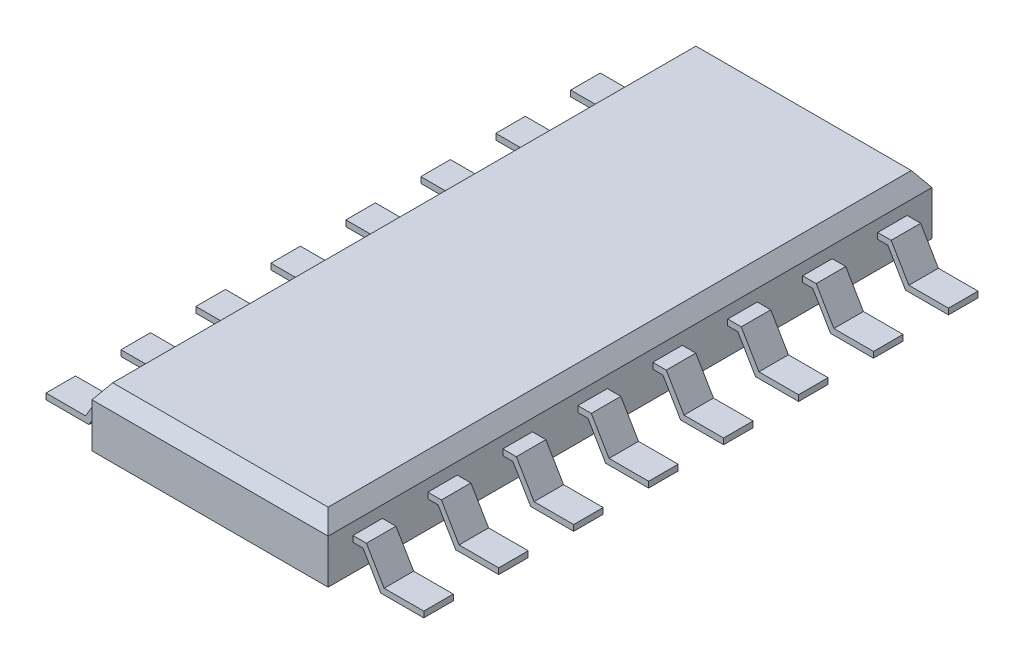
ISO-10303-21;
HEADER;
FILE_DESCRIPTION(('STEP AP214'),'2;1');
FILE_NAME('part.step','',(''),(''),'','','');
FILE_SCHEMA(('AUTOMOTIVE_DESIGN { 1 0 10303 214 1 1 1 1 }'));
ENDSEC;
DATA;
#1=APPLICATION_CONTEXT('core data for automotive mechanical design processes');
#2=APPLICATION_PROTOCOL_DEFINITION('international standard','automotive_design',2000,#1);
#3=PRODUCT_CONTEXT('',#1,'mechanical');
#4=PRODUCT('Part','Part','',(#3));
#5=PRODUCT_RELATED_PRODUCT_CATEGORY('part','',(#4));
#6=PRODUCT_DEFINITION_FORMATION('','',#4);
#7=PRODUCT_DEFINITION_CONTEXT('part definition',#1,'design');
#8=PRODUCT_DEFINITION('design','',#6,#7);
#9=PRODUCT_DEFINITION_SHAPE('','',#8);
#10=(LENGTH_UNIT() NAMED_UNIT(*) SI_UNIT(.MILLI.,.METRE.));
#11=(NAMED_UNIT(*) PLANE_ANGLE_UNIT() SI_UNIT($,.RADIAN.));
#12=(NAMED_UNIT(*) SI_UNIT($,.STERADIAN.) SOLID_ANGLE_UNIT());
#13=UNCERTAINTY_MEASURE_WITH_UNIT(LENGTH_MEASURE(1.E-05),#10,'distance_accuracy_value','');
#14=(GEOMETRIC_REPRESENTATION_CONTEXT(3) GLOBAL_UNCERTAINTY_ASSIGNED_CONTEXT((#13)) GLOBAL_UNIT_ASSIGNED_CONTEXT((#10,
#11,#12)) REPRESENTATION_CONTEXT('',''));
#15=CARTESIAN_POINT('',(0.,0.,0.));
#16=DIRECTION('',(0.,0.,1.));
#17=DIRECTION('',(1.,0.,0.));
#18=AXIS2_PLACEMENT_3D('',#15,#16,#17);
#19=CARTESIAN_POINT('',(2.,0.5,-5.75));
#20=DIRECTION('',(-1.,0.,0.));
#21=DIRECTION('',(0.,0.,1.));
#22=AXIS2_PLACEMENT_3D('',#19,#20,#21);
#23=PLANE('',#22);
#24=DIRECTION('',(0.,-1.,0.));
#25=VECTOR('',#24,1.);
#26=CARTESIAN_POINT('',(2.,0.0499999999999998,-3.56));
#27=LINE('',#26,#25);
#28=CARTESIAN_POINT('',(2.,0.0499999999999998,-3.56));
#29=VERTEX_POINT('',#28);
#30=CARTESIAN_POINT('',(2.,-0.0500000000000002,-3.56));
#31=VERTEX_POINT('',#30);
#32=EDGE_CURVE('E1870',#29,#31,#27,.T.);
#33=ORIENTED_EDGE('',*,*,#32,.F.);
#34=DIRECTION('',(0.,0.,-1.));
#35=VECTOR('',#34,1.);
#36=CARTESIAN_POINT('',(2.,0.0499999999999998,-3.56));
#37=LINE('',#36,#35);
#38=CARTESIAN_POINT('',(2.,0.0499999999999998,-4.06));
#39=VERTEX_POINT('',#38);
#40=EDGE_CURVE('E1913',#29,#39,#37,.T.);
#41=ORIENTED_EDGE('',*,*,#40,.T.);
#42=DIRECTION('',(0.,-1.,0.));
#43=VECTOR('',#42,1.);
#44=CARTESIAN_POINT('',(2.,0.0499999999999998,-4.06));
#45=LINE('',#44,#43);
#46=CARTESIAN_POINT('',(2.,-0.0500000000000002,-4.06));
#47=VERTEX_POINT('',#46);
#48=EDGE_CURVE('E1889',#39,#47,#45,.T.);
#49=ORIENTED_EDGE('',*,*,#48,.T.);
#50=DIRECTION('',(0.,0.,-1.));
#51=VECTOR('',#50,1.);
#52=CARTESIAN_POINT('',(2.,-0.0500000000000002,-3.56));
#53=LINE('',#52,#51);
#54=EDGE_CURVE('E1910',#31,#47,#53,.T.);
#55=ORIENTED_EDGE('',*,*,#54,.F.);
#56=EDGE_LOOP('',(#33,#41,#49,#55));
#57=FACE_BOUND('',#56,.T.);
#58=DIRECTION('',(0.,-1.,0.));
#59=VECTOR('',#58,1.);
#60=CARTESIAN_POINT('',(2.,0.0499999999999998,-1.02));
#61=LINE('',#60,#59);
#62=CARTESIAN_POINT('',(2.,0.0499999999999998,-1.02));
#63=VERTEX_POINT('',#62);
#64=CARTESIAN_POINT('',(2.,-0.0500000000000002,-1.02));
#65=VERTEX_POINT('',#64);
#66=EDGE_CURVE('E216',#63,#65,#61,.T.);
#67=ORIENTED_EDGE('',*,*,#66,.F.);
#68=DIRECTION('',(0.,0.,-1.));
#69=VECTOR('',#68,1.);
#70=CARTESIAN_POINT('',(2.,0.0499999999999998,-1.02));
#71=LINE('',#70,#69);
#72=CARTESIAN_POINT('',(2.,0.0499999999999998,-1.52));
#73=VERTEX_POINT('',#72);
#74=EDGE_CURVE('E268',#63,#73,#71,.T.);
#75=ORIENTED_EDGE('',*,*,#74,.T.);
#76=DIRECTION('',(0.,-1.,0.));
#77=VECTOR('',#76,1.);
#78=CARTESIAN_POINT('',(2.,0.0499999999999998,-1.52));
#79=LINE('',#78,#77);
#80=CARTESIAN_POINT('',(2.,-0.0500000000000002,-1.52));
#81=VERTEX_POINT('',#80);
#82=EDGE_CURVE('E240',#73,#81,#79,.T.);
#83=ORIENTED_EDGE('',*,*,#82,.T.);
#84=DIRECTION('',(0.,0.,-1.));
#85=VECTOR('',#84,1.);
#86=CARTESIAN_POINT('',(2.,-0.0500000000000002,-1.02));
#87=LINE('',#86,#85);
#88=EDGE_CURVE('E265',#65,#81,#87,.T.);
#89=ORIENTED_EDGE('',*,*,#88,.F.);
#90=EDGE_LOOP('',(#67,#75,#83,#89));
#91=FACE_BOUND('',#90,.T.);
#92=DIRECTION('',(0.,-1.,0.));
#93=VECTOR('',#92,1.);
#94=CARTESIAN_POINT('',(1.99999999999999,0.0499999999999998,2.79));
#95=LINE('',#94,#93);
#96=CARTESIAN_POINT('',(1.99999999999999,0.0499999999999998,2.79));
#97=VERTEX_POINT('',#96);
#98=CARTESIAN_POINT('',(1.99999999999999,-0.0500000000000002,2.79));
#99=VERTEX_POINT('',#98);
#100=EDGE_CURVE('E360',#97,#99,#95,.T.);
#101=ORIENTED_EDGE('',*,*,#100,.F.);
#102=DIRECTION('',(0.,0.,-1.));
#103=VECTOR('',#102,1.);
#104=CARTESIAN_POINT('',(1.99999999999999,0.0499999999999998,2.79));
#105=LINE('',#104,#103);
#106=CARTESIAN_POINT('',(1.99999999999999,0.0499999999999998,2.29));
#107=VERTEX_POINT('',#106);
#108=EDGE_CURVE('E412',#97,#107,#105,.T.);
#109=ORIENTED_EDGE('',*,*,#108,.T.);
#110=DIRECTION('',(0.,-1.,0.));
#111=VECTOR('',#110,1.);
#112=CARTESIAN_POINT('',(1.99999999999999,0.0499999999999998,2.29));
#113=LINE('',#112,#111);
#114=CARTESIAN_POINT('',(2.,-0.0500000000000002,2.29));
#115=VERTEX_POINT('',#114);
#116=EDGE_CURVE('E384',#107,#115,#113,.T.);
#117=ORIENTED_EDGE('',*,*,#116,.T.);
#118=DIRECTION('',(0.,0.,-1.));
#119=VECTOR('',#118,1.);
#120=CARTESIAN_POINT('',(1.99999999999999,-0.0500000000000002,2.79));
#121=LINE('',#120,#119);
#122=EDGE_CURVE('E409',#99,#115,#121,.T.);
#123=ORIENTED_EDGE('',*,*,#122,.F.);
#124=EDGE_LOOP('',(#101,#109,#117,#123));
#125=FACE_BOUND('',#124,.T.);
#126=DIRECTION('',(0.,-1.,0.));
#127=VECTOR('',#126,1.);
#128=CARTESIAN_POINT('',(1.99999999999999,0.0499999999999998,0.25));
#129=LINE('',#128,#127);
#130=CARTESIAN_POINT('',(1.99999999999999,0.0499999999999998,0.25));
#131=VERTEX_POINT('',#130);
#132=CARTESIAN_POINT('',(1.99999999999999,-0.0500000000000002,0.25));
#133=VERTEX_POINT('',#132);
#134=EDGE_CURVE('E504',#131,#133,#129,.T.);
#135=ORIENTED_EDGE('',*,*,#134,.F.);
#136=DIRECTION('',(0.,0.,-1.));
#137=VECTOR('',#136,1.);
#138=CARTESIAN_POINT('',(1.99999999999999,0.0499999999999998,0.25));
#139=LINE('',#138,#137);
#140=CARTESIAN_POINT('',(1.99999999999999,0.0499999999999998,-0.25));
#141=VERTEX_POINT('',#140);
#142=EDGE_CURVE('E556',#131,#141,#139,.T.);
#143=ORIENTED_EDGE('',*,*,#142,.T.);
#144=DIRECTION('',(0.,-1.,0.));
#145=VECTOR('',#144,1.);
#146=CARTESIAN_POINT('',(1.99999999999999,0.0499999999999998,-0.25));
#147=LINE('',#146,#145);
#148=CARTESIAN_POINT('',(2.,-0.0500000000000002,-0.25));
#149=VERTEX_POINT('',#148);
#150=EDGE_CURVE('E528',#141,#149,#147,.T.);
#151=ORIENTED_EDGE('',*,*,#150,.T.);
#152=DIRECTION('',(0.,0.,-1.));
#153=VECTOR('',#152,1.);
#154=CARTESIAN_POINT('',(1.99999999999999,-0.0500000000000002,0.25));
#155=LINE('',#154,#153);
#156=EDGE_CURVE('E553',#133,#149,#155,.T.);
#157=ORIENTED_EDGE('',*,*,#156,.F.);
#158=EDGE_LOOP('',(#135,#143,#151,#157));
#159=FACE_BOUND('',#158,.T.);
#160=DIRECTION('',(0.,-1.,0.));
#161=VECTOR('',#160,1.);
#162=CARTESIAN_POINT('',(2.,0.5,-5.75));
#163=LINE('',#162,#161);
#164=CARTESIAN_POINT('',(2.,0.25,-5.75));
#165=VERTEX_POINT('',#164);
#166=CARTESIAN_POINT('',(2.,-0.5,-5.75));
#167=VERTEX_POINT('',#166);
#168=EDGE_CURVE('E1155',#165,#167,#163,.T.);
#169=ORIENTED_EDGE('',*,*,#168,.F.);
#170=DIRECTION('',(0.,0.,1.));
#171=VECTOR('',#170,1.);
#172=CARTESIAN_POINT('',(2.,0.25,5.75));
#173=LINE('',#172,#171);
#174=CARTESIAN_POINT('',(2.,0.249999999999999,4.48));
#175=VERTEX_POINT('',#174);
#176=EDGE_CURVE('E1168',#165,#175,#173,.T.);
#177=ORIENTED_EDGE('',*,*,#176,.T.);
#178=DIRECTION('',(0.,-1.,0.));
#179=VECTOR('',#178,1.);
#180=CARTESIAN_POINT('',(2.,0.5,4.48));
#181=LINE('',#180,#179);
#182=CARTESIAN_POINT('',(2.,-0.5,4.48));
#183=VERTEX_POINT('',#182);
#184=EDGE_CURVE('E1158',#175,#183,#181,.T.);
#185=ORIENTED_EDGE('',*,*,#184,.T.);
#186=DIRECTION('',(0.,0.,-1.));
#187=VECTOR('',#186,1.);
#188=CARTESIAN_POINT('',(2.,-0.5,-5.75));
#189=LINE('',#188,#187);
#190=EDGE_CURVE('E1146',#183,#167,#189,.T.);
#191=ORIENTED_EDGE('',*,*,#190,.T.);
#192=EDGE_LOOP('',(#169,#177,#185,#191));
#193=FACE_BOUND('',#192,.T.);
#194=DIRECTION('',(0.,-1.,0.));
#195=VECTOR('',#194,1.);
#196=CARTESIAN_POINT('',(1.99999999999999,0.0499999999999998,1.52));
#197=LINE('',#196,#195);
#198=CARTESIAN_POINT('',(1.99999999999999,0.0499999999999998,1.52));
#199=VERTEX_POINT('',#198);
#200=CARTESIAN_POINT('',(1.99999999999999,-0.0500000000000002,1.52));
#201=VERTEX_POINT('',#200);
#202=EDGE_CURVE('E432',#199,#201,#197,.T.);
#203=ORIENTED_EDGE('',*,*,#202,.F.);
#204=DIRECTION('',(0.,0.,-1.));
#205=VECTOR('',#204,1.);
#206=CARTESIAN_POINT('',(1.99999999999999,0.0499999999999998,1.52));
#207=LINE('',#206,#205);
#208=CARTESIAN_POINT('',(1.99999999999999,0.0499999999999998,1.02));
#209=VERTEX_POINT('',#208);
#210=EDGE_CURVE('E484',#199,#209,#207,.T.);
#211=ORIENTED_EDGE('',*,*,#210,.T.);
#212=DIRECTION('',(0.,-1.,0.));
#213=VECTOR('',#212,1.);
#214=CARTESIAN_POINT('',(1.99999999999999,0.0499999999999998,1.02));
#215=LINE('',#214,#213);
#216=CARTESIAN_POINT('',(2.,-0.0500000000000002,1.02));
#217=VERTEX_POINT('',#216);
#218=EDGE_CURVE('E456',#209,#217,#215,.T.);
#219=ORIENTED_EDGE('',*,*,#218,.T.);
#220=DIRECTION('',(0.,0.,-1.));
#221=VECTOR('',#220,1.);
#222=CARTESIAN_POINT('',(1.99999999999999,-0.0500000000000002,1.52));
#223=LINE('',#222,#221);
#224=EDGE_CURVE('E481',#201,#217,#223,.T.);
#225=ORIENTED_EDGE('',*,*,#224,.F.);
#226=EDGE_LOOP('',(#203,#211,#219,#225));
#227=FACE_BOUND('',#226,.T.);
#228=DIRECTION('',(0.,-1.,0.));
#229=VECTOR('',#228,1.);
#230=CARTESIAN_POINT('',(1.99999999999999,0.0499999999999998,4.06));
#231=LINE('',#230,#229);
#232=CARTESIAN_POINT('',(1.99999999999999,0.0499999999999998,4.06));
#233=VERTEX_POINT('',#232);
#234=CARTESIAN_POINT('',(1.99999999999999,-0.0500000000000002,4.06));
#235=VERTEX_POINT('',#234);
#236=EDGE_CURVE('E288',#233,#235,#231,.T.);
#237=ORIENTED_EDGE('',*,*,#236,.F.);
#238=DIRECTION('',(0.,0.,-1.));
#239=VECTOR('',#238,1.);
#240=CARTESIAN_POINT('',(1.99999999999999,0.0499999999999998,4.06));
#241=LINE('',#240,#239);
#242=CARTESIAN_POINT('',(1.99999999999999,0.0499999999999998,3.56));
#243=VERTEX_POINT('',#242);
#244=EDGE_CURVE('E340',#233,#243,#241,.T.);
#245=ORIENTED_EDGE('',*,*,#244,.T.);
#246=DIRECTION('',(0.,-1.,0.));
#247=VECTOR('',#246,1.);
#248=CARTESIAN_POINT('',(1.99999999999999,0.0499999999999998,3.56));
#249=LINE('',#248,#247);
#250=CARTESIAN_POINT('',(2.,-0.0500000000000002,3.56));
#251=VERTEX_POINT('',#250);
#252=EDGE_CURVE('E312',#243,#251,#249,.T.);
#253=ORIENTED_EDGE('',*,*,#252,.T.);
#254=DIRECTION('',(0.,0.,-1.));
#255=VECTOR('',#254,1.);
#256=CARTESIAN_POINT('',(1.99999999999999,-0.0500000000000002,4.06));
#257=LINE('',#256,#255);
#258=EDGE_CURVE('E337',#235,#251,#257,.T.);
#259=ORIENTED_EDGE('',*,*,#258,.F.);
#260=EDGE_LOOP('',(#237,#245,#253,#259));
#261=FACE_BOUND('',#260,.T.);
#262=DIRECTION('',(0.,-1.,0.));
#263=VECTOR('',#262,1.);
#264=CARTESIAN_POINT('',(2.,0.0499999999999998,-2.29));
#265=LINE('',#264,#263);
#266=CARTESIAN_POINT('',(2.,0.0499999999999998,-2.29));
#267=VERTEX_POINT('',#266);
#268=CARTESIAN_POINT('',(2.,-0.0500000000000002,-2.29));
#269=VERTEX_POINT('',#268);
#270=EDGE_CURVE('E1929',#267,#269,#265,.T.);
#271=ORIENTED_EDGE('',*,*,#270,.F.);
#272=DIRECTION('',(0.,0.,-1.));
#273=VECTOR('',#272,1.);
#274=CARTESIAN_POINT('',(2.,0.0499999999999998,-2.29));
#275=LINE('',#274,#273);
#276=CARTESIAN_POINT('',(2.,0.0499999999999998,-2.79));
#277=VERTEX_POINT('',#276);
#278=EDGE_CURVE('E167',#267,#277,#275,.T.);
#279=ORIENTED_EDGE('',*,*,#278,.T.);
#280=DIRECTION('',(0.,-1.,0.));
#281=VECTOR('',#280,1.);
#282=CARTESIAN_POINT('',(2.,0.0499999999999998,-2.79));
#283=LINE('',#282,#281);
#284=CARTESIAN_POINT('',(2.,-0.0500000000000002,-2.79));
#285=VERTEX_POINT('',#284);
#286=EDGE_CURVE('E148',#277,#285,#283,.T.);
#287=ORIENTED_EDGE('',*,*,#286,.T.);
#288=DIRECTION('',(0.,0.,-1.));
#289=VECTOR('',#288,1.);
#290=CARTESIAN_POINT('',(2.,-0.0500000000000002,-2.29));
#291=LINE('',#290,#289);
#292=EDGE_CURVE('E160',#269,#285,#291,.T.);
#293=ORIENTED_EDGE('',*,*,#292,.F.);
#294=EDGE_LOOP('',(#271,#279,#287,#293));
#295=FACE_BOUND('',#294,.T.);
#296=DIRECTION('',(0.,-1.,0.));
#297=VECTOR('',#296,1.);
#298=CARTESIAN_POINT('',(2.,0.0499999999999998,-4.83));
#299=LINE('',#298,#297);
#300=CARTESIAN_POINT('',(2.,0.0499999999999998,-4.83));
#301=VERTEX_POINT('',#300);
#302=CARTESIAN_POINT('',(2.,-0.0500000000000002,-4.83));
#303=VERTEX_POINT('',#302);
#304=EDGE_CURVE('E1816',#301,#303,#299,.T.);
#305=ORIENTED_EDGE('',*,*,#304,.F.);
#306=DIRECTION('',(0.,0.,-1.));
#307=VECTOR('',#306,1.);
#308=CARTESIAN_POINT('',(2.,0.0499999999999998,-4.83));
#309=LINE('',#308,#307);
#310=CARTESIAN_POINT('',(2.,0.0499999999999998,-5.33));
#311=VERTEX_POINT('',#310);
#312=EDGE_CURVE('E1856',#301,#311,#309,.T.);
#313=ORIENTED_EDGE('',*,*,#312,.T.);
#314=DIRECTION('',(0.,-1.,0.));
#315=VECTOR('',#314,1.);
#316=CARTESIAN_POINT('',(2.,0.0499999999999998,-5.33));
#317=LINE('',#316,#315);
#318=CARTESIAN_POINT('',(2.,-0.0500000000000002,-5.33));
#319=VERTEX_POINT('',#318);
#320=EDGE_CURVE('E1834',#311,#319,#317,.T.);
#321=ORIENTED_EDGE('',*,*,#320,.T.);
#322=DIRECTION('',(0.,0.,-1.));
#323=VECTOR('',#322,1.);
#324=CARTESIAN_POINT('',(2.,-0.0500000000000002,-4.83));
#325=LINE('',#324,#323);
#326=EDGE_CURVE('E1854',#303,#319,#325,.T.);
#327=ORIENTED_EDGE('',*,*,#326,.F.);
#328=EDGE_LOOP('',(#305,#313,#321,#327));
#329=FACE_BOUND('',#328,.T.);
#330=ADVANCED_FACE('F37',(#57,#91,#125,#159,#193,#227,#261,#295,#329),#23,.F.);
#331=CARTESIAN_POINT('',(-2.,0.5,-5.75));
#332=DIRECTION('',(1.,0.,0.));
#333=DIRECTION('',(0.,0.,-1.));
#334=AXIS2_PLACEMENT_3D('',#331,#332,#333);
#335=PLANE('',#334);
#336=DIRECTION('',(0.,-1.,0.));
#337=VECTOR('',#336,1.);
#338=CARTESIAN_POINT('',(-2.,0.0499999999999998,-3.56));
#339=LINE('',#338,#337);
#340=CARTESIAN_POINT('',(-2.,0.0499999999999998,-3.56));
#341=VERTEX_POINT('',#340);
#342=CARTESIAN_POINT('',(-2.,-0.0500000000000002,-3.56));
#343=VERTEX_POINT('',#342);
#344=EDGE_CURVE('E654',#341,#343,#339,.T.);
#345=ORIENTED_EDGE('',*,*,#344,.T.);
#346=DIRECTION('',(0.,0.,-1.));
#347=VECTOR('',#346,1.);
#348=CARTESIAN_POINT('',(-2.,-0.0500000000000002,-3.56));
#349=LINE('',#348,#347);
#350=CARTESIAN_POINT('',(-2.,-0.0500000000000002,-4.06));
#351=VERTEX_POINT('',#350);
#352=EDGE_CURVE('E694',#343,#351,#349,.T.);
#353=ORIENTED_EDGE('',*,*,#352,.T.);
#354=DIRECTION('',(0.,-1.,0.));
#355=VECTOR('',#354,1.);
#356=CARTESIAN_POINT('',(-2.,0.0499999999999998,-4.06));
#357=LINE('',#356,#355);
#358=CARTESIAN_POINT('',(-2.,0.0499999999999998,-4.06));
#359=VERTEX_POINT('',#358);
#360=EDGE_CURVE('E678',#359,#351,#357,.T.);
#361=ORIENTED_EDGE('',*,*,#360,.F.);
#362=DIRECTION('',(0.,0.,-1.));
#363=VECTOR('',#362,1.);
#364=CARTESIAN_POINT('',(-2.,0.0499999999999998,-3.56));
#365=LINE('',#364,#363);
#366=EDGE_CURVE('E691',#341,#359,#365,.T.);
#367=ORIENTED_EDGE('',*,*,#366,.F.);
#368=EDGE_LOOP('',(#345,#353,#361,#367));
#369=FACE_BOUND('',#368,.T.);
#370=DIRECTION('',(0.,-1.,0.));
#371=VECTOR('',#370,1.);
#372=CARTESIAN_POINT('',(-2.,0.0499999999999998,-1.02));
#373=LINE('',#372,#371);
#374=CARTESIAN_POINT('',(-2.,0.0499999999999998,-1.02));
#375=VERTEX_POINT('',#374);
#376=CARTESIAN_POINT('',(-2.,-0.0500000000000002,-1.02));
#377=VERTEX_POINT('',#376);
#378=EDGE_CURVE('E798',#375,#377,#373,.T.);
#379=ORIENTED_EDGE('',*,*,#378,.T.);
#380=DIRECTION('',(0.,0.,-1.));
#381=VECTOR('',#380,1.);
#382=CARTESIAN_POINT('',(-2.,-0.0500000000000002,-1.02));
#383=LINE('',#382,#381);
#384=CARTESIAN_POINT('',(-2.,-0.0500000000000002,-1.52));
#385=VERTEX_POINT('',#384);
#386=EDGE_CURVE('E838',#377,#385,#383,.T.);
#387=ORIENTED_EDGE('',*,*,#386,.T.);
#388=DIRECTION('',(0.,-1.,0.));
#389=VECTOR('',#388,1.);
#390=CARTESIAN_POINT('',(-2.,0.0499999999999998,-1.52));
#391=LINE('',#390,#389);
#392=CARTESIAN_POINT('',(-2.,0.0499999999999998,-1.52));
#393=VERTEX_POINT('',#392);
#394=EDGE_CURVE('E822',#393,#385,#391,.T.);
#395=ORIENTED_EDGE('',*,*,#394,.F.);
#396=DIRECTION('',(0.,0.,-1.));
#397=VECTOR('',#396,1.);
#398=CARTESIAN_POINT('',(-2.,0.0499999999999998,-1.02));
#399=LINE('',#398,#397);
#400=EDGE_CURVE('E835',#375,#393,#399,.T.);
#401=ORIENTED_EDGE('',*,*,#400,.F.);
#402=EDGE_LOOP('',(#379,#387,#395,#401));
#403=FACE_BOUND('',#402,.T.);
#404=DIRECTION('',(0.,-1.,0.));
#405=VECTOR('',#404,1.);
#406=CARTESIAN_POINT('',(-1.99999999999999,0.0499999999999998,2.79));
#407=LINE('',#406,#405);
#408=CARTESIAN_POINT('',(-1.99999999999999,0.0499999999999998,2.79));
#409=VERTEX_POINT('',#408);
#410=CARTESIAN_POINT('',(-1.99999999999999,-0.0500000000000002,2.79));
#411=VERTEX_POINT('',#410);
#412=EDGE_CURVE('E942',#409,#411,#407,.T.);
#413=ORIENTED_EDGE('',*,*,#412,.T.);
#414=DIRECTION('',(0.,0.,-1.));
#415=VECTOR('',#414,1.);
#416=CARTESIAN_POINT('',(-1.99999999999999,-0.0500000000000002,2.79));
#417=LINE('',#416,#415);
#418=CARTESIAN_POINT('',(-1.99999999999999,-0.0500000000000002,2.29));
#419=VERTEX_POINT('',#418);
#420=EDGE_CURVE('E982',#411,#419,#417,.T.);
#421=ORIENTED_EDGE('',*,*,#420,.T.);
#422=DIRECTION('',(0.,-1.,0.));
#423=VECTOR('',#422,1.);
#424=CARTESIAN_POINT('',(-1.99999999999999,0.0499999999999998,2.29));
#425=LINE('',#424,#423);
#426=CARTESIAN_POINT('',(-2.,0.0499999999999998,2.29));
#427=VERTEX_POINT('',#426);
#428=EDGE_CURVE('E966',#427,#419,#425,.T.);
#429=ORIENTED_EDGE('',*,*,#428,.F.);
#430=DIRECTION('',(0.,0.,-1.));
#431=VECTOR('',#430,1.);
#432=CARTESIAN_POINT('',(-1.99999999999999,0.0499999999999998,2.79));
#433=LINE('',#432,#431);
#434=EDGE_CURVE('E979',#409,#427,#433,.T.);
#435=ORIENTED_EDGE('',*,*,#434,.F.);
#436=EDGE_LOOP('',(#413,#421,#429,#435));
#437=FACE_BOUND('',#436,.T.);
#438=DIRECTION('',(0.,-1.,0.));
#439=VECTOR('',#438,1.);
#440=CARTESIAN_POINT('',(-1.99999999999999,0.0499999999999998,0.25));
#441=LINE('',#440,#439);
#442=CARTESIAN_POINT('',(-1.99999999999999,0.0499999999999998,0.25));
#443=VERTEX_POINT('',#442);
#444=CARTESIAN_POINT('',(-1.99999999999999,-0.0500000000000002,0.25));
#445=VERTEX_POINT('',#444);
#446=EDGE_CURVE('E1086',#443,#445,#441,.T.);
#447=ORIENTED_EDGE('',*,*,#446,.T.);
#448=DIRECTION('',(0.,0.,-1.));
#449=VECTOR('',#448,1.);
#450=CARTESIAN_POINT('',(-1.99999999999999,-0.0500000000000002,0.25));
#451=LINE('',#450,#449);
#452=CARTESIAN_POINT('',(-1.99999999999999,-0.0500000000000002,-0.25));
#453=VERTEX_POINT('',#452);
#454=EDGE_CURVE('E1126',#445,#453,#451,.T.);
#455=ORIENTED_EDGE('',*,*,#454,.T.);
#456=DIRECTION('',(0.,-1.,0.));
#457=VECTOR('',#456,1.);
#458=CARTESIAN_POINT('',(-1.99999999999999,0.0499999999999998,-0.25));
#459=LINE('',#458,#457);
#460=CARTESIAN_POINT('',(-2.,0.0499999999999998,-0.25));
#461=VERTEX_POINT('',#460);
#462=EDGE_CURVE('E1110',#461,#453,#459,.T.);
#463=ORIENTED_EDGE('',*,*,#462,.F.);
#464=DIRECTION('',(0.,0.,-1.));
#465=VECTOR('',#464,1.);
#466=CARTESIAN_POINT('',(-1.99999999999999,0.0499999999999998,0.25));
#467=LINE('',#466,#465);
#468=EDGE_CURVE('E1123',#443,#461,#467,.T.);
#469=ORIENTED_EDGE('',*,*,#468,.F.);
#470=EDGE_LOOP('',(#447,#455,#463,#469));
#471=FACE_BOUND('',#470,.T.);
#472=DIRECTION('',(0.,-1.,0.));
#473=VECTOR('',#472,1.);
#474=CARTESIAN_POINT('',(-2.,0.5,4.48));
#475=LINE('',#474,#473);
#476=CARTESIAN_POINT('',(-2.,0.25,4.48));
#477=VERTEX_POINT('',#476);
#478=CARTESIAN_POINT('',(-2.,-0.5,4.48));
#479=VERTEX_POINT('',#478);
#480=EDGE_CURVE('E1161',#477,#479,#475,.T.);
#481=ORIENTED_EDGE('',*,*,#480,.F.);
#482=DIRECTION('',(0.,0.,-1.));
#483=VECTOR('',#482,1.);
#484=CARTESIAN_POINT('',(-2.,0.25,-5.75));
#485=LINE('',#484,#483);
#486=CARTESIAN_POINT('',(-2.,0.25,-5.75));
#487=VERTEX_POINT('',#486);
#488=EDGE_CURVE('E12',#477,#487,#485,.T.);
#489=ORIENTED_EDGE('',*,*,#488,.T.);
#490=DIRECTION('',(0.,-1.,0.));
#491=VECTOR('',#490,1.);
#492=CARTESIAN_POINT('',(-2.,0.5,-5.75));
#493=LINE('',#492,#491);
#494=CARTESIAN_POINT('',(-2.,-0.5,-5.75));
#495=VERTEX_POINT('',#494);
#496=EDGE_CURVE('E1152',#487,#495,#493,.T.);
#497=ORIENTED_EDGE('',*,*,#496,.T.);
#498=DIRECTION('',(0.,0.,1.));
#499=VECTOR('',#498,1.);
#500=CARTESIAN_POINT('',(-2.,-0.5,-5.75));
#501=LINE('',#500,#499);
#502=EDGE_CURVE('E1142',#495,#479,#501,.T.);
#503=ORIENTED_EDGE('',*,*,#502,.T.);
#504=EDGE_LOOP('',(#481,#489,#497,#503));
#505=FACE_BOUND('',#504,.T.);
#506=DIRECTION('',(0.,-1.,0.));
#507=VECTOR('',#506,1.);
#508=CARTESIAN_POINT('',(-1.99999999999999,0.0499999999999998,1.52));
#509=LINE('',#508,#507);
#510=CARTESIAN_POINT('',(-1.99999999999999,0.0499999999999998,1.52));
#511=VERTEX_POINT('',#510);
#512=CARTESIAN_POINT('',(-1.99999999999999,-0.0500000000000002,1.52));
#513=VERTEX_POINT('',#512);
#514=EDGE_CURVE('E1014',#511,#513,#509,.T.);
#515=ORIENTED_EDGE('',*,*,#514,.T.);
#516=DIRECTION('',(0.,0.,-1.));
#517=VECTOR('',#516,1.);
#518=CARTESIAN_POINT('',(-1.99999999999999,-0.0500000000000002,1.52));
#519=LINE('',#518,#517);
#520=CARTESIAN_POINT('',(-1.99999999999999,-0.0500000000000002,1.02));
#521=VERTEX_POINT('',#520);
#522=EDGE_CURVE('E1054',#513,#521,#519,.T.);
#523=ORIENTED_EDGE('',*,*,#522,.T.);
#524=DIRECTION('',(0.,-1.,0.));
#525=VECTOR('',#524,1.);
#526=CARTESIAN_POINT('',(-1.99999999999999,0.0499999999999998,1.02));
#527=LINE('',#526,#525);
#528=CARTESIAN_POINT('',(-2.,0.0499999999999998,1.02));
#529=VERTEX_POINT('',#528);
#530=EDGE_CURVE('E1038',#529,#521,#527,.T.);
#531=ORIENTED_EDGE('',*,*,#530,.F.);
#532=DIRECTION('',(0.,0.,-1.));
#533=VECTOR('',#532,1.);
#534=CARTESIAN_POINT('',(-1.99999999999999,0.0499999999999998,1.52));
#535=LINE('',#534,#533);
#536=EDGE_CURVE('E1051',#511,#529,#535,.T.);
#537=ORIENTED_EDGE('',*,*,#536,.F.);
#538=EDGE_LOOP('',(#515,#523,#531,#537));
#539=FACE_BOUND('',#538,.T.);
#540=DIRECTION('',(0.,-1.,0.));
#541=VECTOR('',#540,1.);
#542=CARTESIAN_POINT('',(-1.99999999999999,0.0499999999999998,4.06));
#543=LINE('',#542,#541);
#544=CARTESIAN_POINT('',(-1.99999999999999,0.0499999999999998,4.06));
#545=VERTEX_POINT('',#544);
#546=CARTESIAN_POINT('',(-1.99999999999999,-0.0500000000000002,4.06));
#547=VERTEX_POINT('',#546);
#548=EDGE_CURVE('E870',#545,#547,#543,.T.);
#549=ORIENTED_EDGE('',*,*,#548,.T.);
#550=DIRECTION('',(0.,0.,-1.));
#551=VECTOR('',#550,1.);
#552=CARTESIAN_POINT('',(-1.99999999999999,-0.0500000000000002,4.06));
#553=LINE('',#552,#551);
#554=CARTESIAN_POINT('',(-1.99999999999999,-0.0500000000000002,3.56));
#555=VERTEX_POINT('',#554);
#556=EDGE_CURVE('E910',#547,#555,#553,.T.);
#557=ORIENTED_EDGE('',*,*,#556,.T.);
#558=DIRECTION('',(0.,-1.,0.));
#559=VECTOR('',#558,1.);
#560=CARTESIAN_POINT('',(-1.99999999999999,0.0499999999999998,3.56));
#561=LINE('',#560,#559);
#562=CARTESIAN_POINT('',(-2.,0.0499999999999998,3.56));
#563=VERTEX_POINT('',#562);
#564=EDGE_CURVE('E894',#563,#555,#561,.T.);
#565=ORIENTED_EDGE('',*,*,#564,.F.);
#566=DIRECTION('',(0.,0.,-1.));
#567=VECTOR('',#566,1.);
#568=CARTESIAN_POINT('',(-1.99999999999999,0.0499999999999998,4.06));
#569=LINE('',#568,#567);
#570=EDGE_CURVE('E907',#545,#563,#569,.T.);
#571=ORIENTED_EDGE('',*,*,#570,.F.);
#572=EDGE_LOOP('',(#549,#557,#565,#571));
#573=FACE_BOUND('',#572,.T.);
#574=DIRECTION('',(0.,-1.,0.));
#575=VECTOR('',#574,1.);
#576=CARTESIAN_POINT('',(-2.,0.0499999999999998,-2.29));
#577=LINE('',#576,#575);
#578=CARTESIAN_POINT('',(-2.,0.0499999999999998,-2.29));
#579=VERTEX_POINT('',#578);
#580=CARTESIAN_POINT('',(-2.,-0.0500000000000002,-2.29));
#581=VERTEX_POINT('',#580);
#582=EDGE_CURVE('E726',#579,#581,#577,.T.);
#583=ORIENTED_EDGE('',*,*,#582,.T.);
#584=DIRECTION('',(0.,0.,-1.));
#585=VECTOR('',#584,1.);
#586=CARTESIAN_POINT('',(-2.,-0.0500000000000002,-2.29));
#587=LINE('',#586,#585);
#588=CARTESIAN_POINT('',(-2.,-0.0500000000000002,-2.79));
#589=VERTEX_POINT('',#588);
#590=EDGE_CURVE('E766',#581,#589,#587,.T.);
#591=ORIENTED_EDGE('',*,*,#590,.T.);
#592=DIRECTION('',(0.,-1.,0.));
#593=VECTOR('',#592,1.);
#594=CARTESIAN_POINT('',(-2.,0.0499999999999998,-2.79));
#595=LINE('',#594,#593);
#596=CARTESIAN_POINT('',(-2.,0.0499999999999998,-2.79));
#597=VERTEX_POINT('',#596);
#598=EDGE_CURVE('E750',#597,#589,#595,.T.);
#599=ORIENTED_EDGE('',*,*,#598,.F.);
#600=DIRECTION('',(0.,0.,-1.));
#601=VECTOR('',#600,1.);
#602=CARTESIAN_POINT('',(-2.,0.0499999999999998,-2.29));
#603=LINE('',#602,#601);
#604=EDGE_CURVE('E763',#579,#597,#603,.T.);
#605=ORIENTED_EDGE('',*,*,#604,.F.);
#606=EDGE_LOOP('',(#583,#591,#599,#605));
#607=FACE_BOUND('',#606,.T.);
#608=DIRECTION('',(0.,-1.,0.));
#609=VECTOR('',#608,1.);
#610=CARTESIAN_POINT('',(-2.,0.0499999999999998,-4.83));
#611=LINE('',#610,#609);
#612=CARTESIAN_POINT('',(-2.,0.0499999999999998,-4.83));
#613=VERTEX_POINT('',#612);
#614=CARTESIAN_POINT('',(-2.,-0.0500000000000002,-4.83));
#615=VERTEX_POINT('',#614);
#616=EDGE_CURVE('E582',#613,#615,#611,.T.);
#617=ORIENTED_EDGE('',*,*,#616,.T.);
#618=DIRECTION('',(0.,0.,-1.));
#619=VECTOR('',#618,1.);
#620=CARTESIAN_POINT('',(-2.,-0.0500000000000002,-4.83));
#621=LINE('',#620,#619);
#622=CARTESIAN_POINT('',(-2.,-0.0500000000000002,-5.33));
#623=VERTEX_POINT('',#622);
#624=EDGE_CURVE('E622',#615,#623,#621,.T.);
#625=ORIENTED_EDGE('',*,*,#624,.T.);
#626=DIRECTION('',(0.,-1.,0.));
#627=VECTOR('',#626,1.);
#628=CARTESIAN_POINT('',(-2.,0.0499999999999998,-5.33));
#629=LINE('',#628,#627);
#630=CARTESIAN_POINT('',(-2.,0.0499999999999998,-5.33));
#631=VERTEX_POINT('',#630);
#632=EDGE_CURVE('E606',#631,#623,#629,.T.);
#633=ORIENTED_EDGE('',*,*,#632,.F.);
#634=DIRECTION('',(0.,0.,-1.));
#635=VECTOR('',#634,1.);
#636=CARTESIAN_POINT('',(-2.,0.0499999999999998,-4.83));
#637=LINE('',#636,#635);
#638=EDGE_CURVE('E619',#613,#631,#637,.T.);
#639=ORIENTED_EDGE('',*,*,#638,.F.);
#640=EDGE_LOOP('',(#617,#625,#633,#639));
#641=FACE_BOUND('',#640,.T.);
#642=ADVANCED_FACE('F1198',(#369,#403,#437,#471,#505,#539,#573,#607,#641),#335,.F.);
#643=CARTESIAN_POINT('',(-2.,0.5,4.48));
#644=DIRECTION('',(0.,0.,-1.));
#645=DIRECTION('',(-1.,0.,0.));
#646=AXIS2_PLACEMENT_3D('',#643,#644,#645);
#647=PLANE('',#646);
#648=ORIENTED_EDGE('',*,*,#184,.F.);
#649=DIRECTION('',(-1.,0.,0.));
#650=VECTOR('',#649,1.);
#651=CARTESIAN_POINT('',(-2.,0.25,4.48));
#652=LINE('',#651,#650);
#653=EDGE_CURVE('E47',#175,#477,#652,.T.);
#654=ORIENTED_EDGE('',*,*,#653,.T.);
#655=ORIENTED_EDGE('',*,*,#480,.T.);
#656=DIRECTION('',(1.,0.,0.));
#657=VECTOR('',#656,1.);
#658=CARTESIAN_POINT('',(-2.,-0.5,4.48));
#659=LINE('',#658,#657);
#660=EDGE_CURVE('E1145',#479,#183,#659,.T.);
#661=ORIENTED_EDGE('',*,*,#660,.T.);
#662=EDGE_LOOP('',(#648,#654,#655,#661));
#663=FACE_BOUND('',#662,.T.);
#664=ADVANCED_FACE('F1195',(#663),#647,.F.);
#665=CARTESIAN_POINT('',(-2.,0.5,-5.75));
#666=DIRECTION('',(0.,0.,1.));
#667=DIRECTION('',(1.,0.,0.));
#668=AXIS2_PLACEMENT_3D('',#665,#666,#667);
#669=PLANE('',#668);
#670=ORIENTED_EDGE('',*,*,#496,.F.);
#671=DIRECTION('',(1.,0.,0.));
#672=VECTOR('',#671,1.);
#673=CARTESIAN_POINT('',(2.,0.25,-5.75));
#674=LINE('',#673,#672);
#675=EDGE_CURVE('E1165',#487,#165,#674,.T.);
#676=ORIENTED_EDGE('',*,*,#675,.T.);
#677=ORIENTED_EDGE('',*,*,#168,.T.);
#678=DIRECTION('',(-1.,0.,0.));
#679=VECTOR('',#678,1.);
#680=CARTESIAN_POINT('',(-2.,-0.5,-5.75));
#681=LINE('',#680,#679);
#682=EDGE_CURVE('E1149',#167,#495,#681,.T.);
#683=ORIENTED_EDGE('',*,*,#682,.T.);
#684=EDGE_LOOP('',(#670,#676,#677,#683));
#685=FACE_BOUND('',#684,.T.);
#686=ADVANCED_FACE('F1983',(#685),#669,.F.);
#687=CARTESIAN_POINT('',(-2.,0.5,5.75));
#688=DIRECTION('',(0.,1.,0.));
#689=DIRECTION('',(0.,0.,1.));
#690=AXIS2_PLACEMENT_3D('',#687,#688,#689);
#691=PLANE('',#690);
#692=DIRECTION('',(0.,0.,-1.));
#693=VECTOR('',#692,1.);
#694=CARTESIAN_POINT('',(1.82494811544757,0.5,-5.75));
#695=LINE('',#694,#693);
#696=CARTESIAN_POINT('',(1.82494811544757,0.5,4.30494811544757));
#697=VERTEX_POINT('',#696);
#698=CARTESIAN_POINT('',(1.82494811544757,0.5,-5.57494811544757));
#699=VERTEX_POINT('',#698);
#700=EDGE_CURVE('E90',#697,#699,#695,.T.);
#701=ORIENTED_EDGE('',*,*,#700,.T.);
#702=DIRECTION('',(-1.,0.,0.));
#703=VECTOR('',#702,1.);
#704=CARTESIAN_POINT('',(-2.,0.5,-5.57494811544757));
#705=LINE('',#704,#703);
#706=CARTESIAN_POINT('',(-1.82494811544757,0.5,-5.57494811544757));
#707=VERTEX_POINT('',#706);
#708=EDGE_CURVE('E1163',#699,#707,#705,.T.);
#709=ORIENTED_EDGE('',*,*,#708,.T.);
#710=DIRECTION('',(0.,0.,1.));
#711=VECTOR('',#710,1.);
#712=CARTESIAN_POINT('',(-1.82494811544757,0.5,5.75));
#713=LINE('',#712,#711);
#714=CARTESIAN_POINT('',(-1.82494811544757,0.5,4.30494811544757));
#715=VERTEX_POINT('',#714);
#716=EDGE_CURVE('E1159',#707,#715,#713,.T.);
#717=ORIENTED_EDGE('',*,*,#716,.T.);
#718=DIRECTION('',(1.,0.,0.));
#719=VECTOR('',#718,1.);
#720=CARTESIAN_POINT('',(2.,0.5,4.30494811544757));
#721=LINE('',#720,#719);
#722=EDGE_CURVE('E84',#715,#697,#721,.T.);
#723=ORIENTED_EDGE('',*,*,#722,.T.);
#724=EDGE_LOOP('',(#701,#709,#717,#723));
#725=FACE_BOUND('',#724,.T.);
#726=ADVANCED_FACE('F1999',(#725),#691,.T.);
#727=CARTESIAN_POINT('',(-2.,-0.5,5.75));
#728=DIRECTION('',(0.,1.,0.));
#729=DIRECTION('',(0.,0.,1.));
#730=AXIS2_PLACEMENT_3D('',#727,#728,#729);
#731=PLANE('',#730);
#732=ORIENTED_EDGE('',*,*,#502,.F.);
#733=ORIENTED_EDGE('',*,*,#682,.F.);
#734=ORIENTED_EDGE('',*,*,#190,.F.);
#735=ORIENTED_EDGE('',*,*,#660,.F.);
#736=EDGE_LOOP('',(#732,#733,#734,#735));
#737=FACE_BOUND('',#736,.T.);
#738=ADVANCED_FACE('F1205',(#737),#731,.F.);
#739=CARTESIAN_POINT('',(-2.,0.5,4.30494811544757));
#740=DIRECTION('',(0.,0.573576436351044,0.819152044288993));
#741=DIRECTION('',(0.,-0.819152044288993,0.573576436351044));
#742=AXIS2_PLACEMENT_3D('',#739,#740,#741);
#743=PLANE('',#742);
#744=DIRECTION('',(0.497542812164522,0.710564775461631,-0.497542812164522));
#745=VECTOR('',#744,1.);
#746=CARTESIAN_POINT('',(-1.86828200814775,0.438112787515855,4.34828200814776));
#747=LINE('',#746,#745);
#748=EDGE_CURVE('E1172',#477,#715,#747,.T.);
#749=ORIENTED_EDGE('',*,*,#748,.F.);
#750=ORIENTED_EDGE('',*,*,#653,.F.);
#751=DIRECTION('',(-0.497542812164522,0.710564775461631,-0.497542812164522));
#752=VECTOR('',#751,1.);
#753=CARTESIAN_POINT('',(0.878086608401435,1.85225837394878,3.35808660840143));
#754=LINE('',#753,#752);
#755=EDGE_CURVE('E41',#697,#175,#754,.F.);
#756=ORIENTED_EDGE('',*,*,#755,.F.);
#757=ORIENTED_EDGE('',*,*,#722,.F.);
#758=EDGE_LOOP('',(#749,#750,#756,#757));
#759=FACE_BOUND('',#758,.T.);
#760=ADVANCED_FACE('F39',(#759),#743,.T.);
#761=CARTESIAN_POINT('',(1.82494811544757,0.5,5.75));
#762=DIRECTION('',(0.819152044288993,0.573576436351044,0.));
#763=DIRECTION('',(-0.573576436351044,0.819152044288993,0.));
#764=AXIS2_PLACEMENT_3D('',#761,#762,#763);
#765=PLANE('',#764);
#766=ORIENTED_EDGE('',*,*,#755,.T.);
#767=ORIENTED_EDGE('',*,*,#176,.F.);
#768=DIRECTION('',(-0.497542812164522,0.710564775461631,0.497542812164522));
#769=VECTOR('',#768,1.);
#770=CARTESIAN_POINT('',(-0.978529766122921,4.50378134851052,-2.77147023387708));
#771=LINE('',#770,#769);
#772=EDGE_CURVE('E1171',#699,#165,#771,.F.);
#773=ORIENTED_EDGE('',*,*,#772,.F.);
#774=ORIENTED_EDGE('',*,*,#700,.F.);
#775=EDGE_LOOP('',(#766,#767,#773,#774));
#776=FACE_BOUND('',#775,.T.);
#777=ADVANCED_FACE('F1189',(#776),#765,.T.);
#778=CARTESIAN_POINT('',(-1.82494811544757,0.5,5.75));
#779=DIRECTION('',(-0.819152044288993,0.573576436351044,0.));
#780=DIRECTION('',(-0.573576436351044,-0.819152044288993,0.));
#781=AXIS2_PLACEMENT_3D('',#778,#779,#780);
#782=PLANE('',#781);
#783=ORIENTED_EDGE('',*,*,#748,.T.);
#784=ORIENTED_EDGE('',*,*,#716,.F.);
#785=DIRECTION('',(-0.497542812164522,-0.710564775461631,-0.497542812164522));
#786=VECTOR('',#785,1.);
#787=CARTESIAN_POINT('',(0.97852976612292,4.50378134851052,-2.77147023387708));
#788=LINE('',#787,#786);
#789=EDGE_CURVE('E1141',#487,#707,#788,.F.);
#790=ORIENTED_EDGE('',*,*,#789,.F.);
#791=ORIENTED_EDGE('',*,*,#488,.F.);
#792=EDGE_LOOP('',(#783,#784,#790,#791));
#793=FACE_BOUND('',#792,.T.);
#794=ADVANCED_FACE('F1990',(#793),#782,.T.);
#795=CARTESIAN_POINT('',(-2.,0.5,-5.57494811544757));
#796=DIRECTION('',(0.,0.573576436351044,-0.819152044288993));
#797=DIRECTION('',(0.,0.819152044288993,0.573576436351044));
#798=AXIS2_PLACEMENT_3D('',#795,#796,#797);
#799=PLANE('',#798);
#800=ORIENTED_EDGE('',*,*,#772,.T.);
#801=ORIENTED_EDGE('',*,*,#675,.F.);
#802=ORIENTED_EDGE('',*,*,#789,.T.);
#803=ORIENTED_EDGE('',*,*,#708,.F.);
#804=EDGE_LOOP('',(#800,#801,#802,#803));
#805=FACE_BOUND('',#804,.T.);
#806=ADVANCED_FACE('F1986',(#805),#799,.T.);
#807=CARTESIAN_POINT('',(-2.49999999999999,-0.459999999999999,0.25));
#808=DIRECTION('',(0.,-1.,0.));
#809=DIRECTION('',(1.,0.,0.));
#810=AXIS2_PLACEMENT_3D('',#807,#808,#809);
#811=PLANE('',#810);
#812=DIRECTION('',(-1.,0.,0.));
#813=VECTOR('',#812,1.);
#814=CARTESIAN_POINT('',(-2.49999999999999,-0.459999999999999,-0.25));
#815=LINE('',#814,#813);
#816=CARTESIAN_POINT('',(-2.52859730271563,-0.459999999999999,-0.25));
#817=VERTEX_POINT('',#816);
#818=CARTESIAN_POINT('',(-3.19999999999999,-0.459999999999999,-0.25));
#819=VERTEX_POINT('',#818);
#820=EDGE_CURVE('E1069',#817,#819,#815,.T.);
#821=ORIENTED_EDGE('',*,*,#820,.T.);
#822=DIRECTION('',(0.,0.,-1.));
#823=VECTOR('',#822,1.);
#824=CARTESIAN_POINT('',(-3.19999999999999,-0.459999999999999,0.25));
#825=LINE('',#824,#823);
#826=CARTESIAN_POINT('',(-3.19999999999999,-0.459999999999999,0.25));
#827=VERTEX_POINT('',#826);
#828=EDGE_CURVE('E1138',#827,#819,#825,.T.);
#829=ORIENTED_EDGE('',*,*,#828,.F.);
#830=DIRECTION('',(-1.,0.,0.));
#831=VECTOR('',#830,1.);
#832=CARTESIAN_POINT('',(-2.49999999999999,-0.459999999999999,0.25));
#833=LINE('',#832,#831);
#834=CARTESIAN_POINT('',(-2.52859730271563,-0.459999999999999,0.25));
#835=VERTEX_POINT('',#834);
#836=EDGE_CURVE('E1070',#835,#827,#833,.T.);
#837=ORIENTED_EDGE('',*,*,#836,.F.);
#838=DIRECTION('',(0.,0.,-1.));
#839=VECTOR('',#838,1.);
#840=CARTESIAN_POINT('',(-2.52859730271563,-0.459999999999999,0.25));
#841=LINE('',#840,#839);
#842=EDGE_CURVE('E1095',#835,#817,#841,.T.);
#843=ORIENTED_EDGE('',*,*,#842,.T.);
#844=EDGE_LOOP('',(#821,#829,#837,#843));
#845=FACE_BOUND('',#844,.T.);
#846=ADVANCED_FACE('F1989',(#845),#811,.F.);
#847=CARTESIAN_POINT('',(-3.19999999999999,-0.559999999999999,0.25));
#848=DIRECTION('',(-1.,0.,0.));
#849=DIRECTION('',(0.,0.,1.));
#850=AXIS2_PLACEMENT_3D('',#847,#848,#849);
#851=PLANE('',#850);
#852=DIRECTION('',(0.,1.,0.));
#853=VECTOR('',#852,1.);
#854=CARTESIAN_POINT('',(-3.19999999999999,-0.559999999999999,-0.25));
#855=LINE('',#854,#853);
#856=CARTESIAN_POINT('',(-3.19999999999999,-0.559999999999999,-0.25));
#857=VERTEX_POINT('',#856);
#858=EDGE_CURVE('E1098',#857,#819,#855,.T.);
#859=ORIENTED_EDGE('',*,*,#858,.F.);
#860=DIRECTION('',(0.,0.,-1.));
#861=VECTOR('',#860,1.);
#862=CARTESIAN_POINT('',(-3.19999999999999,-0.559999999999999,0.25));
#863=LINE('',#862,#861);
#864=CARTESIAN_POINT('',(-3.19999999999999,-0.559999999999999,0.25));
#865=VERTEX_POINT('',#864);
#866=EDGE_CURVE('E1135',#865,#857,#863,.T.);
#867=ORIENTED_EDGE('',*,*,#866,.F.);
#868=DIRECTION('',(0.,1.,0.));
#869=VECTOR('',#868,1.);
#870=CARTESIAN_POINT('',(-3.19999999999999,-0.559999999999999,0.25));
#871=LINE('',#870,#869);
#872=EDGE_CURVE('E1073',#865,#827,#871,.T.);
#873=ORIENTED_EDGE('',*,*,#872,.T.);
#874=ORIENTED_EDGE('',*,*,#828,.T.);
#875=EDGE_LOOP('',(#859,#867,#873,#874));
#876=FACE_BOUND('',#875,.T.);
#877=ADVANCED_FACE('F2464',(#876),#851,.T.);
#878=CARTESIAN_POINT('',(-2.49999999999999,-0.559999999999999,0.25));
#879=DIRECTION('',(0.,-1.,0.));
#880=DIRECTION('',(1.,0.,0.));
#881=AXIS2_PLACEMENT_3D('',#878,#879,#880);
#882=PLANE('',#881);
#883=DIRECTION('',(-1.,0.,0.));
#884=VECTOR('',#883,1.);
#885=CARTESIAN_POINT('',(-2.49999999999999,-0.559999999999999,-0.25));
#886=LINE('',#885,#884);
#887=CARTESIAN_POINT('',(-2.47140269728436,-0.559999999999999,-0.25));
#888=VERTEX_POINT('',#887);
#889=EDGE_CURVE('E1101',#888,#857,#886,.T.);
#890=ORIENTED_EDGE('',*,*,#889,.F.);
#891=DIRECTION('',(0.,0.,-1.));
#892=VECTOR('',#891,1.);
#893=CARTESIAN_POINT('',(-2.47140269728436,-0.559999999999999,0.25));
#894=LINE('',#893,#892);
#895=CARTESIAN_POINT('',(-2.47140269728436,-0.559999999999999,0.25));
#896=VERTEX_POINT('',#895);
#897=EDGE_CURVE('E1132',#896,#888,#894,.T.);
#898=ORIENTED_EDGE('',*,*,#897,.F.);
#899=DIRECTION('',(-1.,0.,0.));
#900=VECTOR('',#899,1.);
#901=CARTESIAN_POINT('',(-2.49999999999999,-0.559999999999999,0.25));
#902=LINE('',#901,#900);
#903=EDGE_CURVE('E1077',#896,#865,#902,.T.);
#904=ORIENTED_EDGE('',*,*,#903,.T.);
#905=ORIENTED_EDGE('',*,*,#866,.T.);
#906=EDGE_LOOP('',(#890,#898,#904,#905));
#907=FACE_BOUND('',#906,.T.);
#908=ADVANCED_FACE('F2460',(#907),#882,.T.);
#909=CARTESIAN_POINT('',(-2.15690328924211,-0.02535100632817,0.25));
#910=DIRECTION('',(0.86193421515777,-0.507020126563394,0.));
#911=DIRECTION('',(0.507020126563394,0.86193421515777,0.));
#912=AXIS2_PLACEMENT_3D('',#909,#910,#911);
#913=PLANE('',#912);
#914=DIRECTION('',(-0.507020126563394,-0.86193421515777,0.));
#915=VECTOR('',#914,1.);
#916=CARTESIAN_POINT('',(-2.15690328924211,-0.02535100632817,-0.25));
#917=LINE('',#916,#915);
#918=CARTESIAN_POINT('',(-2.17140269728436,-0.0500000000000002,-0.25));
#919=VERTEX_POINT('',#918);
#920=EDGE_CURVE('E1104',#919,#888,#917,.T.);
#921=ORIENTED_EDGE('',*,*,#920,.F.);
#922=DIRECTION('',(0.,0.,-1.));
#923=VECTOR('',#922,1.);
#924=CARTESIAN_POINT('',(-2.17140269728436,-0.0500000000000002,0.25));
#925=LINE('',#924,#923);
#926=CARTESIAN_POINT('',(-2.17140269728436,-0.0500000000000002,0.25));
#927=VERTEX_POINT('',#926);
#928=EDGE_CURVE('E1129',#927,#919,#925,.T.);
#929=ORIENTED_EDGE('',*,*,#928,.F.);
#930=DIRECTION('',(-0.507020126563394,-0.86193421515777,0.));
#931=VECTOR('',#930,1.);
#932=CARTESIAN_POINT('',(-2.15690328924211,-0.02535100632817,0.25));
#933=LINE('',#932,#931);
#934=EDGE_CURVE('E1080',#927,#896,#933,.T.);
#935=ORIENTED_EDGE('',*,*,#934,.T.);
#936=ORIENTED_EDGE('',*,*,#897,.T.);
#937=EDGE_LOOP('',(#921,#929,#935,#936));
#938=FACE_BOUND('',#937,.T.);
#939=ADVANCED_FACE('F2456',(#938),#913,.T.);
#940=CARTESIAN_POINT('',(-1.99999999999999,-0.0500000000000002,0.25));
#941=DIRECTION('',(0.,-1.,0.));
#942=DIRECTION('',(1.,0.,0.));
#943=AXIS2_PLACEMENT_3D('',#940,#941,#942);
#944=PLANE('',#943);
#945=DIRECTION('',(-1.,0.,0.));
#946=VECTOR('',#945,1.);
#947=CARTESIAN_POINT('',(-1.99999999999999,-0.0500000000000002,-0.25));
#948=LINE('',#947,#946);
#949=EDGE_CURVE('E1107',#453,#919,#948,.T.);
#950=ORIENTED_EDGE('',*,*,#949,.F.);
#951=ORIENTED_EDGE('',*,*,#454,.F.);
#952=DIRECTION('',(-1.,0.,0.));
#953=VECTOR('',#952,1.);
#954=CARTESIAN_POINT('',(-1.99999999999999,-0.0500000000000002,0.25));
#955=LINE('',#954,#953);
#956=EDGE_CURVE('E1083',#445,#927,#955,.T.);
#957=ORIENTED_EDGE('',*,*,#956,.T.);
#958=ORIENTED_EDGE('',*,*,#928,.T.);
#959=EDGE_LOOP('',(#950,#951,#957,#958));
#960=FACE_BOUND('',#959,.T.);
#961=ADVANCED_FACE('F2452',(#960),#944,.T.);
#962=CARTESIAN_POINT('',(-1.99999999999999,0.0499999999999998,0.25));
#963=DIRECTION('',(0.,-1.,0.));
#964=DIRECTION('',(1.,0.,0.));
#965=AXIS2_PLACEMENT_3D('',#962,#963,#964);
#966=PLANE('',#965);
#967=DIRECTION('',(-1.,0.,0.));
#968=VECTOR('',#967,1.);
#969=CARTESIAN_POINT('',(-1.99999999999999,0.0499999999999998,-0.25));
#970=LINE('',#969,#968);
#971=CARTESIAN_POINT('',(-2.22859730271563,0.0499999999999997,-0.25));
#972=VERTEX_POINT('',#971);
#973=EDGE_CURVE('E1113',#461,#972,#970,.T.);
#974=ORIENTED_EDGE('',*,*,#973,.T.);
#975=DIRECTION('',(0.,0.,-1.));
#976=VECTOR('',#975,1.);
#977=CARTESIAN_POINT('',(-2.22859730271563,0.0499999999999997,0.25));
#978=LINE('',#977,#976);
#979=CARTESIAN_POINT('',(-2.22859730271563,0.0499999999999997,0.25));
#980=VERTEX_POINT('',#979);
#981=EDGE_CURVE('E1120',#980,#972,#978,.T.);
#982=ORIENTED_EDGE('',*,*,#981,.F.);
#983=DIRECTION('',(-1.,0.,0.));
#984=VECTOR('',#983,1.);
#985=CARTESIAN_POINT('',(-1.99999999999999,0.0499999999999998,0.25));
#986=LINE('',#985,#984);
#987=EDGE_CURVE('E1089',#443,#980,#986,.T.);
#988=ORIENTED_EDGE('',*,*,#987,.F.);
#989=ORIENTED_EDGE('',*,*,#468,.T.);
#990=EDGE_LOOP('',(#974,#982,#988,#989));
#991=FACE_BOUND('',#990,.T.);
#992=ADVANCED_FACE('F2448',(#991),#966,.F.);
#993=CARTESIAN_POINT('',(-2.24309671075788,0.0253510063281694,0.25));
#994=DIRECTION('',(0.86193421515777,-0.507020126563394,0.));
#995=DIRECTION('',(0.507020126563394,0.86193421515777,0.));
#996=AXIS2_PLACEMENT_3D('',#993,#994,#995);
#997=PLANE('',#996);
#998=DIRECTION('',(-0.507020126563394,-0.86193421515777,0.));
#999=VECTOR('',#998,1.);
#1000=CARTESIAN_POINT('',(-2.24309671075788,0.0253510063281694,-0.25));
#1001=LINE('',#1000,#999);
#1002=EDGE_CURVE('E1074',#972,#817,#1001,.T.);
#1003=ORIENTED_EDGE('',*,*,#1002,.T.);
#1004=ORIENTED_EDGE('',*,*,#842,.F.);
#1005=DIRECTION('',(-0.507020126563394,-0.86193421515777,0.));
#1006=VECTOR('',#1005,1.);
#1007=CARTESIAN_POINT('',(-2.24309671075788,0.0253510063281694,0.25));
#1008=LINE('',#1007,#1006);
#1009=EDGE_CURVE('E1092',#980,#835,#1008,.T.);
#1010=ORIENTED_EDGE('',*,*,#1009,.F.);
#1011=ORIENTED_EDGE('',*,*,#981,.T.);
#1012=EDGE_LOOP('',(#1003,#1004,#1010,#1011));
#1013=FACE_BOUND('',#1012,.T.);
#1014=ADVANCED_FACE('F2441',(#1013),#997,.F.);
#1015=CARTESIAN_POINT('',(-3.19999999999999,-0.459999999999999,0.25));
#1016=DIRECTION('',(0.,0.,-1.));
#1017=DIRECTION('',(-1.,0.,0.));
#1018=AXIS2_PLACEMENT_3D('',#1015,#1016,#1017);
#1019=PLANE('',#1018);
#1020=ORIENTED_EDGE('',*,*,#836,.T.);
#1021=ORIENTED_EDGE('',*,*,#872,.F.);
#1022=ORIENTED_EDGE('',*,*,#903,.F.);
#1023=ORIENTED_EDGE('',*,*,#934,.F.);
#1024=ORIENTED_EDGE('',*,*,#956,.F.);
#1025=ORIENTED_EDGE('',*,*,#446,.F.);
#1026=ORIENTED_EDGE('',*,*,#987,.T.);
#1027=ORIENTED_EDGE('',*,*,#1009,.T.);
#1028=EDGE_LOOP('',(#1020,#1021,#1022,#1023,#1024,#1025,#1026,#1027));
#1029=FACE_BOUND('',#1028,.T.);
#1030=ADVANCED_FACE('F2438',(#1029),#1019,.F.);
#1031=CARTESIAN_POINT('',(-3.19999999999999,-0.459999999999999,-0.25));
#1032=DIRECTION('',(0.,0.,-1.));
#1033=DIRECTION('',(-1.,0.,0.));
#1034=AXIS2_PLACEMENT_3D('',#1031,#1032,#1033);
#1035=PLANE('',#1034);
#1036=ORIENTED_EDGE('',*,*,#820,.F.);
#1037=ORIENTED_EDGE('',*,*,#1002,.F.);
#1038=ORIENTED_EDGE('',*,*,#973,.F.);
#1039=ORIENTED_EDGE('',*,*,#462,.T.);
#1040=ORIENTED_EDGE('',*,*,#949,.T.);
#1041=ORIENTED_EDGE('',*,*,#920,.T.);
#1042=ORIENTED_EDGE('',*,*,#889,.T.);
#1043=ORIENTED_EDGE('',*,*,#858,.T.);
#1044=EDGE_LOOP('',(#1036,#1037,#1038,#1039,#1040,#1041,#1042,#1043));
#1045=FACE_BOUND('',#1044,.T.);
#1046=ADVANCED_FACE('F2436',(#1045),#1035,.T.);
#1047=CARTESIAN_POINT('',(-2.49999999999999,-0.459999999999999,1.52));
#1048=DIRECTION('',(0.,-1.,0.));
#1049=DIRECTION('',(1.,0.,0.));
#1050=AXIS2_PLACEMENT_3D('',#1047,#1048,#1049);
#1051=PLANE('',#1050);
#1052=DIRECTION('',(-1.,0.,0.));
#1053=VECTOR('',#1052,1.);
#1054=CARTESIAN_POINT('',(-2.49999999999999,-0.459999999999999,1.02));
#1055=LINE('',#1054,#1053);
#1056=CARTESIAN_POINT('',(-2.52859730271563,-0.459999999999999,1.02));
#1057=VERTEX_POINT('',#1056);
#1058=CARTESIAN_POINT('',(-3.19999999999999,-0.459999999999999,1.02));
#1059=VERTEX_POINT('',#1058);
#1060=EDGE_CURVE('E997',#1057,#1059,#1055,.T.);
#1061=ORIENTED_EDGE('',*,*,#1060,.T.);
#1062=DIRECTION('',(0.,0.,-1.));
#1063=VECTOR('',#1062,1.);
#1064=CARTESIAN_POINT('',(-3.19999999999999,-0.459999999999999,1.52));
#1065=LINE('',#1064,#1063);
#1066=CARTESIAN_POINT('',(-3.19999999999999,-0.459999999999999,1.52));
#1067=VERTEX_POINT('',#1066);
#1068=EDGE_CURVE('E1066',#1067,#1059,#1065,.T.);
#1069=ORIENTED_EDGE('',*,*,#1068,.F.);
#1070=DIRECTION('',(-1.,0.,0.));
#1071=VECTOR('',#1070,1.);
#1072=CARTESIAN_POINT('',(-2.49999999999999,-0.459999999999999,1.52));
#1073=LINE('',#1072,#1071);
#1074=CARTESIAN_POINT('',(-2.52859730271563,-0.459999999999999,1.52));
#1075=VERTEX_POINT('',#1074);
#1076=EDGE_CURVE('E998',#1075,#1067,#1073,.T.);
#1077=ORIENTED_EDGE('',*,*,#1076,.F.);
#1078=DIRECTION('',(0.,0.,-1.));
#1079=VECTOR('',#1078,1.);
#1080=CARTESIAN_POINT('',(-2.52859730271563,-0.459999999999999,1.52));
#1081=LINE('',#1080,#1079);
#1082=EDGE_CURVE('E1023',#1075,#1057,#1081,.T.);
#1083=ORIENTED_EDGE('',*,*,#1082,.T.);
#1084=EDGE_LOOP('',(#1061,#1069,#1077,#1083));
#1085=FACE_BOUND('',#1084,.T.);
#1086=ADVANCED_FACE('F2432',(#1085),#1051,.F.);
#1087=CARTESIAN_POINT('',(-3.19999999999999,-0.559999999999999,1.52));
#1088=DIRECTION('',(-1.,0.,0.));
#1089=DIRECTION('',(0.,0.,1.));
#1090=AXIS2_PLACEMENT_3D('',#1087,#1088,#1089);
#1091=PLANE('',#1090);
#1092=DIRECTION('',(0.,1.,0.));
#1093=VECTOR('',#1092,1.);
#1094=CARTESIAN_POINT('',(-3.19999999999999,-0.559999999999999,1.02));
#1095=LINE('',#1094,#1093);
#1096=CARTESIAN_POINT('',(-3.19999999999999,-0.559999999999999,1.02));
#1097=VERTEX_POINT('',#1096);
#1098=EDGE_CURVE('E1026',#1097,#1059,#1095,.T.);
#1099=ORIENTED_EDGE('',*,*,#1098,.F.);
#1100=DIRECTION('',(0.,0.,-1.));
#1101=VECTOR('',#1100,1.);
#1102=CARTESIAN_POINT('',(-3.19999999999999,-0.559999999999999,1.52));
#1103=LINE('',#1102,#1101);
#1104=CARTESIAN_POINT('',(-3.19999999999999,-0.559999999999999,1.52));
#1105=VERTEX_POINT('',#1104);
#1106=EDGE_CURVE('E1063',#1105,#1097,#1103,.T.);
#1107=ORIENTED_EDGE('',*,*,#1106,.F.);
#1108=DIRECTION('',(0.,1.,0.));
#1109=VECTOR('',#1108,1.);
#1110=CARTESIAN_POINT('',(-3.19999999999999,-0.559999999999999,1.52));
#1111=LINE('',#1110,#1109);
#1112=EDGE_CURVE('E1001',#1105,#1067,#1111,.T.);
#1113=ORIENTED_EDGE('',*,*,#1112,.T.);
#1114=ORIENTED_EDGE('',*,*,#1068,.T.);
#1115=EDGE_LOOP('',(#1099,#1107,#1113,#1114));
#1116=FACE_BOUND('',#1115,.T.);
#1117=ADVANCED_FACE('F2428',(#1116),#1091,.T.);
#1118=CARTESIAN_POINT('',(-2.49999999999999,-0.559999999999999,1.52));
#1119=DIRECTION('',(0.,-1.,0.));
#1120=DIRECTION('',(1.,0.,0.));
#1121=AXIS2_PLACEMENT_3D('',#1118,#1119,#1120);
#1122=PLANE('',#1121);
#1123=DIRECTION('',(-1.,0.,0.));
#1124=VECTOR('',#1123,1.);
#1125=CARTESIAN_POINT('',(-2.49999999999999,-0.559999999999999,1.02));
#1126=LINE('',#1125,#1124);
#1127=CARTESIAN_POINT('',(-2.47140269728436,-0.559999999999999,1.02));
#1128=VERTEX_POINT('',#1127);
#1129=EDGE_CURVE('E1029',#1128,#1097,#1126,.T.);
#1130=ORIENTED_EDGE('',*,*,#1129,.F.);
#1131=DIRECTION('',(0.,0.,-1.));
#1132=VECTOR('',#1131,1.);
#1133=CARTESIAN_POINT('',(-2.47140269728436,-0.559999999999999,1.52));
#1134=LINE('',#1133,#1132);
#1135=CARTESIAN_POINT('',(-2.47140269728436,-0.559999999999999,1.52));
#1136=VERTEX_POINT('',#1135);
#1137=EDGE_CURVE('E1060',#1136,#1128,#1134,.T.);
#1138=ORIENTED_EDGE('',*,*,#1137,.F.);
#1139=DIRECTION('',(-1.,0.,0.));
#1140=VECTOR('',#1139,1.);
#1141=CARTESIAN_POINT('',(-2.49999999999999,-0.559999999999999,1.52));
#1142=LINE('',#1141,#1140);
#1143=EDGE_CURVE('E1005',#1136,#1105,#1142,.T.);
#1144=ORIENTED_EDGE('',*,*,#1143,.T.);
#1145=ORIENTED_EDGE('',*,*,#1106,.T.);
#1146=EDGE_LOOP('',(#1130,#1138,#1144,#1145));
#1147=FACE_BOUND('',#1146,.T.);
#1148=ADVANCED_FACE('F2424',(#1147),#1122,.T.);
#1149=CARTESIAN_POINT('',(-2.15690328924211,-0.02535100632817,1.52));
#1150=DIRECTION('',(0.86193421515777,-0.507020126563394,0.));
#1151=DIRECTION('',(0.507020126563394,0.86193421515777,0.));
#1152=AXIS2_PLACEMENT_3D('',#1149,#1150,#1151);
#1153=PLANE('',#1152);
#1154=DIRECTION('',(-0.507020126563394,-0.86193421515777,0.));
#1155=VECTOR('',#1154,1.);
#1156=CARTESIAN_POINT('',(-2.15690328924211,-0.02535100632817,1.02));
#1157=LINE('',#1156,#1155);
#1158=CARTESIAN_POINT('',(-2.17140269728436,-0.0500000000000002,1.02));
#1159=VERTEX_POINT('',#1158);
#1160=EDGE_CURVE('E1032',#1159,#1128,#1157,.T.);
#1161=ORIENTED_EDGE('',*,*,#1160,.F.);
#1162=DIRECTION('',(0.,0.,-1.));
#1163=VECTOR('',#1162,1.);
#1164=CARTESIAN_POINT('',(-2.17140269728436,-0.0500000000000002,1.52));
#1165=LINE('',#1164,#1163);
#1166=CARTESIAN_POINT('',(-2.17140269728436,-0.0500000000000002,1.52));
#1167=VERTEX_POINT('',#1166);
#1168=EDGE_CURVE('E1057',#1167,#1159,#1165,.T.);
#1169=ORIENTED_EDGE('',*,*,#1168,.F.);
#1170=DIRECTION('',(-0.507020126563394,-0.86193421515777,0.));
#1171=VECTOR('',#1170,1.);
#1172=CARTESIAN_POINT('',(-2.15690328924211,-0.02535100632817,1.52));
#1173=LINE('',#1172,#1171);
#1174=EDGE_CURVE('E1008',#1167,#1136,#1173,.T.);
#1175=ORIENTED_EDGE('',*,*,#1174,.T.);
#1176=ORIENTED_EDGE('',*,*,#1137,.T.);
#1177=EDGE_LOOP('',(#1161,#1169,#1175,#1176));
#1178=FACE_BOUND('',#1177,.T.);
#1179=ADVANCED_FACE('F2420',(#1178),#1153,.T.);
#1180=CARTESIAN_POINT('',(-1.99999999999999,-0.0500000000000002,1.52));
#1181=DIRECTION('',(0.,-1.,0.));
#1182=DIRECTION('',(1.,0.,0.));
#1183=AXIS2_PLACEMENT_3D('',#1180,#1181,#1182);
#1184=PLANE('',#1183);
#1185=DIRECTION('',(-1.,0.,0.));
#1186=VECTOR('',#1185,1.);
#1187=CARTESIAN_POINT('',(-1.99999999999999,-0.0500000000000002,1.02));
#1188=LINE('',#1187,#1186);
#1189=EDGE_CURVE('E1035',#521,#1159,#1188,.T.);
#1190=ORIENTED_EDGE('',*,*,#1189,.F.);
#1191=ORIENTED_EDGE('',*,*,#522,.F.);
#1192=DIRECTION('',(-1.,0.,0.));
#1193=VECTOR('',#1192,1.);
#1194=CARTESIAN_POINT('',(-1.99999999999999,-0.0500000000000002,1.52));
#1195=LINE('',#1194,#1193);
#1196=EDGE_CURVE('E1011',#513,#1167,#1195,.T.);
#1197=ORIENTED_EDGE('',*,*,#1196,.T.);
#1198=ORIENTED_EDGE('',*,*,#1168,.T.);
#1199=EDGE_LOOP('',(#1190,#1191,#1197,#1198));
#1200=FACE_BOUND('',#1199,.T.);
#1201=ADVANCED_FACE('F2416',(#1200),#1184,.T.);
#1202=CARTESIAN_POINT('',(-1.99999999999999,0.0499999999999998,1.52));
#1203=DIRECTION('',(0.,-1.,0.));
#1204=DIRECTION('',(1.,0.,0.));
#1205=AXIS2_PLACEMENT_3D('',#1202,#1203,#1204);
#1206=PLANE('',#1205);
#1207=DIRECTION('',(-1.,0.,0.));
#1208=VECTOR('',#1207,1.);
#1209=CARTESIAN_POINT('',(-1.99999999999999,0.0499999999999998,1.02));
#1210=LINE('',#1209,#1208);
#1211=CARTESIAN_POINT('',(-2.22859730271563,0.0499999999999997,1.02));
#1212=VERTEX_POINT('',#1211);
#1213=EDGE_CURVE('E1041',#529,#1212,#1210,.T.);
#1214=ORIENTED_EDGE('',*,*,#1213,.T.);
#1215=DIRECTION('',(0.,0.,-1.));
#1216=VECTOR('',#1215,1.);
#1217=CARTESIAN_POINT('',(-2.22859730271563,0.0499999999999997,1.52));
#1218=LINE('',#1217,#1216);
#1219=CARTESIAN_POINT('',(-2.22859730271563,0.0499999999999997,1.52));
#1220=VERTEX_POINT('',#1219);
#1221=EDGE_CURVE('E1048',#1220,#1212,#1218,.T.);
#1222=ORIENTED_EDGE('',*,*,#1221,.F.);
#1223=DIRECTION('',(-1.,0.,0.));
#1224=VECTOR('',#1223,1.);
#1225=CARTESIAN_POINT('',(-1.99999999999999,0.0499999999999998,1.52));
#1226=LINE('',#1225,#1224);
#1227=EDGE_CURVE('E1017',#511,#1220,#1226,.T.);
#1228=ORIENTED_EDGE('',*,*,#1227,.F.);
#1229=ORIENTED_EDGE('',*,*,#536,.T.);
#1230=EDGE_LOOP('',(#1214,#1222,#1228,#1229));
#1231=FACE_BOUND('',#1230,.T.);
#1232=ADVANCED_FACE('F2412',(#1231),#1206,.F.);
#1233=CARTESIAN_POINT('',(-2.24309671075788,0.0253510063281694,1.52));
#1234=DIRECTION('',(0.86193421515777,-0.507020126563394,0.));
#1235=DIRECTION('',(0.507020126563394,0.86193421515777,0.));
#1236=AXIS2_PLACEMENT_3D('',#1233,#1234,#1235);
#1237=PLANE('',#1236);
#1238=DIRECTION('',(-0.507020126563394,-0.86193421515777,0.));
#1239=VECTOR('',#1238,1.);
#1240=CARTESIAN_POINT('',(-2.24309671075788,0.0253510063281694,1.02));
#1241=LINE('',#1240,#1239);
#1242=EDGE_CURVE('E1002',#1212,#1057,#1241,.T.);
#1243=ORIENTED_EDGE('',*,*,#1242,.T.);
#1244=ORIENTED_EDGE('',*,*,#1082,.F.);
#1245=DIRECTION('',(-0.507020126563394,-0.86193421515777,0.));
#1246=VECTOR('',#1245,1.);
#1247=CARTESIAN_POINT('',(-2.24309671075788,0.0253510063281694,1.52));
#1248=LINE('',#1247,#1246);
#1249=EDGE_CURVE('E1020',#1220,#1075,#1248,.T.);
#1250=ORIENTED_EDGE('',*,*,#1249,.F.);
#1251=ORIENTED_EDGE('',*,*,#1221,.T.);
#1252=EDGE_LOOP('',(#1243,#1244,#1250,#1251));
#1253=FACE_BOUND('',#1252,.T.);
#1254=ADVANCED_FACE('F2405',(#1253),#1237,.F.);
#1255=CARTESIAN_POINT('',(-3.19999999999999,-0.459999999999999,1.52));
#1256=DIRECTION('',(0.,0.,-1.));
#1257=DIRECTION('',(-1.,0.,0.));
#1258=AXIS2_PLACEMENT_3D('',#1255,#1256,#1257);
#1259=PLANE('',#1258);
#1260=ORIENTED_EDGE('',*,*,#1076,.T.);
#1261=ORIENTED_EDGE('',*,*,#1112,.F.);
#1262=ORIENTED_EDGE('',*,*,#1143,.F.);
#1263=ORIENTED_EDGE('',*,*,#1174,.F.);
#1264=ORIENTED_EDGE('',*,*,#1196,.F.);
#1265=ORIENTED_EDGE('',*,*,#514,.F.);
#1266=ORIENTED_EDGE('',*,*,#1227,.T.);
#1267=ORIENTED_EDGE('',*,*,#1249,.T.);
#1268=EDGE_LOOP('',(#1260,#1261,#1262,#1263,#1264,#1265,#1266,#1267));
#1269=FACE_BOUND('',#1268,.T.);
#1270=ADVANCED_FACE('F2402',(#1269),#1259,.F.);
#1271=CARTESIAN_POINT('',(-3.19999999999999,-0.459999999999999,1.02));
#1272=DIRECTION('',(0.,0.,-1.));
#1273=DIRECTION('',(-1.,0.,0.));
#1274=AXIS2_PLACEMENT_3D('',#1271,#1272,#1273);
#1275=PLANE('',#1274);
#1276=ORIENTED_EDGE('',*,*,#1060,.F.);
#1277=ORIENTED_EDGE('',*,*,#1242,.F.);
#1278=ORIENTED_EDGE('',*,*,#1213,.F.);
#1279=ORIENTED_EDGE('',*,*,#530,.T.);
#1280=ORIENTED_EDGE('',*,*,#1189,.T.);
#1281=ORIENTED_EDGE('',*,*,#1160,.T.);
#1282=ORIENTED_EDGE('',*,*,#1129,.T.);
#1283=ORIENTED_EDGE('',*,*,#1098,.T.);
#1284=EDGE_LOOP('',(#1276,#1277,#1278,#1279,#1280,#1281,#1282,#1283));
#1285=FACE_BOUND('',#1284,.T.);
#1286=ADVANCED_FACE('F2400',(#1285),#1275,.T.);
#1287=CARTESIAN_POINT('',(-2.49999999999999,-0.459999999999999,2.79));
#1288=DIRECTION('',(0.,-1.,0.));
#1289=DIRECTION('',(1.,0.,0.));
#1290=AXIS2_PLACEMENT_3D('',#1287,#1288,#1289);
#1291=PLANE('',#1290);
#1292=DIRECTION('',(-1.,0.,0.));
#1293=VECTOR('',#1292,1.);
#1294=CARTESIAN_POINT('',(-2.49999999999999,-0.459999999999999,2.29));
#1295=LINE('',#1294,#1293);
#1296=CARTESIAN_POINT('',(-2.52859730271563,-0.459999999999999,2.29));
#1297=VERTEX_POINT('',#1296);
#1298=CARTESIAN_POINT('',(-3.19999999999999,-0.459999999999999,2.29));
#1299=VERTEX_POINT('',#1298);
#1300=EDGE_CURVE('E925',#1297,#1299,#1295,.T.);
#1301=ORIENTED_EDGE('',*,*,#1300,.T.);
#1302=DIRECTION('',(0.,0.,-1.));
#1303=VECTOR('',#1302,1.);
#1304=CARTESIAN_POINT('',(-3.19999999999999,-0.459999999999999,2.79));
#1305=LINE('',#1304,#1303);
#1306=CARTESIAN_POINT('',(-3.19999999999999,-0.459999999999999,2.79));
#1307=VERTEX_POINT('',#1306);
#1308=EDGE_CURVE('E994',#1307,#1299,#1305,.T.);
#1309=ORIENTED_EDGE('',*,*,#1308,.F.);
#1310=DIRECTION('',(-1.,0.,0.));
#1311=VECTOR('',#1310,1.);
#1312=CARTESIAN_POINT('',(-2.49999999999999,-0.459999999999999,2.79));
#1313=LINE('',#1312,#1311);
#1314=CARTESIAN_POINT('',(-2.52859730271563,-0.459999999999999,2.79));
#1315=VERTEX_POINT('',#1314);
#1316=EDGE_CURVE('E926',#1315,#1307,#1313,.T.);
#1317=ORIENTED_EDGE('',*,*,#1316,.F.);
#1318=DIRECTION('',(0.,0.,-1.));
#1319=VECTOR('',#1318,1.);
#1320=CARTESIAN_POINT('',(-2.52859730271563,-0.459999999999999,2.79));
#1321=LINE('',#1320,#1319);
#1322=EDGE_CURVE('E951',#1315,#1297,#1321,.T.);
#1323=ORIENTED_EDGE('',*,*,#1322,.T.);
#1324=EDGE_LOOP('',(#1301,#1309,#1317,#1323));
#1325=FACE_BOUND('',#1324,.T.);
#1326=ADVANCED_FACE('F2396',(#1325),#1291,.F.);
#1327=CARTESIAN_POINT('',(-3.19999999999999,-0.559999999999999,2.79));
#1328=DIRECTION('',(-1.,0.,0.));
#1329=DIRECTION('',(0.,0.,1.));
#1330=AXIS2_PLACEMENT_3D('',#1327,#1328,#1329);
#1331=PLANE('',#1330);
#1332=DIRECTION('',(0.,1.,0.));
#1333=VECTOR('',#1332,1.);
#1334=CARTESIAN_POINT('',(-3.19999999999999,-0.559999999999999,2.29));
#1335=LINE('',#1334,#1333);
#1336=CARTESIAN_POINT('',(-3.19999999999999,-0.559999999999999,2.29));
#1337=VERTEX_POINT('',#1336);
#1338=EDGE_CURVE('E954',#1337,#1299,#1335,.T.);
#1339=ORIENTED_EDGE('',*,*,#1338,.F.);
#1340=DIRECTION('',(0.,0.,-1.));
#1341=VECTOR('',#1340,1.);
#1342=CARTESIAN_POINT('',(-3.19999999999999,-0.559999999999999,2.79));
#1343=LINE('',#1342,#1341);
#1344=CARTESIAN_POINT('',(-3.19999999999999,-0.559999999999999,2.79));
#1345=VERTEX_POINT('',#1344);
#1346=EDGE_CURVE('E991',#1345,#1337,#1343,.T.);
#1347=ORIENTED_EDGE('',*,*,#1346,.F.);
#1348=DIRECTION('',(0.,1.,0.));
#1349=VECTOR('',#1348,1.);
#1350=CARTESIAN_POINT('',(-3.19999999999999,-0.559999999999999,2.79));
#1351=LINE('',#1350,#1349);
#1352=EDGE_CURVE('E929',#1345,#1307,#1351,.T.);
#1353=ORIENTED_EDGE('',*,*,#1352,.T.);
#1354=ORIENTED_EDGE('',*,*,#1308,.T.);
#1355=EDGE_LOOP('',(#1339,#1347,#1353,#1354));
#1356=FACE_BOUND('',#1355,.T.);
#1357=ADVANCED_FACE('F2392',(#1356),#1331,.T.);
#1358=CARTESIAN_POINT('',(-2.49999999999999,-0.559999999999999,2.79));
#1359=DIRECTION('',(0.,-1.,0.));
#1360=DIRECTION('',(1.,0.,0.));
#1361=AXIS2_PLACEMENT_3D('',#1358,#1359,#1360);
#1362=PLANE('',#1361);
#1363=DIRECTION('',(-1.,0.,0.));
#1364=VECTOR('',#1363,1.);
#1365=CARTESIAN_POINT('',(-2.49999999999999,-0.559999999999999,2.29));
#1366=LINE('',#1365,#1364);
#1367=CARTESIAN_POINT('',(-2.47140269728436,-0.559999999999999,2.29));
#1368=VERTEX_POINT('',#1367);
#1369=EDGE_CURVE('E957',#1368,#1337,#1366,.T.);
#1370=ORIENTED_EDGE('',*,*,#1369,.F.);
#1371=DIRECTION('',(0.,0.,-1.));
#1372=VECTOR('',#1371,1.);
#1373=CARTESIAN_POINT('',(-2.47140269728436,-0.559999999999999,2.79));
#1374=LINE('',#1373,#1372);
#1375=CARTESIAN_POINT('',(-2.47140269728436,-0.559999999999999,2.79));
#1376=VERTEX_POINT('',#1375);
#1377=EDGE_CURVE('E988',#1376,#1368,#1374,.T.);
#1378=ORIENTED_EDGE('',*,*,#1377,.F.);
#1379=DIRECTION('',(-1.,0.,0.));
#1380=VECTOR('',#1379,1.);
#1381=CARTESIAN_POINT('',(-2.49999999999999,-0.559999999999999,2.79));
#1382=LINE('',#1381,#1380);
#1383=EDGE_CURVE('E933',#1376,#1345,#1382,.T.);
#1384=ORIENTED_EDGE('',*,*,#1383,.T.);
#1385=ORIENTED_EDGE('',*,*,#1346,.T.);
#1386=EDGE_LOOP('',(#1370,#1378,#1384,#1385));
#1387=FACE_BOUND('',#1386,.T.);
#1388=ADVANCED_FACE('F2388',(#1387),#1362,.T.);
#1389=CARTESIAN_POINT('',(-2.15690328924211,-0.02535100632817,2.79));
#1390=DIRECTION('',(0.86193421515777,-0.507020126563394,0.));
#1391=DIRECTION('',(0.507020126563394,0.86193421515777,0.));
#1392=AXIS2_PLACEMENT_3D('',#1389,#1390,#1391);
#1393=PLANE('',#1392);
#1394=DIRECTION('',(-0.507020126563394,-0.86193421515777,0.));
#1395=VECTOR('',#1394,1.);
#1396=CARTESIAN_POINT('',(-2.15690328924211,-0.02535100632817,2.29));
#1397=LINE('',#1396,#1395);
#1398=CARTESIAN_POINT('',(-2.17140269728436,-0.0500000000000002,2.29));
#1399=VERTEX_POINT('',#1398);
#1400=EDGE_CURVE('E960',#1399,#1368,#1397,.T.);
#1401=ORIENTED_EDGE('',*,*,#1400,.F.);
#1402=DIRECTION('',(0.,0.,-1.));
#1403=VECTOR('',#1402,1.);
#1404=CARTESIAN_POINT('',(-2.17140269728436,-0.0500000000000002,2.79));
#1405=LINE('',#1404,#1403);
#1406=CARTESIAN_POINT('',(-2.17140269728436,-0.0500000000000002,2.79));
#1407=VERTEX_POINT('',#1406);
#1408=EDGE_CURVE('E985',#1407,#1399,#1405,.T.);
#1409=ORIENTED_EDGE('',*,*,#1408,.F.);
#1410=DIRECTION('',(-0.507020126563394,-0.86193421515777,0.));
#1411=VECTOR('',#1410,1.);
#1412=CARTESIAN_POINT('',(-2.15690328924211,-0.02535100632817,2.79));
#1413=LINE('',#1412,#1411);
#1414=EDGE_CURVE('E936',#1407,#1376,#1413,.T.);
#1415=ORIENTED_EDGE('',*,*,#1414,.T.);
#1416=ORIENTED_EDGE('',*,*,#1377,.T.);
#1417=EDGE_LOOP('',(#1401,#1409,#1415,#1416));
#1418=FACE_BOUND('',#1417,.T.);
#1419=ADVANCED_FACE('F2384',(#1418),#1393,.T.);
#1420=CARTESIAN_POINT('',(-1.99999999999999,-0.0500000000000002,2.79));
#1421=DIRECTION('',(0.,-1.,0.));
#1422=DIRECTION('',(1.,0.,0.));
#1423=AXIS2_PLACEMENT_3D('',#1420,#1421,#1422);
#1424=PLANE('',#1423);
#1425=DIRECTION('',(-1.,0.,0.));
#1426=VECTOR('',#1425,1.);
#1427=CARTESIAN_POINT('',(-1.99999999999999,-0.0500000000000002,2.29));
#1428=LINE('',#1427,#1426);
#1429=EDGE_CURVE('E963',#419,#1399,#1428,.T.);
#1430=ORIENTED_EDGE('',*,*,#1429,.F.);
#1431=ORIENTED_EDGE('',*,*,#420,.F.);
#1432=DIRECTION('',(-1.,0.,0.));
#1433=VECTOR('',#1432,1.);
#1434=CARTESIAN_POINT('',(-1.99999999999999,-0.0500000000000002,2.79));
#1435=LINE('',#1434,#1433);
#1436=EDGE_CURVE('E939',#411,#1407,#1435,.T.);
#1437=ORIENTED_EDGE('',*,*,#1436,.T.);
#1438=ORIENTED_EDGE('',*,*,#1408,.T.);
#1439=EDGE_LOOP('',(#1430,#1431,#1437,#1438));
#1440=FACE_BOUND('',#1439,.T.);
#1441=ADVANCED_FACE('F2380',(#1440),#1424,.T.);
#1442=CARTESIAN_POINT('',(-1.99999999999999,0.0499999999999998,2.79));
#1443=DIRECTION('',(0.,-1.,0.));
#1444=DIRECTION('',(1.,0.,0.));
#1445=AXIS2_PLACEMENT_3D('',#1442,#1443,#1444);
#1446=PLANE('',#1445);
#1447=DIRECTION('',(-1.,0.,0.));
#1448=VECTOR('',#1447,1.);
#1449=CARTESIAN_POINT('',(-1.99999999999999,0.0499999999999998,2.29));
#1450=LINE('',#1449,#1448);
#1451=CARTESIAN_POINT('',(-2.22859730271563,0.0499999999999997,2.29));
#1452=VERTEX_POINT('',#1451);
#1453=EDGE_CURVE('E969',#427,#1452,#1450,.T.);
#1454=ORIENTED_EDGE('',*,*,#1453,.T.);
#1455=DIRECTION('',(0.,0.,-1.));
#1456=VECTOR('',#1455,1.);
#1457=CARTESIAN_POINT('',(-2.22859730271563,0.0499999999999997,2.79));
#1458=LINE('',#1457,#1456);
#1459=CARTESIAN_POINT('',(-2.22859730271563,0.0499999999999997,2.79));
#1460=VERTEX_POINT('',#1459);
#1461=EDGE_CURVE('E976',#1460,#1452,#1458,.T.);
#1462=ORIENTED_EDGE('',*,*,#1461,.F.);
#1463=DIRECTION('',(-1.,0.,0.));
#1464=VECTOR('',#1463,1.);
#1465=CARTESIAN_POINT('',(-1.99999999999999,0.0499999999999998,2.79));
#1466=LINE('',#1465,#1464);
#1467=EDGE_CURVE('E945',#409,#1460,#1466,.T.);
#1468=ORIENTED_EDGE('',*,*,#1467,.F.);
#1469=ORIENTED_EDGE('',*,*,#434,.T.);
#1470=EDGE_LOOP('',(#1454,#1462,#1468,#1469));
#1471=FACE_BOUND('',#1470,.T.);
#1472=ADVANCED_FACE('F2376',(#1471),#1446,.F.);
#1473=CARTESIAN_POINT('',(-2.24309671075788,0.0253510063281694,2.79));
#1474=DIRECTION('',(0.86193421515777,-0.507020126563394,0.));
#1475=DIRECTION('',(0.507020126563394,0.86193421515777,0.));
#1476=AXIS2_PLACEMENT_3D('',#1473,#1474,#1475);
#1477=PLANE('',#1476);
#1478=DIRECTION('',(-0.507020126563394,-0.86193421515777,0.));
#1479=VECTOR('',#1478,1.);
#1480=CARTESIAN_POINT('',(-2.24309671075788,0.0253510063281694,2.29));
#1481=LINE('',#1480,#1479);
#1482=EDGE_CURVE('E930',#1452,#1297,#1481,.T.);
#1483=ORIENTED_EDGE('',*,*,#1482,.T.);
#1484=ORIENTED_EDGE('',*,*,#1322,.F.);
#1485=DIRECTION('',(-0.507020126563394,-0.86193421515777,0.));
#1486=VECTOR('',#1485,1.);
#1487=CARTESIAN_POINT('',(-2.24309671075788,0.0253510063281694,2.79));
#1488=LINE('',#1487,#1486);
#1489=EDGE_CURVE('E948',#1460,#1315,#1488,.T.);
#1490=ORIENTED_EDGE('',*,*,#1489,.F.);
#1491=ORIENTED_EDGE('',*,*,#1461,.T.);
#1492=EDGE_LOOP('',(#1483,#1484,#1490,#1491));
#1493=FACE_BOUND('',#1492,.T.);
#1494=ADVANCED_FACE('F2369',(#1493),#1477,.F.);
#1495=CARTESIAN_POINT('',(-3.19999999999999,-0.459999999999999,2.79));
#1496=DIRECTION('',(0.,0.,-1.));
#1497=DIRECTION('',(-1.,0.,0.));
#1498=AXIS2_PLACEMENT_3D('',#1495,#1496,#1497);
#1499=PLANE('',#1498);
#1500=ORIENTED_EDGE('',*,*,#1316,.T.);
#1501=ORIENTED_EDGE('',*,*,#1352,.F.);
#1502=ORIENTED_EDGE('',*,*,#1383,.F.);
#1503=ORIENTED_EDGE('',*,*,#1414,.F.);
#1504=ORIENTED_EDGE('',*,*,#1436,.F.);
#1505=ORIENTED_EDGE('',*,*,#412,.F.);
#1506=ORIENTED_EDGE('',*,*,#1467,.T.);
#1507=ORIENTED_EDGE('',*,*,#1489,.T.);
#1508=EDGE_LOOP('',(#1500,#1501,#1502,#1503,#1504,#1505,#1506,#1507));
#1509=FACE_BOUND('',#1508,.T.);
#1510=ADVANCED_FACE('F2366',(#1509),#1499,.F.);
#1511=CARTESIAN_POINT('',(-3.19999999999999,-0.459999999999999,2.29));
#1512=DIRECTION('',(0.,0.,-1.));
#1513=DIRECTION('',(-1.,0.,0.));
#1514=AXIS2_PLACEMENT_3D('',#1511,#1512,#1513);
#1515=PLANE('',#1514);
#1516=ORIENTED_EDGE('',*,*,#1300,.F.);
#1517=ORIENTED_EDGE('',*,*,#1482,.F.);
#1518=ORIENTED_EDGE('',*,*,#1453,.F.);
#1519=ORIENTED_EDGE('',*,*,#428,.T.);
#1520=ORIENTED_EDGE('',*,*,#1429,.T.);
#1521=ORIENTED_EDGE('',*,*,#1400,.T.);
#1522=ORIENTED_EDGE('',*,*,#1369,.T.);
#1523=ORIENTED_EDGE('',*,*,#1338,.T.);
#1524=EDGE_LOOP('',(#1516,#1517,#1518,#1519,#1520,#1521,#1522,#1523));
#1525=FACE_BOUND('',#1524,.T.);
#1526=ADVANCED_FACE('F2364',(#1525),#1515,.T.);
#1527=CARTESIAN_POINT('',(-2.49999999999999,-0.459999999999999,4.06));
#1528=DIRECTION('',(0.,-1.,0.));
#1529=DIRECTION('',(1.,0.,0.));
#1530=AXIS2_PLACEMENT_3D('',#1527,#1528,#1529);
#1531=PLANE('',#1530);
#1532=DIRECTION('',(-1.,0.,0.));
#1533=VECTOR('',#1532,1.);
#1534=CARTESIAN_POINT('',(-2.49999999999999,-0.459999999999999,3.56));
#1535=LINE('',#1534,#1533);
#1536=CARTESIAN_POINT('',(-2.52859730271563,-0.459999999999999,3.56));
#1537=VERTEX_POINT('',#1536);
#1538=CARTESIAN_POINT('',(-3.19999999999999,-0.459999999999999,3.56));
#1539=VERTEX_POINT('',#1538);
#1540=EDGE_CURVE('E853',#1537,#1539,#1535,.T.);
#1541=ORIENTED_EDGE('',*,*,#1540,.T.);
#1542=DIRECTION('',(0.,0.,-1.));
#1543=VECTOR('',#1542,1.);
#1544=CARTESIAN_POINT('',(-3.19999999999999,-0.459999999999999,4.06));
#1545=LINE('',#1544,#1543);
#1546=CARTESIAN_POINT('',(-3.19999999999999,-0.459999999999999,4.06));
#1547=VERTEX_POINT('',#1546);
#1548=EDGE_CURVE('E922',#1547,#1539,#1545,.T.);
#1549=ORIENTED_EDGE('',*,*,#1548,.F.);
#1550=DIRECTION('',(-1.,0.,0.));
#1551=VECTOR('',#1550,1.);
#1552=CARTESIAN_POINT('',(-2.49999999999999,-0.459999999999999,4.06));
#1553=LINE('',#1552,#1551);
#1554=CARTESIAN_POINT('',(-2.52859730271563,-0.459999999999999,4.06));
#1555=VERTEX_POINT('',#1554);
#1556=EDGE_CURVE('E854',#1555,#1547,#1553,.T.);
#1557=ORIENTED_EDGE('',*,*,#1556,.F.);
#1558=DIRECTION('',(0.,0.,-1.));
#1559=VECTOR('',#1558,1.);
#1560=CARTESIAN_POINT('',(-2.52859730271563,-0.459999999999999,4.06));
#1561=LINE('',#1560,#1559);
#1562=EDGE_CURVE('E879',#1555,#1537,#1561,.T.);
#1563=ORIENTED_EDGE('',*,*,#1562,.T.);
#1564=EDGE_LOOP('',(#1541,#1549,#1557,#1563));
#1565=FACE_BOUND('',#1564,.T.);
#1566=ADVANCED_FACE('F2360',(#1565),#1531,.F.);
#1567=CARTESIAN_POINT('',(-3.19999999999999,-0.559999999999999,4.06));
#1568=DIRECTION('',(-1.,0.,0.));
#1569=DIRECTION('',(0.,0.,1.));
#1570=AXIS2_PLACEMENT_3D('',#1567,#1568,#1569);
#1571=PLANE('',#1570);
#1572=DIRECTION('',(0.,1.,0.));
#1573=VECTOR('',#1572,1.);
#1574=CARTESIAN_POINT('',(-3.19999999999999,-0.559999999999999,3.56));
#1575=LINE('',#1574,#1573);
#1576=CARTESIAN_POINT('',(-3.19999999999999,-0.559999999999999,3.56));
#1577=VERTEX_POINT('',#1576);
#1578=EDGE_CURVE('E882',#1577,#1539,#1575,.T.);
#1579=ORIENTED_EDGE('',*,*,#1578,.F.);
#1580=DIRECTION('',(0.,0.,-1.));
#1581=VECTOR('',#1580,1.);
#1582=CARTESIAN_POINT('',(-3.19999999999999,-0.559999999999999,4.06));
#1583=LINE('',#1582,#1581);
#1584=CARTESIAN_POINT('',(-3.19999999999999,-0.559999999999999,4.06));
#1585=VERTEX_POINT('',#1584);
#1586=EDGE_CURVE('E919',#1585,#1577,#1583,.T.);
#1587=ORIENTED_EDGE('',*,*,#1586,.F.);
#1588=DIRECTION('',(0.,1.,0.));
#1589=VECTOR('',#1588,1.);
#1590=CARTESIAN_POINT('',(-3.19999999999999,-0.559999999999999,4.06));
#1591=LINE('',#1590,#1589);
#1592=EDGE_CURVE('E857',#1585,#1547,#1591,.T.);
#1593=ORIENTED_EDGE('',*,*,#1592,.T.);
#1594=ORIENTED_EDGE('',*,*,#1548,.T.);
#1595=EDGE_LOOP('',(#1579,#1587,#1593,#1594));
#1596=FACE_BOUND('',#1595,.T.);
#1597=ADVANCED_FACE('F2356',(#1596),#1571,.T.);
#1598=CARTESIAN_POINT('',(-2.49999999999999,-0.559999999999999,4.06));
#1599=DIRECTION('',(0.,-1.,0.));
#1600=DIRECTION('',(1.,0.,0.));
#1601=AXIS2_PLACEMENT_3D('',#1598,#1599,#1600);
#1602=PLANE('',#1601);
#1603=DIRECTION('',(-1.,0.,0.));
#1604=VECTOR('',#1603,1.);
#1605=CARTESIAN_POINT('',(-2.49999999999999,-0.559999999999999,3.56));
#1606=LINE('',#1605,#1604);
#1607=CARTESIAN_POINT('',(-2.47140269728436,-0.559999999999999,3.56));
#1608=VERTEX_POINT('',#1607);
#1609=EDGE_CURVE('E885',#1608,#1577,#1606,.T.);
#1610=ORIENTED_EDGE('',*,*,#1609,.F.);
#1611=DIRECTION('',(0.,0.,-1.));
#1612=VECTOR('',#1611,1.);
#1613=CARTESIAN_POINT('',(-2.47140269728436,-0.559999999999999,4.06));
#1614=LINE('',#1613,#1612);
#1615=CARTESIAN_POINT('',(-2.47140269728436,-0.559999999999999,4.06));
#1616=VERTEX_POINT('',#1615);
#1617=EDGE_CURVE('E916',#1616,#1608,#1614,.T.);
#1618=ORIENTED_EDGE('',*,*,#1617,.F.);
#1619=DIRECTION('',(-1.,0.,0.));
#1620=VECTOR('',#1619,1.);
#1621=CARTESIAN_POINT('',(-2.49999999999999,-0.559999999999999,4.06));
#1622=LINE('',#1621,#1620);
#1623=EDGE_CURVE('E861',#1616,#1585,#1622,.T.);
#1624=ORIENTED_EDGE('',*,*,#1623,.T.);
#1625=ORIENTED_EDGE('',*,*,#1586,.T.);
#1626=EDGE_LOOP('',(#1610,#1618,#1624,#1625));
#1627=FACE_BOUND('',#1626,.T.);
#1628=ADVANCED_FACE('F2352',(#1627),#1602,.T.);
#1629=CARTESIAN_POINT('',(-2.15690328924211,-0.02535100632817,4.06));
#1630=DIRECTION('',(0.86193421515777,-0.507020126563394,0.));
#1631=DIRECTION('',(0.507020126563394,0.86193421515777,0.));
#1632=AXIS2_PLACEMENT_3D('',#1629,#1630,#1631);
#1633=PLANE('',#1632);
#1634=DIRECTION('',(-0.507020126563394,-0.86193421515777,0.));
#1635=VECTOR('',#1634,1.);
#1636=CARTESIAN_POINT('',(-2.15690328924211,-0.02535100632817,3.56));
#1637=LINE('',#1636,#1635);
#1638=CARTESIAN_POINT('',(-2.17140269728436,-0.0500000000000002,3.56));
#1639=VERTEX_POINT('',#1638);
#1640=EDGE_CURVE('E888',#1639,#1608,#1637,.T.);
#1641=ORIENTED_EDGE('',*,*,#1640,.F.);
#1642=DIRECTION('',(0.,0.,-1.));
#1643=VECTOR('',#1642,1.);
#1644=CARTESIAN_POINT('',(-2.17140269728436,-0.0500000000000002,4.06));
#1645=LINE('',#1644,#1643);
#1646=CARTESIAN_POINT('',(-2.17140269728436,-0.0500000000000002,4.06));
#1647=VERTEX_POINT('',#1646);
#1648=EDGE_CURVE('E913',#1647,#1639,#1645,.T.);
#1649=ORIENTED_EDGE('',*,*,#1648,.F.);
#1650=DIRECTION('',(-0.507020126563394,-0.86193421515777,0.));
#1651=VECTOR('',#1650,1.);
#1652=CARTESIAN_POINT('',(-2.15690328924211,-0.02535100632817,4.06));
#1653=LINE('',#1652,#1651);
#1654=EDGE_CURVE('E864',#1647,#1616,#1653,.T.);
#1655=ORIENTED_EDGE('',*,*,#1654,.T.);
#1656=ORIENTED_EDGE('',*,*,#1617,.T.);
#1657=EDGE_LOOP('',(#1641,#1649,#1655,#1656));
#1658=FACE_BOUND('',#1657,.T.);
#1659=ADVANCED_FACE('F2348',(#1658),#1633,.T.);
#1660=CARTESIAN_POINT('',(-1.99999999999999,-0.0500000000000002,4.06));
#1661=DIRECTION('',(0.,-1.,0.));
#1662=DIRECTION('',(1.,0.,0.));
#1663=AXIS2_PLACEMENT_3D('',#1660,#1661,#1662);
#1664=PLANE('',#1663);
#1665=DIRECTION('',(-1.,0.,0.));
#1666=VECTOR('',#1665,1.);
#1667=CARTESIAN_POINT('',(-1.99999999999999,-0.0500000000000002,3.56));
#1668=LINE('',#1667,#1666);
#1669=EDGE_CURVE('E891',#555,#1639,#1668,.T.);
#1670=ORIENTED_EDGE('',*,*,#1669,.F.);
#1671=ORIENTED_EDGE('',*,*,#556,.F.);
#1672=DIRECTION('',(-1.,0.,0.));
#1673=VECTOR('',#1672,1.);
#1674=CARTESIAN_POINT('',(-1.99999999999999,-0.0500000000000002,4.06));
#1675=LINE('',#1674,#1673);
#1676=EDGE_CURVE('E867',#547,#1647,#1675,.T.);
#1677=ORIENTED_EDGE('',*,*,#1676,.T.);
#1678=ORIENTED_EDGE('',*,*,#1648,.T.);
#1679=EDGE_LOOP('',(#1670,#1671,#1677,#1678));
#1680=FACE_BOUND('',#1679,.T.);
#1681=ADVANCED_FACE('F2344',(#1680),#1664,.T.);
#1682=CARTESIAN_POINT('',(-1.99999999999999,0.0499999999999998,4.06));
#1683=DIRECTION('',(0.,-1.,0.));
#1684=DIRECTION('',(1.,0.,0.));
#1685=AXIS2_PLACEMENT_3D('',#1682,#1683,#1684);
#1686=PLANE('',#1685);
#1687=DIRECTION('',(-1.,0.,0.));
#1688=VECTOR('',#1687,1.);
#1689=CARTESIAN_POINT('',(-1.99999999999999,0.0499999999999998,3.56));
#1690=LINE('',#1689,#1688);
#1691=CARTESIAN_POINT('',(-2.22859730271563,0.0499999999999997,3.56));
#1692=VERTEX_POINT('',#1691);
#1693=EDGE_CURVE('E897',#563,#1692,#1690,.T.);
#1694=ORIENTED_EDGE('',*,*,#1693,.T.);
#1695=DIRECTION('',(0.,0.,-1.));
#1696=VECTOR('',#1695,1.);
#1697=CARTESIAN_POINT('',(-2.22859730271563,0.0499999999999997,4.06));
#1698=LINE('',#1697,#1696);
#1699=CARTESIAN_POINT('',(-2.22859730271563,0.0499999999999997,4.06));
#1700=VERTEX_POINT('',#1699);
#1701=EDGE_CURVE('E904',#1700,#1692,#1698,.T.);
#1702=ORIENTED_EDGE('',*,*,#1701,.F.);
#1703=DIRECTION('',(-1.,0.,0.));
#1704=VECTOR('',#1703,1.);
#1705=CARTESIAN_POINT('',(-1.99999999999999,0.0499999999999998,4.06));
#1706=LINE('',#1705,#1704);
#1707=EDGE_CURVE('E873',#545,#1700,#1706,.T.);
#1708=ORIENTED_EDGE('',*,*,#1707,.F.);
#1709=ORIENTED_EDGE('',*,*,#570,.T.);
#1710=EDGE_LOOP('',(#1694,#1702,#1708,#1709));
#1711=FACE_BOUND('',#1710,.T.);
#1712=ADVANCED_FACE('F2340',(#1711),#1686,.F.);
#1713=CARTESIAN_POINT('',(-2.24309671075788,0.0253510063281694,4.06));
#1714=DIRECTION('',(0.86193421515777,-0.507020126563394,0.));
#1715=DIRECTION('',(0.507020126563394,0.86193421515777,0.));
#1716=AXIS2_PLACEMENT_3D('',#1713,#1714,#1715);
#1717=PLANE('',#1716);
#1718=DIRECTION('',(-0.507020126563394,-0.86193421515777,0.));
#1719=VECTOR('',#1718,1.);
#1720=CARTESIAN_POINT('',(-2.24309671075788,0.0253510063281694,3.56));
#1721=LINE('',#1720,#1719);
#1722=EDGE_CURVE('E858',#1692,#1537,#1721,.T.);
#1723=ORIENTED_EDGE('',*,*,#1722,.T.);
#1724=ORIENTED_EDGE('',*,*,#1562,.F.);
#1725=DIRECTION('',(-0.507020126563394,-0.86193421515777,0.));
#1726=VECTOR('',#1725,1.);
#1727=CARTESIAN_POINT('',(-2.24309671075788,0.0253510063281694,4.06));
#1728=LINE('',#1727,#1726);
#1729=EDGE_CURVE('E876',#1700,#1555,#1728,.T.);
#1730=ORIENTED_EDGE('',*,*,#1729,.F.);
#1731=ORIENTED_EDGE('',*,*,#1701,.T.);
#1732=EDGE_LOOP('',(#1723,#1724,#1730,#1731));
#1733=FACE_BOUND('',#1732,.T.);
#1734=ADVANCED_FACE('F2333',(#1733),#1717,.F.);
#1735=CARTESIAN_POINT('',(-3.19999999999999,-0.459999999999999,4.06));
#1736=DIRECTION('',(0.,0.,-1.));
#1737=DIRECTION('',(-1.,0.,0.));
#1738=AXIS2_PLACEMENT_3D('',#1735,#1736,#1737);
#1739=PLANE('',#1738);
#1740=ORIENTED_EDGE('',*,*,#1556,.T.);
#1741=ORIENTED_EDGE('',*,*,#1592,.F.);
#1742=ORIENTED_EDGE('',*,*,#1623,.F.);
#1743=ORIENTED_EDGE('',*,*,#1654,.F.);
#1744=ORIENTED_EDGE('',*,*,#1676,.F.);
#1745=ORIENTED_EDGE('',*,*,#548,.F.);
#1746=ORIENTED_EDGE('',*,*,#1707,.T.);
#1747=ORIENTED_EDGE('',*,*,#1729,.T.);
#1748=EDGE_LOOP('',(#1740,#1741,#1742,#1743,#1744,#1745,#1746,#1747));
#1749=FACE_BOUND('',#1748,.T.);
#1750=ADVANCED_FACE('F2330',(#1749),#1739,.F.);
#1751=CARTESIAN_POINT('',(-3.19999999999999,-0.459999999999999,3.56));
#1752=DIRECTION('',(0.,0.,-1.));
#1753=DIRECTION('',(-1.,0.,0.));
#1754=AXIS2_PLACEMENT_3D('',#1751,#1752,#1753);
#1755=PLANE('',#1754);
#1756=ORIENTED_EDGE('',*,*,#1540,.F.);
#1757=ORIENTED_EDGE('',*,*,#1722,.F.);
#1758=ORIENTED_EDGE('',*,*,#1693,.F.);
#1759=ORIENTED_EDGE('',*,*,#564,.T.);
#1760=ORIENTED_EDGE('',*,*,#1669,.T.);
#1761=ORIENTED_EDGE('',*,*,#1640,.T.);
#1762=ORIENTED_EDGE('',*,*,#1609,.T.);
#1763=ORIENTED_EDGE('',*,*,#1578,.T.);
#1764=EDGE_LOOP('',(#1756,#1757,#1758,#1759,#1760,#1761,#1762,#1763));
#1765=FACE_BOUND('',#1764,.T.);
#1766=ADVANCED_FACE('F2328',(#1765),#1755,.T.);
#1767=CARTESIAN_POINT('',(-2.49999999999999,-0.459999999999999,-1.02));
#1768=DIRECTION('',(0.,-1.,0.));
#1769=DIRECTION('',(1.,0.,0.));
#1770=AXIS2_PLACEMENT_3D('',#1767,#1768,#1769);
#1771=PLANE('',#1770);
#1772=DIRECTION('',(-1.,0.,0.));
#1773=VECTOR('',#1772,1.);
#1774=CARTESIAN_POINT('',(-2.49999999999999,-0.459999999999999,-1.52));
#1775=LINE('',#1774,#1773);
#1776=CARTESIAN_POINT('',(-2.52859730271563,-0.459999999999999,-1.52));
#1777=VERTEX_POINT('',#1776);
#1778=CARTESIAN_POINT('',(-3.19999999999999,-0.459999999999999,-1.52));
#1779=VERTEX_POINT('',#1778);
#1780=EDGE_CURVE('E781',#1777,#1779,#1775,.T.);
#1781=ORIENTED_EDGE('',*,*,#1780,.T.);
#1782=DIRECTION('',(0.,0.,-1.));
#1783=VECTOR('',#1782,1.);
#1784=CARTESIAN_POINT('',(-3.19999999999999,-0.459999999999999,-1.02));
#1785=LINE('',#1784,#1783);
#1786=CARTESIAN_POINT('',(-3.19999999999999,-0.459999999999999,-1.02));
#1787=VERTEX_POINT('',#1786);
#1788=EDGE_CURVE('E850',#1787,#1779,#1785,.T.);
#1789=ORIENTED_EDGE('',*,*,#1788,.F.);
#1790=DIRECTION('',(-1.,0.,0.));
#1791=VECTOR('',#1790,1.);
#1792=CARTESIAN_POINT('',(-2.49999999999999,-0.459999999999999,-1.02));
#1793=LINE('',#1792,#1791);
#1794=CARTESIAN_POINT('',(-2.52859730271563,-0.459999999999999,-1.02));
#1795=VERTEX_POINT('',#1794);
#1796=EDGE_CURVE('E782',#1795,#1787,#1793,.T.);
#1797=ORIENTED_EDGE('',*,*,#1796,.F.);
#1798=DIRECTION('',(0.,0.,-1.));
#1799=VECTOR('',#1798,1.);
#1800=CARTESIAN_POINT('',(-2.52859730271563,-0.459999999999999,-1.02));
#1801=LINE('',#1800,#1799);
#1802=EDGE_CURVE('E807',#1795,#1777,#1801,.T.);
#1803=ORIENTED_EDGE('',*,*,#1802,.T.);
#1804=EDGE_LOOP('',(#1781,#1789,#1797,#1803));
#1805=FACE_BOUND('',#1804,.T.);
#1806=ADVANCED_FACE('F2324',(#1805),#1771,.F.);
#1807=CARTESIAN_POINT('',(-3.19999999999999,-0.559999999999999,-1.02));
#1808=DIRECTION('',(-1.,0.,0.));
#1809=DIRECTION('',(0.,0.,1.));
#1810=AXIS2_PLACEMENT_3D('',#1807,#1808,#1809);
#1811=PLANE('',#1810);
#1812=DIRECTION('',(0.,1.,0.));
#1813=VECTOR('',#1812,1.);
#1814=CARTESIAN_POINT('',(-3.19999999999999,-0.559999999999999,-1.52));
#1815=LINE('',#1814,#1813);
#1816=CARTESIAN_POINT('',(-3.19999999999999,-0.559999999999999,-1.52));
#1817=VERTEX_POINT('',#1816);
#1818=EDGE_CURVE('E810',#1817,#1779,#1815,.T.);
#1819=ORIENTED_EDGE('',*,*,#1818,.F.);
#1820=DIRECTION('',(0.,0.,-1.));
#1821=VECTOR('',#1820,1.);
#1822=CARTESIAN_POINT('',(-3.19999999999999,-0.559999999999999,-1.02));
#1823=LINE('',#1822,#1821);
#1824=CARTESIAN_POINT('',(-3.19999999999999,-0.559999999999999,-1.02));
#1825=VERTEX_POINT('',#1824);
#1826=EDGE_CURVE('E847',#1825,#1817,#1823,.T.);
#1827=ORIENTED_EDGE('',*,*,#1826,.F.);
#1828=DIRECTION('',(0.,1.,0.));
#1829=VECTOR('',#1828,1.);
#1830=CARTESIAN_POINT('',(-3.19999999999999,-0.559999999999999,-1.02));
#1831=LINE('',#1830,#1829);
#1832=EDGE_CURVE('E785',#1825,#1787,#1831,.T.);
#1833=ORIENTED_EDGE('',*,*,#1832,.T.);
#1834=ORIENTED_EDGE('',*,*,#1788,.T.);
#1835=EDGE_LOOP('',(#1819,#1827,#1833,#1834));
#1836=FACE_BOUND('',#1835,.T.);
#1837=ADVANCED_FACE('F2320',(#1836),#1811,.T.);
#1838=CARTESIAN_POINT('',(-2.49999999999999,-0.559999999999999,-1.02));
#1839=DIRECTION('',(0.,-1.,0.));
#1840=DIRECTION('',(1.,0.,0.));
#1841=AXIS2_PLACEMENT_3D('',#1838,#1839,#1840);
#1842=PLANE('',#1841);
#1843=DIRECTION('',(-1.,0.,0.));
#1844=VECTOR('',#1843,1.);
#1845=CARTESIAN_POINT('',(-2.49999999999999,-0.559999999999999,-1.52));
#1846=LINE('',#1845,#1844);
#1847=CARTESIAN_POINT('',(-2.47140269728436,-0.559999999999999,-1.52));
#1848=VERTEX_POINT('',#1847);
#1849=EDGE_CURVE('E813',#1848,#1817,#1846,.T.);
#1850=ORIENTED_EDGE('',*,*,#1849,.F.);
#1851=DIRECTION('',(0.,0.,-1.));
#1852=VECTOR('',#1851,1.);
#1853=CARTESIAN_POINT('',(-2.47140269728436,-0.559999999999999,-1.02));
#1854=LINE('',#1853,#1852);
#1855=CARTESIAN_POINT('',(-2.47140269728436,-0.559999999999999,-1.02));
#1856=VERTEX_POINT('',#1855);
#1857=EDGE_CURVE('E844',#1856,#1848,#1854,.T.);
#1858=ORIENTED_EDGE('',*,*,#1857,.F.);
#1859=DIRECTION('',(-1.,0.,0.));
#1860=VECTOR('',#1859,1.);
#1861=CARTESIAN_POINT('',(-2.49999999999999,-0.559999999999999,-1.02));
#1862=LINE('',#1861,#1860);
#1863=EDGE_CURVE('E789',#1856,#1825,#1862,.T.);
#1864=ORIENTED_EDGE('',*,*,#1863,.T.);
#1865=ORIENTED_EDGE('',*,*,#1826,.T.);
#1866=EDGE_LOOP('',(#1850,#1858,#1864,#1865));
#1867=FACE_BOUND('',#1866,.T.);
#1868=ADVANCED_FACE('F2316',(#1867),#1842,.T.);
#1869=CARTESIAN_POINT('',(-2.15690328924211,-0.02535100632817,-1.02));
#1870=DIRECTION('',(0.86193421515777,-0.507020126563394,0.));
#1871=DIRECTION('',(0.507020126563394,0.86193421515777,0.));
#1872=AXIS2_PLACEMENT_3D('',#1869,#1870,#1871);
#1873=PLANE('',#1872);
#1874=DIRECTION('',(-0.507020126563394,-0.86193421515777,0.));
#1875=VECTOR('',#1874,1.);
#1876=CARTESIAN_POINT('',(-2.15690328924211,-0.02535100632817,-1.52));
#1877=LINE('',#1876,#1875);
#1878=CARTESIAN_POINT('',(-2.17140269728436,-0.0500000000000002,-1.52));
#1879=VERTEX_POINT('',#1878);
#1880=EDGE_CURVE('E816',#1879,#1848,#1877,.T.);
#1881=ORIENTED_EDGE('',*,*,#1880,.F.);
#1882=DIRECTION('',(0.,0.,-1.));
#1883=VECTOR('',#1882,1.);
#1884=CARTESIAN_POINT('',(-2.17140269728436,-0.0500000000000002,-1.02));
#1885=LINE('',#1884,#1883);
#1886=CARTESIAN_POINT('',(-2.17140269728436,-0.0500000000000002,-1.02));
#1887=VERTEX_POINT('',#1886);
#1888=EDGE_CURVE('E841',#1887,#1879,#1885,.T.);
#1889=ORIENTED_EDGE('',*,*,#1888,.F.);
#1890=DIRECTION('',(-0.507020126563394,-0.86193421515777,0.));
#1891=VECTOR('',#1890,1.);
#1892=CARTESIAN_POINT('',(-2.15690328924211,-0.02535100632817,-1.02));
#1893=LINE('',#1892,#1891);
#1894=EDGE_CURVE('E792',#1887,#1856,#1893,.T.);
#1895=ORIENTED_EDGE('',*,*,#1894,.T.);
#1896=ORIENTED_EDGE('',*,*,#1857,.T.);
#1897=EDGE_LOOP('',(#1881,#1889,#1895,#1896));
#1898=FACE_BOUND('',#1897,.T.);
#1899=ADVANCED_FACE('F2312',(#1898),#1873,.T.);
#1900=CARTESIAN_POINT('',(-2.,-0.0500000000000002,-1.02));
#1901=DIRECTION('',(0.,-1.,0.));
#1902=DIRECTION('',(1.,0.,0.));
#1903=AXIS2_PLACEMENT_3D('',#1900,#1901,#1902);
#1904=PLANE('',#1903);
#1905=DIRECTION('',(-1.,0.,0.));
#1906=VECTOR('',#1905,1.);
#1907=CARTESIAN_POINT('',(-2.,-0.0500000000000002,-1.52));
#1908=LINE('',#1907,#1906);
#1909=EDGE_CURVE('E819',#385,#1879,#1908,.T.);
#1910=ORIENTED_EDGE('',*,*,#1909,.F.);
#1911=ORIENTED_EDGE('',*,*,#386,.F.);
#1912=DIRECTION('',(-1.,0.,0.));
#1913=VECTOR('',#1912,1.);
#1914=CARTESIAN_POINT('',(-2.,-0.0500000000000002,-1.02));
#1915=LINE('',#1914,#1913);
#1916=EDGE_CURVE('E795',#377,#1887,#1915,.T.);
#1917=ORIENTED_EDGE('',*,*,#1916,.T.);
#1918=ORIENTED_EDGE('',*,*,#1888,.T.);
#1919=EDGE_LOOP('',(#1910,#1911,#1917,#1918));
#1920=FACE_BOUND('',#1919,.T.);
#1921=ADVANCED_FACE('F2308',(#1920),#1904,.T.);
#1922=CARTESIAN_POINT('',(-2.,0.0499999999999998,-1.02));
#1923=DIRECTION('',(0.,-1.,0.));
#1924=DIRECTION('',(1.,0.,0.));
#1925=AXIS2_PLACEMENT_3D('',#1922,#1923,#1924);
#1926=PLANE('',#1925);
#1927=DIRECTION('',(-1.,0.,0.));
#1928=VECTOR('',#1927,1.);
#1929=CARTESIAN_POINT('',(-2.,0.0499999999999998,-1.52));
#1930=LINE('',#1929,#1928);
#1931=CARTESIAN_POINT('',(-2.22859730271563,0.0499999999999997,-1.52));
#1932=VERTEX_POINT('',#1931);
#1933=EDGE_CURVE('E825',#393,#1932,#1930,.T.);
#1934=ORIENTED_EDGE('',*,*,#1933,.T.);
#1935=DIRECTION('',(0.,0.,-1.));
#1936=VECTOR('',#1935,1.);
#1937=CARTESIAN_POINT('',(-2.22859730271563,0.0499999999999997,-1.02));
#1938=LINE('',#1937,#1936);
#1939=CARTESIAN_POINT('',(-2.22859730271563,0.0499999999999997,-1.02));
#1940=VERTEX_POINT('',#1939);
#1941=EDGE_CURVE('E832',#1940,#1932,#1938,.T.);
#1942=ORIENTED_EDGE('',*,*,#1941,.F.);
#1943=DIRECTION('',(-1.,0.,0.));
#1944=VECTOR('',#1943,1.);
#1945=CARTESIAN_POINT('',(-2.,0.0499999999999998,-1.02));
#1946=LINE('',#1945,#1944);
#1947=EDGE_CURVE('E801',#375,#1940,#1946,.T.);
#1948=ORIENTED_EDGE('',*,*,#1947,.F.);
#1949=ORIENTED_EDGE('',*,*,#400,.T.);
#1950=EDGE_LOOP('',(#1934,#1942,#1948,#1949));
#1951=FACE_BOUND('',#1950,.T.);
#1952=ADVANCED_FACE('F2304',(#1951),#1926,.F.);
#1953=CARTESIAN_POINT('',(-2.24309671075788,0.0253510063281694,-1.02));
#1954=DIRECTION('',(0.86193421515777,-0.507020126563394,0.));
#1955=DIRECTION('',(0.507020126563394,0.86193421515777,0.));
#1956=AXIS2_PLACEMENT_3D('',#1953,#1954,#1955);
#1957=PLANE('',#1956);
#1958=DIRECTION('',(-0.507020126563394,-0.86193421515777,0.));
#1959=VECTOR('',#1958,1.);
#1960=CARTESIAN_POINT('',(-2.24309671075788,0.0253510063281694,-1.52));
#1961=LINE('',#1960,#1959);
#1962=EDGE_CURVE('E786',#1932,#1777,#1961,.T.);
#1963=ORIENTED_EDGE('',*,*,#1962,.T.);
#1964=ORIENTED_EDGE('',*,*,#1802,.F.);
#1965=DIRECTION('',(-0.507020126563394,-0.86193421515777,0.));
#1966=VECTOR('',#1965,1.);
#1967=CARTESIAN_POINT('',(-2.24309671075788,0.0253510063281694,-1.02));
#1968=LINE('',#1967,#1966);
#1969=EDGE_CURVE('E804',#1940,#1795,#1968,.T.);
#1970=ORIENTED_EDGE('',*,*,#1969,.F.);
#1971=ORIENTED_EDGE('',*,*,#1941,.T.);
#1972=EDGE_LOOP('',(#1963,#1964,#1970,#1971));
#1973=FACE_BOUND('',#1972,.T.);
#1974=ADVANCED_FACE('F2297',(#1973),#1957,.F.);
#1975=CARTESIAN_POINT('',(-3.19999999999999,-0.459999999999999,-1.02));
#1976=DIRECTION('',(0.,0.,-1.));
#1977=DIRECTION('',(-1.,0.,0.));
#1978=AXIS2_PLACEMENT_3D('',#1975,#1976,#1977);
#1979=PLANE('',#1978);
#1980=ORIENTED_EDGE('',*,*,#1796,.T.);
#1981=ORIENTED_EDGE('',*,*,#1832,.F.);
#1982=ORIENTED_EDGE('',*,*,#1863,.F.);
#1983=ORIENTED_EDGE('',*,*,#1894,.F.);
#1984=ORIENTED_EDGE('',*,*,#1916,.F.);
#1985=ORIENTED_EDGE('',*,*,#378,.F.);
#1986=ORIENTED_EDGE('',*,*,#1947,.T.);
#1987=ORIENTED_EDGE('',*,*,#1969,.T.);
#1988=EDGE_LOOP('',(#1980,#1981,#1982,#1983,#1984,#1985,#1986,#1987));
#1989=FACE_BOUND('',#1988,.T.);
#1990=ADVANCED_FACE('F2294',(#1989),#1979,.F.);
#1991=CARTESIAN_POINT('',(-3.19999999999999,-0.459999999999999,-1.52));
#1992=DIRECTION('',(0.,0.,-1.));
#1993=DIRECTION('',(-1.,0.,0.));
#1994=AXIS2_PLACEMENT_3D('',#1991,#1992,#1993);
#1995=PLANE('',#1994);
#1996=ORIENTED_EDGE('',*,*,#1780,.F.);
#1997=ORIENTED_EDGE('',*,*,#1962,.F.);
#1998=ORIENTED_EDGE('',*,*,#1933,.F.);
#1999=ORIENTED_EDGE('',*,*,#394,.T.);
#2000=ORIENTED_EDGE('',*,*,#1909,.T.);
#2001=ORIENTED_EDGE('',*,*,#1880,.T.);
#2002=ORIENTED_EDGE('',*,*,#1849,.T.);
#2003=ORIENTED_EDGE('',*,*,#1818,.T.);
#2004=EDGE_LOOP('',(#1996,#1997,#1998,#1999,#2000,#2001,#2002,#2003));
#2005=FACE_BOUND('',#2004,.T.);
#2006=ADVANCED_FACE('F2292',(#2005),#1995,.T.);
#2007=CARTESIAN_POINT('',(-2.5,-0.459999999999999,-2.29));
#2008=DIRECTION('',(0.,-1.,0.));
#2009=DIRECTION('',(1.,0.,0.));
#2010=AXIS2_PLACEMENT_3D('',#2007,#2008,#2009);
#2011=PLANE('',#2010);
#2012=DIRECTION('',(-1.,0.,0.));
#2013=VECTOR('',#2012,1.);
#2014=CARTESIAN_POINT('',(-2.5,-0.459999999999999,-2.79));
#2015=LINE('',#2014,#2013);
#2016=CARTESIAN_POINT('',(-2.52859730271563,-0.459999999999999,-2.79));
#2017=VERTEX_POINT('',#2016);
#2018=CARTESIAN_POINT('',(-3.2,-0.459999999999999,-2.79));
#2019=VERTEX_POINT('',#2018);
#2020=EDGE_CURVE('E709',#2017,#2019,#2015,.T.);
#2021=ORIENTED_EDGE('',*,*,#2020,.T.);
#2022=DIRECTION('',(0.,0.,-1.));
#2023=VECTOR('',#2022,1.);
#2024=CARTESIAN_POINT('',(-3.2,-0.459999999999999,-2.29));
#2025=LINE('',#2024,#2023);
#2026=CARTESIAN_POINT('',(-3.2,-0.459999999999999,-2.29));
#2027=VERTEX_POINT('',#2026);
#2028=EDGE_CURVE('E778',#2027,#2019,#2025,.T.);
#2029=ORIENTED_EDGE('',*,*,#2028,.F.);
#2030=DIRECTION('',(-1.,0.,0.));
#2031=VECTOR('',#2030,1.);
#2032=CARTESIAN_POINT('',(-2.5,-0.459999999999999,-2.29));
#2033=LINE('',#2032,#2031);
#2034=CARTESIAN_POINT('',(-2.52859730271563,-0.459999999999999,-2.29));
#2035=VERTEX_POINT('',#2034);
#2036=EDGE_CURVE('E710',#2035,#2027,#2033,.T.);
#2037=ORIENTED_EDGE('',*,*,#2036,.F.);
#2038=DIRECTION('',(0.,0.,-1.));
#2039=VECTOR('',#2038,1.);
#2040=CARTESIAN_POINT('',(-2.52859730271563,-0.459999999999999,-2.29));
#2041=LINE('',#2040,#2039);
#2042=EDGE_CURVE('E735',#2035,#2017,#2041,.T.);
#2043=ORIENTED_EDGE('',*,*,#2042,.T.);
#2044=EDGE_LOOP('',(#2021,#2029,#2037,#2043));
#2045=FACE_BOUND('',#2044,.T.);
#2046=ADVANCED_FACE('F2288',(#2045),#2011,.F.);
#2047=CARTESIAN_POINT('',(-3.2,-0.559999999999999,-2.29));
#2048=DIRECTION('',(-1.,0.,0.));
#2049=DIRECTION('',(0.,0.,1.));
#2050=AXIS2_PLACEMENT_3D('',#2047,#2048,#2049);
#2051=PLANE('',#2050);
#2052=DIRECTION('',(0.,1.,0.));
#2053=VECTOR('',#2052,1.);
#2054=CARTESIAN_POINT('',(-3.2,-0.559999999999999,-2.79));
#2055=LINE('',#2054,#2053);
#2056=CARTESIAN_POINT('',(-3.2,-0.559999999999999,-2.79));
#2057=VERTEX_POINT('',#2056);
#2058=EDGE_CURVE('E738',#2057,#2019,#2055,.T.);
#2059=ORIENTED_EDGE('',*,*,#2058,.F.);
#2060=DIRECTION('',(0.,0.,-1.));
#2061=VECTOR('',#2060,1.);
#2062=CARTESIAN_POINT('',(-3.2,-0.559999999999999,-2.29));
#2063=LINE('',#2062,#2061);
#2064=CARTESIAN_POINT('',(-3.2,-0.559999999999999,-2.29));
#2065=VERTEX_POINT('',#2064);
#2066=EDGE_CURVE('E775',#2065,#2057,#2063,.T.);
#2067=ORIENTED_EDGE('',*,*,#2066,.F.);
#2068=DIRECTION('',(0.,1.,0.));
#2069=VECTOR('',#2068,1.);
#2070=CARTESIAN_POINT('',(-3.2,-0.559999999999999,-2.29));
#2071=LINE('',#2070,#2069);
#2072=EDGE_CURVE('E713',#2065,#2027,#2071,.T.);
#2073=ORIENTED_EDGE('',*,*,#2072,.T.);
#2074=ORIENTED_EDGE('',*,*,#2028,.T.);
#2075=EDGE_LOOP('',(#2059,#2067,#2073,#2074));
#2076=FACE_BOUND('',#2075,.T.);
#2077=ADVANCED_FACE('F2284',(#2076),#2051,.T.);
#2078=CARTESIAN_POINT('',(-2.5,-0.559999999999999,-2.29));
#2079=DIRECTION('',(0.,-1.,0.));
#2080=DIRECTION('',(1.,0.,0.));
#2081=AXIS2_PLACEMENT_3D('',#2078,#2079,#2080);
#2082=PLANE('',#2081);
#2083=DIRECTION('',(-1.,0.,0.));
#2084=VECTOR('',#2083,1.);
#2085=CARTESIAN_POINT('',(-2.5,-0.559999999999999,-2.79));
#2086=LINE('',#2085,#2084);
#2087=CARTESIAN_POINT('',(-2.47140269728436,-0.559999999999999,-2.79));
#2088=VERTEX_POINT('',#2087);
#2089=EDGE_CURVE('E741',#2088,#2057,#2086,.T.);
#2090=ORIENTED_EDGE('',*,*,#2089,.F.);
#2091=DIRECTION('',(0.,0.,-1.));
#2092=VECTOR('',#2091,1.);
#2093=CARTESIAN_POINT('',(-2.47140269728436,-0.559999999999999,-2.29));
#2094=LINE('',#2093,#2092);
#2095=CARTESIAN_POINT('',(-2.47140269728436,-0.559999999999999,-2.29));
#2096=VERTEX_POINT('',#2095);
#2097=EDGE_CURVE('E772',#2096,#2088,#2094,.T.);
#2098=ORIENTED_EDGE('',*,*,#2097,.F.);
#2099=DIRECTION('',(-1.,0.,0.));
#2100=VECTOR('',#2099,1.);
#2101=CARTESIAN_POINT('',(-2.5,-0.559999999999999,-2.29));
#2102=LINE('',#2101,#2100);
#2103=EDGE_CURVE('E717',#2096,#2065,#2102,.T.);
#2104=ORIENTED_EDGE('',*,*,#2103,.T.);
#2105=ORIENTED_EDGE('',*,*,#2066,.T.);
#2106=EDGE_LOOP('',(#2090,#2098,#2104,#2105));
#2107=FACE_BOUND('',#2106,.T.);
#2108=ADVANCED_FACE('F2280',(#2107),#2082,.T.);
#2109=CARTESIAN_POINT('',(-2.15690328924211,-0.02535100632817,-2.29));
#2110=DIRECTION('',(0.86193421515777,-0.507020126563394,0.));
#2111=DIRECTION('',(0.507020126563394,0.86193421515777,0.));
#2112=AXIS2_PLACEMENT_3D('',#2109,#2110,#2111);
#2113=PLANE('',#2112);
#2114=DIRECTION('',(-0.507020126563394,-0.86193421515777,0.));
#2115=VECTOR('',#2114,1.);
#2116=CARTESIAN_POINT('',(-2.15690328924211,-0.02535100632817,-2.79));
#2117=LINE('',#2116,#2115);
#2118=CARTESIAN_POINT('',(-2.17140269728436,-0.0500000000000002,-2.79));
#2119=VERTEX_POINT('',#2118);
#2120=EDGE_CURVE('E744',#2119,#2088,#2117,.T.);
#2121=ORIENTED_EDGE('',*,*,#2120,.F.);
#2122=DIRECTION('',(0.,0.,-1.));
#2123=VECTOR('',#2122,1.);
#2124=CARTESIAN_POINT('',(-2.17140269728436,-0.0500000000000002,-2.29));
#2125=LINE('',#2124,#2123);
#2126=CARTESIAN_POINT('',(-2.17140269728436,-0.0500000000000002,-2.29));
#2127=VERTEX_POINT('',#2126);
#2128=EDGE_CURVE('E769',#2127,#2119,#2125,.T.);
#2129=ORIENTED_EDGE('',*,*,#2128,.F.);
#2130=DIRECTION('',(-0.507020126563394,-0.86193421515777,0.));
#2131=VECTOR('',#2130,1.);
#2132=CARTESIAN_POINT('',(-2.15690328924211,-0.02535100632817,-2.29));
#2133=LINE('',#2132,#2131);
#2134=EDGE_CURVE('E720',#2127,#2096,#2133,.T.);
#2135=ORIENTED_EDGE('',*,*,#2134,.T.);
#2136=ORIENTED_EDGE('',*,*,#2097,.T.);
#2137=EDGE_LOOP('',(#2121,#2129,#2135,#2136));
#2138=FACE_BOUND('',#2137,.T.);
#2139=ADVANCED_FACE('F2276',(#2138),#2113,.T.);
#2140=CARTESIAN_POINT('',(-2.,-0.0500000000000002,-2.29));
#2141=DIRECTION('',(0.,-1.,0.));
#2142=DIRECTION('',(1.,0.,0.));
#2143=AXIS2_PLACEMENT_3D('',#2140,#2141,#2142);
#2144=PLANE('',#2143);
#2145=DIRECTION('',(-1.,0.,0.));
#2146=VECTOR('',#2145,1.);
#2147=CARTESIAN_POINT('',(-2.,-0.0500000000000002,-2.79));
#2148=LINE('',#2147,#2146);
#2149=EDGE_CURVE('E747',#589,#2119,#2148,.T.);
#2150=ORIENTED_EDGE('',*,*,#2149,.F.);
#2151=ORIENTED_EDGE('',*,*,#590,.F.);
#2152=DIRECTION('',(-1.,0.,0.));
#2153=VECTOR('',#2152,1.);
#2154=CARTESIAN_POINT('',(-2.,-0.0500000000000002,-2.29));
#2155=LINE('',#2154,#2153);
#2156=EDGE_CURVE('E723',#581,#2127,#2155,.T.);
#2157=ORIENTED_EDGE('',*,*,#2156,.T.);
#2158=ORIENTED_EDGE('',*,*,#2128,.T.);
#2159=EDGE_LOOP('',(#2150,#2151,#2157,#2158));
#2160=FACE_BOUND('',#2159,.T.);
#2161=ADVANCED_FACE('F2272',(#2160),#2144,.T.);
#2162=CARTESIAN_POINT('',(-2.,0.0499999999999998,-2.29));
#2163=DIRECTION('',(0.,-1.,0.));
#2164=DIRECTION('',(1.,0.,0.));
#2165=AXIS2_PLACEMENT_3D('',#2162,#2163,#2164);
#2166=PLANE('',#2165);
#2167=DIRECTION('',(-1.,0.,0.));
#2168=VECTOR('',#2167,1.);
#2169=CARTESIAN_POINT('',(-2.,0.0499999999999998,-2.79));
#2170=LINE('',#2169,#2168);
#2171=CARTESIAN_POINT('',(-2.22859730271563,0.0499999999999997,-2.79));
#2172=VERTEX_POINT('',#2171);
#2173=EDGE_CURVE('E753',#597,#2172,#2170,.T.);
#2174=ORIENTED_EDGE('',*,*,#2173,.T.);
#2175=DIRECTION('',(0.,0.,-1.));
#2176=VECTOR('',#2175,1.);
#2177=CARTESIAN_POINT('',(-2.22859730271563,0.0499999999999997,-2.29));
#2178=LINE('',#2177,#2176);
#2179=CARTESIAN_POINT('',(-2.22859730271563,0.0499999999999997,-2.29));
#2180=VERTEX_POINT('',#2179);
#2181=EDGE_CURVE('E760',#2180,#2172,#2178,.T.);
#2182=ORIENTED_EDGE('',*,*,#2181,.F.);
#2183=DIRECTION('',(-1.,0.,0.));
#2184=VECTOR('',#2183,1.);
#2185=CARTESIAN_POINT('',(-2.,0.0499999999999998,-2.29));
#2186=LINE('',#2185,#2184);
#2187=EDGE_CURVE('E729',#579,#2180,#2186,.T.);
#2188=ORIENTED_EDGE('',*,*,#2187,.F.);
#2189=ORIENTED_EDGE('',*,*,#604,.T.);
#2190=EDGE_LOOP('',(#2174,#2182,#2188,#2189));
#2191=FACE_BOUND('',#2190,.T.);
#2192=ADVANCED_FACE('F2268',(#2191),#2166,.F.);
#2193=CARTESIAN_POINT('',(-2.24309671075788,0.0253510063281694,-2.29));
#2194=DIRECTION('',(0.86193421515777,-0.507020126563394,0.));
#2195=DIRECTION('',(0.507020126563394,0.86193421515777,0.));
#2196=AXIS2_PLACEMENT_3D('',#2193,#2194,#2195);
#2197=PLANE('',#2196);
#2198=DIRECTION('',(-0.507020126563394,-0.86193421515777,0.));
#2199=VECTOR('',#2198,1.);
#2200=CARTESIAN_POINT('',(-2.24309671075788,0.0253510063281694,-2.79));
#2201=LINE('',#2200,#2199);
#2202=EDGE_CURVE('E714',#2172,#2017,#2201,.T.);
#2203=ORIENTED_EDGE('',*,*,#2202,.T.);
#2204=ORIENTED_EDGE('',*,*,#2042,.F.);
#2205=DIRECTION('',(-0.507020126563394,-0.86193421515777,0.));
#2206=VECTOR('',#2205,1.);
#2207=CARTESIAN_POINT('',(-2.24309671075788,0.0253510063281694,-2.29));
#2208=LINE('',#2207,#2206);
#2209=EDGE_CURVE('E732',#2180,#2035,#2208,.T.);
#2210=ORIENTED_EDGE('',*,*,#2209,.F.);
#2211=ORIENTED_EDGE('',*,*,#2181,.T.);
#2212=EDGE_LOOP('',(#2203,#2204,#2210,#2211));
#2213=FACE_BOUND('',#2212,.T.);
#2214=ADVANCED_FACE('F2261',(#2213),#2197,.F.);
#2215=CARTESIAN_POINT('',(-3.2,-0.459999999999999,-2.29));
#2216=DIRECTION('',(0.,0.,-1.));
#2217=DIRECTION('',(-1.,0.,0.));
#2218=AXIS2_PLACEMENT_3D('',#2215,#2216,#2217);
#2219=PLANE('',#2218);
#2220=ORIENTED_EDGE('',*,*,#2036,.T.);
#2221=ORIENTED_EDGE('',*,*,#2072,.F.);
#2222=ORIENTED_EDGE('',*,*,#2103,.F.);
#2223=ORIENTED_EDGE('',*,*,#2134,.F.);
#2224=ORIENTED_EDGE('',*,*,#2156,.F.);
#2225=ORIENTED_EDGE('',*,*,#582,.F.);
#2226=ORIENTED_EDGE('',*,*,#2187,.T.);
#2227=ORIENTED_EDGE('',*,*,#2209,.T.);
#2228=EDGE_LOOP('',(#2220,#2221,#2222,#2223,#2224,#2225,#2226,#2227));
#2229=FACE_BOUND('',#2228,.T.);
#2230=ADVANCED_FACE('F2258',(#2229),#2219,.F.);
#2231=CARTESIAN_POINT('',(-3.2,-0.459999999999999,-2.79));
#2232=DIRECTION('',(0.,0.,-1.));
#2233=DIRECTION('',(-1.,0.,0.));
#2234=AXIS2_PLACEMENT_3D('',#2231,#2232,#2233);
#2235=PLANE('',#2234);
#2236=ORIENTED_EDGE('',*,*,#2020,.F.);
#2237=ORIENTED_EDGE('',*,*,#2202,.F.);
#2238=ORIENTED_EDGE('',*,*,#2173,.F.);
#2239=ORIENTED_EDGE('',*,*,#598,.T.);
#2240=ORIENTED_EDGE('',*,*,#2149,.T.);
#2241=ORIENTED_EDGE('',*,*,#2120,.T.);
#2242=ORIENTED_EDGE('',*,*,#2089,.T.);
#2243=ORIENTED_EDGE('',*,*,#2058,.T.);
#2244=EDGE_LOOP('',(#2236,#2237,#2238,#2239,#2240,#2241,#2242,#2243));
#2245=FACE_BOUND('',#2244,.T.);
#2246=ADVANCED_FACE('F2256',(#2245),#2235,.T.);
#2247=CARTESIAN_POINT('',(-2.5,-0.459999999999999,-3.56));
#2248=DIRECTION('',(0.,-1.,0.));
#2249=DIRECTION('',(1.,0.,0.));
#2250=AXIS2_PLACEMENT_3D('',#2247,#2248,#2249);
#2251=PLANE('',#2250);
#2252=DIRECTION('',(-1.,0.,0.));
#2253=VECTOR('',#2252,1.);
#2254=CARTESIAN_POINT('',(-2.5,-0.459999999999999,-4.06));
#2255=LINE('',#2254,#2253);
#2256=CARTESIAN_POINT('',(-2.52859730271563,-0.459999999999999,-4.06));
#2257=VERTEX_POINT('',#2256);
#2258=CARTESIAN_POINT('',(-3.2,-0.459999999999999,-4.06));
#2259=VERTEX_POINT('',#2258);
#2260=EDGE_CURVE('E637',#2257,#2259,#2255,.T.);
#2261=ORIENTED_EDGE('',*,*,#2260,.T.);
#2262=DIRECTION('',(0.,0.,-1.));
#2263=VECTOR('',#2262,1.);
#2264=CARTESIAN_POINT('',(-3.2,-0.459999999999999,-3.56));
#2265=LINE('',#2264,#2263);
#2266=CARTESIAN_POINT('',(-3.2,-0.459999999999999,-3.56));
#2267=VERTEX_POINT('',#2266);
#2268=EDGE_CURVE('E706',#2267,#2259,#2265,.T.);
#2269=ORIENTED_EDGE('',*,*,#2268,.F.);
#2270=DIRECTION('',(-1.,0.,0.));
#2271=VECTOR('',#2270,1.);
#2272=CARTESIAN_POINT('',(-2.5,-0.459999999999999,-3.56));
#2273=LINE('',#2272,#2271);
#2274=CARTESIAN_POINT('',(-2.52859730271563,-0.459999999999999,-3.56));
#2275=VERTEX_POINT('',#2274);
#2276=EDGE_CURVE('E638',#2275,#2267,#2273,.T.);
#2277=ORIENTED_EDGE('',*,*,#2276,.F.);
#2278=DIRECTION('',(0.,0.,-1.));
#2279=VECTOR('',#2278,1.);
#2280=CARTESIAN_POINT('',(-2.52859730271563,-0.459999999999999,-3.56));
#2281=LINE('',#2280,#2279);
#2282=EDGE_CURVE('E663',#2275,#2257,#2281,.T.);
#2283=ORIENTED_EDGE('',*,*,#2282,.T.);
#2284=EDGE_LOOP('',(#2261,#2269,#2277,#2283));
#2285=FACE_BOUND('',#2284,.T.);
#2286=ADVANCED_FACE('F2252',(#2285),#2251,.F.);
#2287=CARTESIAN_POINT('',(-3.2,-0.559999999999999,-3.56));
#2288=DIRECTION('',(-1.,0.,0.));
#2289=DIRECTION('',(0.,0.,1.));
#2290=AXIS2_PLACEMENT_3D('',#2287,#2288,#2289);
#2291=PLANE('',#2290);
#2292=DIRECTION('',(0.,1.,0.));
#2293=VECTOR('',#2292,1.);
#2294=CARTESIAN_POINT('',(-3.2,-0.559999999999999,-4.06));
#2295=LINE('',#2294,#2293);
#2296=CARTESIAN_POINT('',(-3.2,-0.559999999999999,-4.06));
#2297=VERTEX_POINT('',#2296);
#2298=EDGE_CURVE('E666',#2297,#2259,#2295,.T.);
#2299=ORIENTED_EDGE('',*,*,#2298,.F.);
#2300=DIRECTION('',(0.,0.,-1.));
#2301=VECTOR('',#2300,1.);
#2302=CARTESIAN_POINT('',(-3.2,-0.559999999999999,-3.56));
#2303=LINE('',#2302,#2301);
#2304=CARTESIAN_POINT('',(-3.2,-0.559999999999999,-3.56));
#2305=VERTEX_POINT('',#2304);
#2306=EDGE_CURVE('E703',#2305,#2297,#2303,.T.);
#2307=ORIENTED_EDGE('',*,*,#2306,.F.);
#2308=DIRECTION('',(0.,1.,0.));
#2309=VECTOR('',#2308,1.);
#2310=CARTESIAN_POINT('',(-3.2,-0.559999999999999,-3.56));
#2311=LINE('',#2310,#2309);
#2312=EDGE_CURVE('E641',#2305,#2267,#2311,.T.);
#2313=ORIENTED_EDGE('',*,*,#2312,.T.);
#2314=ORIENTED_EDGE('',*,*,#2268,.T.);
#2315=EDGE_LOOP('',(#2299,#2307,#2313,#2314));
#2316=FACE_BOUND('',#2315,.T.);
#2317=ADVANCED_FACE('F2248',(#2316),#2291,.T.);
#2318=CARTESIAN_POINT('',(-2.5,-0.559999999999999,-3.56));
#2319=DIRECTION('',(0.,-1.,0.));
#2320=DIRECTION('',(1.,0.,0.));
#2321=AXIS2_PLACEMENT_3D('',#2318,#2319,#2320);
#2322=PLANE('',#2321);
#2323=DIRECTION('',(-1.,0.,0.));
#2324=VECTOR('',#2323,1.);
#2325=CARTESIAN_POINT('',(-2.5,-0.559999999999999,-4.06));
#2326=LINE('',#2325,#2324);
#2327=CARTESIAN_POINT('',(-2.47140269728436,-0.559999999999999,-4.06));
#2328=VERTEX_POINT('',#2327);
#2329=EDGE_CURVE('E669',#2328,#2297,#2326,.T.);
#2330=ORIENTED_EDGE('',*,*,#2329,.F.);
#2331=DIRECTION('',(0.,0.,-1.));
#2332=VECTOR('',#2331,1.);
#2333=CARTESIAN_POINT('',(-2.47140269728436,-0.559999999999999,-3.56));
#2334=LINE('',#2333,#2332);
#2335=CARTESIAN_POINT('',(-2.47140269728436,-0.559999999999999,-3.56));
#2336=VERTEX_POINT('',#2335);
#2337=EDGE_CURVE('E700',#2336,#2328,#2334,.T.);
#2338=ORIENTED_EDGE('',*,*,#2337,.F.);
#2339=DIRECTION('',(-1.,0.,0.));
#2340=VECTOR('',#2339,1.);
#2341=CARTESIAN_POINT('',(-2.5,-0.559999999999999,-3.56));
#2342=LINE('',#2341,#2340);
#2343=EDGE_CURVE('E645',#2336,#2305,#2342,.T.);
#2344=ORIENTED_EDGE('',*,*,#2343,.T.);
#2345=ORIENTED_EDGE('',*,*,#2306,.T.);
#2346=EDGE_LOOP('',(#2330,#2338,#2344,#2345));
#2347=FACE_BOUND('',#2346,.T.);
#2348=ADVANCED_FACE('F2244',(#2347),#2322,.T.);
#2349=CARTESIAN_POINT('',(-2.15690328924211,-0.02535100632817,-3.56));
#2350=DIRECTION('',(0.86193421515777,-0.507020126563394,0.));
#2351=DIRECTION('',(0.507020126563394,0.86193421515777,0.));
#2352=AXIS2_PLACEMENT_3D('',#2349,#2350,#2351);
#2353=PLANE('',#2352);
#2354=DIRECTION('',(-0.507020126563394,-0.86193421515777,0.));
#2355=VECTOR('',#2354,1.);
#2356=CARTESIAN_POINT('',(-2.15690328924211,-0.02535100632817,-4.06));
#2357=LINE('',#2356,#2355);
#2358=CARTESIAN_POINT('',(-2.17140269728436,-0.0500000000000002,-4.06));
#2359=VERTEX_POINT('',#2358);
#2360=EDGE_CURVE('E672',#2359,#2328,#2357,.T.);
#2361=ORIENTED_EDGE('',*,*,#2360,.F.);
#2362=DIRECTION('',(0.,0.,-1.));
#2363=VECTOR('',#2362,1.);
#2364=CARTESIAN_POINT('',(-2.17140269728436,-0.0500000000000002,-3.56));
#2365=LINE('',#2364,#2363);
#2366=CARTESIAN_POINT('',(-2.17140269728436,-0.0500000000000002,-3.56));
#2367=VERTEX_POINT('',#2366);
#2368=EDGE_CURVE('E697',#2367,#2359,#2365,.T.);
#2369=ORIENTED_EDGE('',*,*,#2368,.F.);
#2370=DIRECTION('',(-0.507020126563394,-0.86193421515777,0.));
#2371=VECTOR('',#2370,1.);
#2372=CARTESIAN_POINT('',(-2.15690328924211,-0.02535100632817,-3.56));
#2373=LINE('',#2372,#2371);
#2374=EDGE_CURVE('E648',#2367,#2336,#2373,.T.);
#2375=ORIENTED_EDGE('',*,*,#2374,.T.);
#2376=ORIENTED_EDGE('',*,*,#2337,.T.);
#2377=EDGE_LOOP('',(#2361,#2369,#2375,#2376));
#2378=FACE_BOUND('',#2377,.T.);
#2379=ADVANCED_FACE('F2240',(#2378),#2353,.T.);
#2380=CARTESIAN_POINT('',(-2.,-0.0500000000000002,-3.56));
#2381=DIRECTION('',(0.,-1.,0.));
#2382=DIRECTION('',(1.,0.,0.));
#2383=AXIS2_PLACEMENT_3D('',#2380,#2381,#2382);
#2384=PLANE('',#2383);
#2385=DIRECTION('',(-1.,0.,0.));
#2386=VECTOR('',#2385,1.);
#2387=CARTESIAN_POINT('',(-2.,-0.0500000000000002,-4.06));
#2388=LINE('',#2387,#2386);
#2389=EDGE_CURVE('E675',#351,#2359,#2388,.T.);
#2390=ORIENTED_EDGE('',*,*,#2389,.F.);
#2391=ORIENTED_EDGE('',*,*,#352,.F.);
#2392=DIRECTION('',(-1.,0.,0.));
#2393=VECTOR('',#2392,1.);
#2394=CARTESIAN_POINT('',(-2.,-0.0500000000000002,-3.56));
#2395=LINE('',#2394,#2393);
#2396=EDGE_CURVE('E651',#343,#2367,#2395,.T.);
#2397=ORIENTED_EDGE('',*,*,#2396,.T.);
#2398=ORIENTED_EDGE('',*,*,#2368,.T.);
#2399=EDGE_LOOP('',(#2390,#2391,#2397,#2398));
#2400=FACE_BOUND('',#2399,.T.);
#2401=ADVANCED_FACE('F2236',(#2400),#2384,.T.);
#2402=CARTESIAN_POINT('',(-2.,0.0499999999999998,-3.56));
#2403=DIRECTION('',(0.,-1.,0.));
#2404=DIRECTION('',(1.,0.,0.));
#2405=AXIS2_PLACEMENT_3D('',#2402,#2403,#2404);
#2406=PLANE('',#2405);
#2407=DIRECTION('',(-1.,0.,0.));
#2408=VECTOR('',#2407,1.);
#2409=CARTESIAN_POINT('',(-2.,0.0499999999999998,-4.06));
#2410=LINE('',#2409,#2408);
#2411=CARTESIAN_POINT('',(-2.22859730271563,0.0499999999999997,-4.06));
#2412=VERTEX_POINT('',#2411);
#2413=EDGE_CURVE('E681',#359,#2412,#2410,.T.);
#2414=ORIENTED_EDGE('',*,*,#2413,.T.);
#2415=DIRECTION('',(0.,0.,-1.));
#2416=VECTOR('',#2415,1.);
#2417=CARTESIAN_POINT('',(-2.22859730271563,0.0499999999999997,-3.56));
#2418=LINE('',#2417,#2416);
#2419=CARTESIAN_POINT('',(-2.22859730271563,0.0499999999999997,-3.56));
#2420=VERTEX_POINT('',#2419);
#2421=EDGE_CURVE('E688',#2420,#2412,#2418,.T.);
#2422=ORIENTED_EDGE('',*,*,#2421,.F.);
#2423=DIRECTION('',(-1.,0.,0.));
#2424=VECTOR('',#2423,1.);
#2425=CARTESIAN_POINT('',(-2.,0.0499999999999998,-3.56));
#2426=LINE('',#2425,#2424);
#2427=EDGE_CURVE('E657',#341,#2420,#2426,.T.);
#2428=ORIENTED_EDGE('',*,*,#2427,.F.);
#2429=ORIENTED_EDGE('',*,*,#366,.T.);
#2430=EDGE_LOOP('',(#2414,#2422,#2428,#2429));
#2431=FACE_BOUND('',#2430,.T.);
#2432=ADVANCED_FACE('F2232',(#2431),#2406,.F.);
#2433=CARTESIAN_POINT('',(-2.24309671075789,0.0253510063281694,-3.56));
#2434=DIRECTION('',(0.86193421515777,-0.507020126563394,0.));
#2435=DIRECTION('',(0.507020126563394,0.86193421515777,0.));
#2436=AXIS2_PLACEMENT_3D('',#2433,#2434,#2435);
#2437=PLANE('',#2436);
#2438=DIRECTION('',(-0.507020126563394,-0.86193421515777,0.));
#2439=VECTOR('',#2438,1.);
#2440=CARTESIAN_POINT('',(-2.24309671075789,0.0253510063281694,-4.06));
#2441=LINE('',#2440,#2439);
#2442=EDGE_CURVE('E642',#2412,#2257,#2441,.T.);
#2443=ORIENTED_EDGE('',*,*,#2442,.T.);
#2444=ORIENTED_EDGE('',*,*,#2282,.F.);
#2445=DIRECTION('',(-0.507020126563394,-0.86193421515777,0.));
#2446=VECTOR('',#2445,1.);
#2447=CARTESIAN_POINT('',(-2.24309671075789,0.0253510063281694,-3.56));
#2448=LINE('',#2447,#2446);
#2449=EDGE_CURVE('E660',#2420,#2275,#2448,.T.);
#2450=ORIENTED_EDGE('',*,*,#2449,.F.);
#2451=ORIENTED_EDGE('',*,*,#2421,.T.);
#2452=EDGE_LOOP('',(#2443,#2444,#2450,#2451));
#2453=FACE_BOUND('',#2452,.T.);
#2454=ADVANCED_FACE('F2225',(#2453),#2437,.F.);
#2455=CARTESIAN_POINT('',(-3.2,-0.459999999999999,-3.56));
#2456=DIRECTION('',(0.,0.,-1.));
#2457=DIRECTION('',(-1.,0.,0.));
#2458=AXIS2_PLACEMENT_3D('',#2455,#2456,#2457);
#2459=PLANE('',#2458);
#2460=ORIENTED_EDGE('',*,*,#2276,.T.);
#2461=ORIENTED_EDGE('',*,*,#2312,.F.);
#2462=ORIENTED_EDGE('',*,*,#2343,.F.);
#2463=ORIENTED_EDGE('',*,*,#2374,.F.);
#2464=ORIENTED_EDGE('',*,*,#2396,.F.);
#2465=ORIENTED_EDGE('',*,*,#344,.F.);
#2466=ORIENTED_EDGE('',*,*,#2427,.T.);
#2467=ORIENTED_EDGE('',*,*,#2449,.T.);
#2468=EDGE_LOOP('',(#2460,#2461,#2462,#2463,#2464,#2465,#2466,#2467));
#2469=FACE_BOUND('',#2468,.T.);
#2470=ADVANCED_FACE('F2222',(#2469),#2459,.F.);
#2471=CARTESIAN_POINT('',(-3.2,-0.459999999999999,-4.06));
#2472=DIRECTION('',(0.,0.,-1.));
#2473=DIRECTION('',(-1.,0.,0.));
#2474=AXIS2_PLACEMENT_3D('',#2471,#2472,#2473);
#2475=PLANE('',#2474);
#2476=ORIENTED_EDGE('',*,*,#2260,.F.);
#2477=ORIENTED_EDGE('',*,*,#2442,.F.);
#2478=ORIENTED_EDGE('',*,*,#2413,.F.);
#2479=ORIENTED_EDGE('',*,*,#360,.T.);
#2480=ORIENTED_EDGE('',*,*,#2389,.T.);
#2481=ORIENTED_EDGE('',*,*,#2360,.T.);
#2482=ORIENTED_EDGE('',*,*,#2329,.T.);
#2483=ORIENTED_EDGE('',*,*,#2298,.T.);
#2484=EDGE_LOOP('',(#2476,#2477,#2478,#2479,#2480,#2481,#2482,#2483));
#2485=FACE_BOUND('',#2484,.T.);
#2486=ADVANCED_FACE('F2220',(#2485),#2475,.T.);
#2487=CARTESIAN_POINT('',(-2.5,-0.459999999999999,-4.83));
#2488=DIRECTION('',(0.,-1.,0.));
#2489=DIRECTION('',(1.,0.,0.));
#2490=AXIS2_PLACEMENT_3D('',#2487,#2488,#2489);
#2491=PLANE('',#2490);
#2492=DIRECTION('',(-1.,0.,0.));
#2493=VECTOR('',#2492,1.);
#2494=CARTESIAN_POINT('',(-2.5,-0.459999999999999,-5.33));
#2495=LINE('',#2494,#2493);
#2496=CARTESIAN_POINT('',(-2.52859730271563,-0.459999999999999,-5.33));
#2497=VERTEX_POINT('',#2496);
#2498=CARTESIAN_POINT('',(-3.2,-0.459999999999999,-5.33));
#2499=VERTEX_POINT('',#2498);
#2500=EDGE_CURVE('E565',#2497,#2499,#2495,.T.);
#2501=ORIENTED_EDGE('',*,*,#2500,.T.);
#2502=DIRECTION('',(0.,0.,-1.));
#2503=VECTOR('',#2502,1.);
#2504=CARTESIAN_POINT('',(-3.2,-0.459999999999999,-4.83));
#2505=LINE('',#2504,#2503);
#2506=CARTESIAN_POINT('',(-3.2,-0.459999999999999,-4.83));
#2507=VERTEX_POINT('',#2506);
#2508=EDGE_CURVE('E634',#2507,#2499,#2505,.T.);
#2509=ORIENTED_EDGE('',*,*,#2508,.F.);
#2510=DIRECTION('',(-1.,0.,0.));
#2511=VECTOR('',#2510,1.);
#2512=CARTESIAN_POINT('',(-2.5,-0.459999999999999,-4.83));
#2513=LINE('',#2512,#2511);
#2514=CARTESIAN_POINT('',(-2.52859730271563,-0.459999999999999,-4.83));
#2515=VERTEX_POINT('',#2514);
#2516=EDGE_CURVE('E566',#2515,#2507,#2513,.T.);
#2517=ORIENTED_EDGE('',*,*,#2516,.F.);
#2518=DIRECTION('',(0.,0.,-1.));
#2519=VECTOR('',#2518,1.);
#2520=CARTESIAN_POINT('',(-2.52859730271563,-0.459999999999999,-4.83));
#2521=LINE('',#2520,#2519);
#2522=EDGE_CURVE('E591',#2515,#2497,#2521,.T.);
#2523=ORIENTED_EDGE('',*,*,#2522,.T.);
#2524=EDGE_LOOP('',(#2501,#2509,#2517,#2523));
#2525=FACE_BOUND('',#2524,.T.);
#2526=ADVANCED_FACE('F2216',(#2525),#2491,.F.);
#2527=CARTESIAN_POINT('',(-3.2,-0.559999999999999,-4.83));
#2528=DIRECTION('',(-1.,0.,0.));
#2529=DIRECTION('',(0.,0.,1.));
#2530=AXIS2_PLACEMENT_3D('',#2527,#2528,#2529);
#2531=PLANE('',#2530);
#2532=DIRECTION('',(0.,1.,0.));
#2533=VECTOR('',#2532,1.);
#2534=CARTESIAN_POINT('',(-3.2,-0.559999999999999,-5.33));
#2535=LINE('',#2534,#2533);
#2536=CARTESIAN_POINT('',(-3.2,-0.559999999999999,-5.33));
#2537=VERTEX_POINT('',#2536);
#2538=EDGE_CURVE('E594',#2537,#2499,#2535,.T.);
#2539=ORIENTED_EDGE('',*,*,#2538,.F.);
#2540=DIRECTION('',(0.,0.,-1.));
#2541=VECTOR('',#2540,1.);
#2542=CARTESIAN_POINT('',(-3.2,-0.559999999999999,-4.83));
#2543=LINE('',#2542,#2541);
#2544=CARTESIAN_POINT('',(-3.2,-0.559999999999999,-4.83));
#2545=VERTEX_POINT('',#2544);
#2546=EDGE_CURVE('E631',#2545,#2537,#2543,.T.);
#2547=ORIENTED_EDGE('',*,*,#2546,.F.);
#2548=DIRECTION('',(0.,1.,0.));
#2549=VECTOR('',#2548,1.);
#2550=CARTESIAN_POINT('',(-3.2,-0.559999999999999,-4.83));
#2551=LINE('',#2550,#2549);
#2552=EDGE_CURVE('E569',#2545,#2507,#2551,.T.);
#2553=ORIENTED_EDGE('',*,*,#2552,.T.);
#2554=ORIENTED_EDGE('',*,*,#2508,.T.);
#2555=EDGE_LOOP('',(#2539,#2547,#2553,#2554));
#2556=FACE_BOUND('',#2555,.T.);
#2557=ADVANCED_FACE('F2212',(#2556),#2531,.T.);
#2558=CARTESIAN_POINT('',(-2.5,-0.559999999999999,-4.83));
#2559=DIRECTION('',(0.,-1.,0.));
#2560=DIRECTION('',(1.,0.,0.));
#2561=AXIS2_PLACEMENT_3D('',#2558,#2559,#2560);
#2562=PLANE('',#2561);
#2563=DIRECTION('',(-1.,0.,0.));
#2564=VECTOR('',#2563,1.);
#2565=CARTESIAN_POINT('',(-2.5,-0.559999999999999,-5.33));
#2566=LINE('',#2565,#2564);
#2567=CARTESIAN_POINT('',(-2.47140269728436,-0.559999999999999,-5.33));
#2568=VERTEX_POINT('',#2567);
#2569=EDGE_CURVE('E597',#2568,#2537,#2566,.T.);
#2570=ORIENTED_EDGE('',*,*,#2569,.F.);
#2571=DIRECTION('',(0.,0.,-1.));
#2572=VECTOR('',#2571,1.);
#2573=CARTESIAN_POINT('',(-2.47140269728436,-0.559999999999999,-4.83));
#2574=LINE('',#2573,#2572);
#2575=CARTESIAN_POINT('',(-2.47140269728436,-0.559999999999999,-4.83));
#2576=VERTEX_POINT('',#2575);
#2577=EDGE_CURVE('E628',#2576,#2568,#2574,.T.);
#2578=ORIENTED_EDGE('',*,*,#2577,.F.);
#2579=DIRECTION('',(-1.,0.,0.));
#2580=VECTOR('',#2579,1.);
#2581=CARTESIAN_POINT('',(-2.5,-0.559999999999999,-4.83));
#2582=LINE('',#2581,#2580);
#2583=EDGE_CURVE('E573',#2576,#2545,#2582,.T.);
#2584=ORIENTED_EDGE('',*,*,#2583,.T.);
#2585=ORIENTED_EDGE('',*,*,#2546,.T.);
#2586=EDGE_LOOP('',(#2570,#2578,#2584,#2585));
#2587=FACE_BOUND('',#2586,.T.);
#2588=ADVANCED_FACE('F2208',(#2587),#2562,.T.);
#2589=CARTESIAN_POINT('',(-2.15690328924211,-0.02535100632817,-4.83));
#2590=DIRECTION('',(0.86193421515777,-0.507020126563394,0.));
#2591=DIRECTION('',(0.507020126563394,0.86193421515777,0.));
#2592=AXIS2_PLACEMENT_3D('',#2589,#2590,#2591);
#2593=PLANE('',#2592);
#2594=DIRECTION('',(-0.507020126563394,-0.86193421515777,0.));
#2595=VECTOR('',#2594,1.);
#2596=CARTESIAN_POINT('',(-2.15690328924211,-0.02535100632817,-5.33));
#2597=LINE('',#2596,#2595);
#2598=CARTESIAN_POINT('',(-2.17140269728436,-0.0500000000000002,-5.33));
#2599=VERTEX_POINT('',#2598);
#2600=EDGE_CURVE('E600',#2599,#2568,#2597,.T.);
#2601=ORIENTED_EDGE('',*,*,#2600,.F.);
#2602=DIRECTION('',(0.,0.,-1.));
#2603=VECTOR('',#2602,1.);
#2604=CARTESIAN_POINT('',(-2.17140269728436,-0.0500000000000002,-4.83));
#2605=LINE('',#2604,#2603);
#2606=CARTESIAN_POINT('',(-2.17140269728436,-0.0500000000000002,-4.83));
#2607=VERTEX_POINT('',#2606);
#2608=EDGE_CURVE('E625',#2607,#2599,#2605,.T.);
#2609=ORIENTED_EDGE('',*,*,#2608,.F.);
#2610=DIRECTION('',(-0.507020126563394,-0.86193421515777,0.));
#2611=VECTOR('',#2610,1.);
#2612=CARTESIAN_POINT('',(-2.15690328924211,-0.02535100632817,-4.83));
#2613=LINE('',#2612,#2611);
#2614=EDGE_CURVE('E576',#2607,#2576,#2613,.T.);
#2615=ORIENTED_EDGE('',*,*,#2614,.T.);
#2616=ORIENTED_EDGE('',*,*,#2577,.T.);
#2617=EDGE_LOOP('',(#2601,#2609,#2615,#2616));
#2618=FACE_BOUND('',#2617,.T.);
#2619=ADVANCED_FACE('F2204',(#2618),#2593,.T.);
#2620=CARTESIAN_POINT('',(-2.,-0.0500000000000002,-4.83));
#2621=DIRECTION('',(0.,-1.,0.));
#2622=DIRECTION('',(1.,0.,0.));
#2623=AXIS2_PLACEMENT_3D('',#2620,#2621,#2622);
#2624=PLANE('',#2623);
#2625=DIRECTION('',(-1.,0.,0.));
#2626=VECTOR('',#2625,1.);
#2627=CARTESIAN_POINT('',(-2.,-0.0500000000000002,-5.33));
#2628=LINE('',#2627,#2626);
#2629=EDGE_CURVE('E603',#623,#2599,#2628,.T.);
#2630=ORIENTED_EDGE('',*,*,#2629,.F.);
#2631=ORIENTED_EDGE('',*,*,#624,.F.);
#2632=DIRECTION('',(-1.,0.,0.));
#2633=VECTOR('',#2632,1.);
#2634=CARTESIAN_POINT('',(-2.,-0.0500000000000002,-4.83));
#2635=LINE('',#2634,#2633);
#2636=EDGE_CURVE('E579',#615,#2607,#2635,.T.);
#2637=ORIENTED_EDGE('',*,*,#2636,.T.);
#2638=ORIENTED_EDGE('',*,*,#2608,.T.);
#2639=EDGE_LOOP('',(#2630,#2631,#2637,#2638));
#2640=FACE_BOUND('',#2639,.T.);
#2641=ADVANCED_FACE('F2200',(#2640),#2624,.T.);
#2642=CARTESIAN_POINT('',(-2.,0.0499999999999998,-4.83));
#2643=DIRECTION('',(0.,-1.,0.));
#2644=DIRECTION('',(1.,0.,0.));
#2645=AXIS2_PLACEMENT_3D('',#2642,#2643,#2644);
#2646=PLANE('',#2645);
#2647=DIRECTION('',(-1.,0.,0.));
#2648=VECTOR('',#2647,1.);
#2649=CARTESIAN_POINT('',(-2.,0.0499999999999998,-5.33));
#2650=LINE('',#2649,#2648);
#2651=CARTESIAN_POINT('',(-2.22859730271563,0.0499999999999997,-5.33));
#2652=VERTEX_POINT('',#2651);
#2653=EDGE_CURVE('E609',#631,#2652,#2650,.T.);
#2654=ORIENTED_EDGE('',*,*,#2653,.T.);
#2655=DIRECTION('',(0.,0.,-1.));
#2656=VECTOR('',#2655,1.);
#2657=CARTESIAN_POINT('',(-2.22859730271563,0.0499999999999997,-4.83));
#2658=LINE('',#2657,#2656);
#2659=CARTESIAN_POINT('',(-2.22859730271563,0.0499999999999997,-4.83));
#2660=VERTEX_POINT('',#2659);
#2661=EDGE_CURVE('E616',#2660,#2652,#2658,.T.);
#2662=ORIENTED_EDGE('',*,*,#2661,.F.);
#2663=DIRECTION('',(-1.,0.,0.));
#2664=VECTOR('',#2663,1.);
#2665=CARTESIAN_POINT('',(-2.,0.0499999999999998,-4.83));
#2666=LINE('',#2665,#2664);
#2667=EDGE_CURVE('E585',#613,#2660,#2666,.T.);
#2668=ORIENTED_EDGE('',*,*,#2667,.F.);
#2669=ORIENTED_EDGE('',*,*,#638,.T.);
#2670=EDGE_LOOP('',(#2654,#2662,#2668,#2669));
#2671=FACE_BOUND('',#2670,.T.);
#2672=ADVANCED_FACE('F2196',(#2671),#2646,.F.);
#2673=CARTESIAN_POINT('',(-2.24309671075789,0.0253510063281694,-4.83));
#2674=DIRECTION('',(0.86193421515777,-0.507020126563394,0.));
#2675=DIRECTION('',(0.507020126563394,0.86193421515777,0.));
#2676=AXIS2_PLACEMENT_3D('',#2673,#2674,#2675);
#2677=PLANE('',#2676);
#2678=DIRECTION('',(-0.507020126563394,-0.86193421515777,0.));
#2679=VECTOR('',#2678,1.);
#2680=CARTESIAN_POINT('',(-2.24309671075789,0.0253510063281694,-5.33));
#2681=LINE('',#2680,#2679);
#2682=EDGE_CURVE('E570',#2652,#2497,#2681,.T.);
#2683=ORIENTED_EDGE('',*,*,#2682,.T.);
#2684=ORIENTED_EDGE('',*,*,#2522,.F.);
#2685=DIRECTION('',(-0.507020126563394,-0.86193421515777,0.));
#2686=VECTOR('',#2685,1.);
#2687=CARTESIAN_POINT('',(-2.24309671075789,0.0253510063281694,-4.83));
#2688=LINE('',#2687,#2686);
#2689=EDGE_CURVE('E588',#2660,#2515,#2688,.T.);
#2690=ORIENTED_EDGE('',*,*,#2689,.F.);
#2691=ORIENTED_EDGE('',*,*,#2661,.T.);
#2692=EDGE_LOOP('',(#2683,#2684,#2690,#2691));
#2693=FACE_BOUND('',#2692,.T.);
#2694=ADVANCED_FACE('F2189',(#2693),#2677,.F.);
#2695=CARTESIAN_POINT('',(-3.2,-0.459999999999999,-4.83));
#2696=DIRECTION('',(0.,0.,-1.));
#2697=DIRECTION('',(-1.,0.,0.));
#2698=AXIS2_PLACEMENT_3D('',#2695,#2696,#2697);
#2699=PLANE('',#2698);
#2700=ORIENTED_EDGE('',*,*,#2516,.T.);
#2701=ORIENTED_EDGE('',*,*,#2552,.F.);
#2702=ORIENTED_EDGE('',*,*,#2583,.F.);
#2703=ORIENTED_EDGE('',*,*,#2614,.F.);
#2704=ORIENTED_EDGE('',*,*,#2636,.F.);
#2705=ORIENTED_EDGE('',*,*,#616,.F.);
#2706=ORIENTED_EDGE('',*,*,#2667,.T.);
#2707=ORIENTED_EDGE('',*,*,#2689,.T.);
#2708=EDGE_LOOP('',(#2700,#2701,#2702,#2703,#2704,#2705,#2706,#2707));
#2709=FACE_BOUND('',#2708,.T.);
#2710=ADVANCED_FACE('F2186',(#2709),#2699,.F.);
#2711=CARTESIAN_POINT('',(-3.2,-0.459999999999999,-5.33));
#2712=DIRECTION('',(0.,0.,-1.));
#2713=DIRECTION('',(-1.,0.,0.));
#2714=AXIS2_PLACEMENT_3D('',#2711,#2712,#2713);
#2715=PLANE('',#2714);
#2716=ORIENTED_EDGE('',*,*,#2500,.F.);
#2717=ORIENTED_EDGE('',*,*,#2682,.F.);
#2718=ORIENTED_EDGE('',*,*,#2653,.F.);
#2719=ORIENTED_EDGE('',*,*,#632,.T.);
#2720=ORIENTED_EDGE('',*,*,#2629,.T.);
#2721=ORIENTED_EDGE('',*,*,#2600,.T.);
#2722=ORIENTED_EDGE('',*,*,#2569,.T.);
#2723=ORIENTED_EDGE('',*,*,#2538,.T.);
#2724=EDGE_LOOP('',(#2716,#2717,#2718,#2719,#2720,#2721,#2722,#2723));
#2725=FACE_BOUND('',#2724,.T.);
#2726=ADVANCED_FACE('F2184',(#2725),#2715,.T.);
#2727=CARTESIAN_POINT('',(2.49999999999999,-0.459999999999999,0.25));
#2728=DIRECTION('',(0.,1.,0.));
#2729=DIRECTION('',(-1.,0.,0.));
#2730=AXIS2_PLACEMENT_3D('',#2727,#2728,#2729);
#2731=PLANE('',#2730);
#2732=DIRECTION('',(1.,0.,0.));
#2733=VECTOR('',#2732,1.);
#2734=CARTESIAN_POINT('',(2.49999999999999,-0.459999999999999,-0.25));
#2735=LINE('',#2734,#2733);
#2736=CARTESIAN_POINT('',(2.52859730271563,-0.459999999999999,-0.25));
#2737=VERTEX_POINT('',#2736);
#2738=CARTESIAN_POINT('',(3.19999999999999,-0.459999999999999,-0.25));
#2739=VERTEX_POINT('',#2738);
#2740=EDGE_CURVE('E493',#2737,#2739,#2735,.T.);
#2741=ORIENTED_EDGE('',*,*,#2740,.F.);
#2742=DIRECTION('',(0.,0.,-1.));
#2743=VECTOR('',#2742,1.);
#2744=CARTESIAN_POINT('',(2.52859730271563,-0.459999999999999,0.25));
#2745=LINE('',#2744,#2743);
#2746=CARTESIAN_POINT('',(2.52859730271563,-0.459999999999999,0.25));
#2747=VERTEX_POINT('',#2746);
#2748=EDGE_CURVE('E562',#2747,#2737,#2745,.T.);
#2749=ORIENTED_EDGE('',*,*,#2748,.F.);
#2750=DIRECTION('',(1.,0.,0.));
#2751=VECTOR('',#2750,1.);
#2752=CARTESIAN_POINT('',(2.49999999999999,-0.459999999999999,0.25));
#2753=LINE('',#2752,#2751);
#2754=CARTESIAN_POINT('',(3.19999999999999,-0.459999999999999,0.25));
#2755=VERTEX_POINT('',#2754);
#2756=EDGE_CURVE('E494',#2747,#2755,#2753,.T.);
#2757=ORIENTED_EDGE('',*,*,#2756,.T.);
#2758=DIRECTION('',(0.,0.,-1.));
#2759=VECTOR('',#2758,1.);
#2760=CARTESIAN_POINT('',(3.19999999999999,-0.459999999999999,0.25));
#2761=LINE('',#2760,#2759);
#2762=EDGE_CURVE('E519',#2755,#2739,#2761,.T.);
#2763=ORIENTED_EDGE('',*,*,#2762,.T.);
#2764=EDGE_LOOP('',(#2741,#2749,#2757,#2763));
#2765=FACE_BOUND('',#2764,.T.);
#2766=ADVANCED_FACE('F2180',(#2765),#2731,.T.);
#2767=CARTESIAN_POINT('',(2.24309671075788,0.0253510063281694,0.25));
#2768=DIRECTION('',(0.86193421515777,0.507020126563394,0.));
#2769=DIRECTION('',(-0.507020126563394,0.86193421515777,0.));
#2770=AXIS2_PLACEMENT_3D('',#2767,#2768,#2769);
#2771=PLANE('',#2770);
#2772=DIRECTION('',(0.507020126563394,-0.86193421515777,0.));
#2773=VECTOR('',#2772,1.);
#2774=CARTESIAN_POINT('',(2.24309671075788,0.0253510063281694,-0.25));
#2775=LINE('',#2774,#2773);
#2776=CARTESIAN_POINT('',(2.22859730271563,0.0499999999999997,-0.25));
#2777=VERTEX_POINT('',#2776);
#2778=EDGE_CURVE('E522',#2777,#2737,#2775,.T.);
#2779=ORIENTED_EDGE('',*,*,#2778,.F.);
#2780=DIRECTION('',(0.,0.,-1.));
#2781=VECTOR('',#2780,1.);
#2782=CARTESIAN_POINT('',(2.22859730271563,0.0499999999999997,0.25));
#2783=LINE('',#2782,#2781);
#2784=CARTESIAN_POINT('',(2.22859730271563,0.0499999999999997,0.25));
#2785=VERTEX_POINT('',#2784);
#2786=EDGE_CURVE('E559',#2785,#2777,#2783,.T.);
#2787=ORIENTED_EDGE('',*,*,#2786,.F.);
#2788=DIRECTION('',(0.507020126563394,-0.86193421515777,0.));
#2789=VECTOR('',#2788,1.);
#2790=CARTESIAN_POINT('',(2.24309671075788,0.0253510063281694,0.25));
#2791=LINE('',#2790,#2789);
#2792=EDGE_CURVE('E497',#2785,#2747,#2791,.T.);
#2793=ORIENTED_EDGE('',*,*,#2792,.T.);
#2794=ORIENTED_EDGE('',*,*,#2748,.T.);
#2795=EDGE_LOOP('',(#2779,#2787,#2793,#2794));
#2796=FACE_BOUND('',#2795,.T.);
#2797=ADVANCED_FACE('F2176',(#2796),#2771,.T.);
#2798=CARTESIAN_POINT('',(1.99999999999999,0.0499999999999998,0.25));
#2799=DIRECTION('',(0.,1.,0.));
#2800=DIRECTION('',(-1.,0.,0.));
#2801=AXIS2_PLACEMENT_3D('',#2798,#2799,#2800);
#2802=PLANE('',#2801);
#2803=DIRECTION('',(1.,0.,0.));
#2804=VECTOR('',#2803,1.);
#2805=CARTESIAN_POINT('',(1.99999999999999,0.0499999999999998,-0.25));
#2806=LINE('',#2805,#2804);
#2807=EDGE_CURVE('E525',#141,#2777,#2806,.T.);
#2808=ORIENTED_EDGE('',*,*,#2807,.F.);
#2809=ORIENTED_EDGE('',*,*,#142,.F.);
#2810=DIRECTION('',(1.,0.,0.));
#2811=VECTOR('',#2810,1.);
#2812=CARTESIAN_POINT('',(1.99999999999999,0.0499999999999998,0.25));
#2813=LINE('',#2812,#2811);
#2814=EDGE_CURVE('E501',#131,#2785,#2813,.T.);
#2815=ORIENTED_EDGE('',*,*,#2814,.T.);
#2816=ORIENTED_EDGE('',*,*,#2786,.T.);
#2817=EDGE_LOOP('',(#2808,#2809,#2815,#2816));
#2818=FACE_BOUND('',#2817,.T.);
#2819=ADVANCED_FACE('F2172',(#2818),#2802,.T.);
#2820=CARTESIAN_POINT('',(1.99999999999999,-0.0500000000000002,0.25));
#2821=DIRECTION('',(0.,1.,0.));
#2822=DIRECTION('',(-1.,0.,0.));
#2823=AXIS2_PLACEMENT_3D('',#2820,#2821,#2822);
#2824=PLANE('',#2823);
#2825=DIRECTION('',(1.,0.,0.));
#2826=VECTOR('',#2825,1.);
#2827=CARTESIAN_POINT('',(1.99999999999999,-0.0500000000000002,-0.25));
#2828=LINE('',#2827,#2826);
#2829=CARTESIAN_POINT('',(2.17140269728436,-0.0500000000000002,-0.25));
#2830=VERTEX_POINT('',#2829);
#2831=EDGE_CURVE('E531',#149,#2830,#2828,.T.);
#2832=ORIENTED_EDGE('',*,*,#2831,.T.);
#2833=DIRECTION('',(0.,0.,-1.));
#2834=VECTOR('',#2833,1.);
#2835=CARTESIAN_POINT('',(2.17140269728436,-0.0500000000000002,0.25));
#2836=LINE('',#2835,#2834);
#2837=CARTESIAN_POINT('',(2.17140269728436,-0.0500000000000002,0.25));
#2838=VERTEX_POINT('',#2837);
#2839=EDGE_CURVE('E550',#2838,#2830,#2836,.T.);
#2840=ORIENTED_EDGE('',*,*,#2839,.F.);
#2841=DIRECTION('',(1.,0.,0.));
#2842=VECTOR('',#2841,1.);
#2843=CARTESIAN_POINT('',(1.99999999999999,-0.0500000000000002,0.25));
#2844=LINE('',#2843,#2842);
#2845=EDGE_CURVE('E507',#133,#2838,#2844,.T.);
#2846=ORIENTED_EDGE('',*,*,#2845,.F.);
#2847=ORIENTED_EDGE('',*,*,#156,.T.);
#2848=EDGE_LOOP('',(#2832,#2840,#2846,#2847));
#2849=FACE_BOUND('',#2848,.T.);
#2850=ADVANCED_FACE('F2168',(#2849),#2824,.F.);
#2851=CARTESIAN_POINT('',(2.15690328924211,-0.02535100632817,0.25));
#2852=DIRECTION('',(0.86193421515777,0.507020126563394,0.));
#2853=DIRECTION('',(-0.507020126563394,0.86193421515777,0.));
#2854=AXIS2_PLACEMENT_3D('',#2851,#2852,#2853);
#2855=PLANE('',#2854);
#2856=DIRECTION('',(0.507020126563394,-0.86193421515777,0.));
#2857=VECTOR('',#2856,1.);
#2858=CARTESIAN_POINT('',(2.15690328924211,-0.02535100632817,-0.25));
#2859=LINE('',#2858,#2857);
#2860=CARTESIAN_POINT('',(2.47140269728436,-0.559999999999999,-0.25));
#2861=VERTEX_POINT('',#2860);
#2862=EDGE_CURVE('E534',#2830,#2861,#2859,.T.);
#2863=ORIENTED_EDGE('',*,*,#2862,.T.);
#2864=DIRECTION('',(0.,0.,-1.));
#2865=VECTOR('',#2864,1.);
#2866=CARTESIAN_POINT('',(2.47140269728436,-0.559999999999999,0.25));
#2867=LINE('',#2866,#2865);
#2868=CARTESIAN_POINT('',(2.47140269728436,-0.559999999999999,0.25));
#2869=VERTEX_POINT('',#2868);
#2870=EDGE_CURVE('E547',#2869,#2861,#2867,.T.);
#2871=ORIENTED_EDGE('',*,*,#2870,.F.);
#2872=DIRECTION('',(0.507020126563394,-0.86193421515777,0.));
#2873=VECTOR('',#2872,1.);
#2874=CARTESIAN_POINT('',(2.15690328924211,-0.02535100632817,0.25));
#2875=LINE('',#2874,#2873);
#2876=EDGE_CURVE('E510',#2838,#2869,#2875,.T.);
#2877=ORIENTED_EDGE('',*,*,#2876,.F.);
#2878=ORIENTED_EDGE('',*,*,#2839,.T.);
#2879=EDGE_LOOP('',(#2863,#2871,#2877,#2878));
#2880=FACE_BOUND('',#2879,.T.);
#2881=ADVANCED_FACE('F2164',(#2880),#2855,.F.);
#2882=CARTESIAN_POINT('',(2.49999999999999,-0.559999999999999,0.25));
#2883=DIRECTION('',(0.,1.,0.));
#2884=DIRECTION('',(-1.,0.,0.));
#2885=AXIS2_PLACEMENT_3D('',#2882,#2883,#2884);
#2886=PLANE('',#2885);
#2887=DIRECTION('',(1.,0.,0.));
#2888=VECTOR('',#2887,1.);
#2889=CARTESIAN_POINT('',(2.49999999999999,-0.559999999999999,-0.25));
#2890=LINE('',#2889,#2888);
#2891=CARTESIAN_POINT('',(3.19999999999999,-0.559999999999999,-0.25));
#2892=VERTEX_POINT('',#2891);
#2893=EDGE_CURVE('E537',#2861,#2892,#2890,.T.);
#2894=ORIENTED_EDGE('',*,*,#2893,.T.);
#2895=DIRECTION('',(0.,0.,-1.));
#2896=VECTOR('',#2895,1.);
#2897=CARTESIAN_POINT('',(3.19999999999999,-0.559999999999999,0.25));
#2898=LINE('',#2897,#2896);
#2899=CARTESIAN_POINT('',(3.19999999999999,-0.559999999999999,0.25));
#2900=VERTEX_POINT('',#2899);
#2901=EDGE_CURVE('E544',#2900,#2892,#2898,.T.);
#2902=ORIENTED_EDGE('',*,*,#2901,.F.);
#2903=DIRECTION('',(1.,0.,0.));
#2904=VECTOR('',#2903,1.);
#2905=CARTESIAN_POINT('',(2.49999999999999,-0.559999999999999,0.25));
#2906=LINE('',#2905,#2904);
#2907=EDGE_CURVE('E513',#2869,#2900,#2906,.T.);
#2908=ORIENTED_EDGE('',*,*,#2907,.F.);
#2909=ORIENTED_EDGE('',*,*,#2870,.T.);
#2910=EDGE_LOOP('',(#2894,#2902,#2908,#2909));
#2911=FACE_BOUND('',#2910,.T.);
#2912=ADVANCED_FACE('F2160',(#2911),#2886,.F.);
#2913=CARTESIAN_POINT('',(3.19999999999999,-0.559999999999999,0.25));
#2914=DIRECTION('',(-1.,0.,0.));
#2915=DIRECTION('',(0.,0.,1.));
#2916=AXIS2_PLACEMENT_3D('',#2913,#2914,#2915);
#2917=PLANE('',#2916);
#2918=DIRECTION('',(0.,1.,0.));
#2919=VECTOR('',#2918,1.);
#2920=CARTESIAN_POINT('',(3.19999999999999,-0.559999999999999,-0.25));
#2921=LINE('',#2920,#2919);
#2922=EDGE_CURVE('E498',#2892,#2739,#2921,.T.);
#2923=ORIENTED_EDGE('',*,*,#2922,.T.);
#2924=ORIENTED_EDGE('',*,*,#2762,.F.);
#2925=DIRECTION('',(0.,1.,0.));
#2926=VECTOR('',#2925,1.);
#2927=CARTESIAN_POINT('',(3.19999999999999,-0.559999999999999,0.25));
#2928=LINE('',#2927,#2926);
#2929=EDGE_CURVE('E516',#2900,#2755,#2928,.T.);
#2930=ORIENTED_EDGE('',*,*,#2929,.F.);
#2931=ORIENTED_EDGE('',*,*,#2901,.T.);
#2932=EDGE_LOOP('',(#2923,#2924,#2930,#2931));
#2933=FACE_BOUND('',#2932,.T.);
#2934=ADVANCED_FACE('F2153',(#2933),#2917,.F.);
#2935=CARTESIAN_POINT('',(1.99999999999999,-0.459999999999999,0.25));
#2936=DIRECTION('',(0.,0.,-1.));
#2937=DIRECTION('',(-1.,0.,0.));
#2938=AXIS2_PLACEMENT_3D('',#2935,#2936,#2937);
#2939=PLANE('',#2938);
#2940=ORIENTED_EDGE('',*,*,#2756,.F.);
#2941=ORIENTED_EDGE('',*,*,#2792,.F.);
#2942=ORIENTED_EDGE('',*,*,#2814,.F.);
#2943=ORIENTED_EDGE('',*,*,#134,.T.);
#2944=ORIENTED_EDGE('',*,*,#2845,.T.);
#2945=ORIENTED_EDGE('',*,*,#2876,.T.);
#2946=ORIENTED_EDGE('',*,*,#2907,.T.);
#2947=ORIENTED_EDGE('',*,*,#2929,.T.);
#2948=EDGE_LOOP('',(#2940,#2941,#2942,#2943,#2944,#2945,#2946,#2947));
#2949=FACE_BOUND('',#2948,.T.);
#2950=ADVANCED_FACE('F2150',(#2949),#2939,.F.);
#2951=CARTESIAN_POINT('',(1.99999999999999,-0.459999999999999,-0.25));
#2952=DIRECTION('',(0.,0.,-1.));
#2953=DIRECTION('',(-1.,0.,0.));
#2954=AXIS2_PLACEMENT_3D('',#2951,#2952,#2953);
#2955=PLANE('',#2954);
#2956=ORIENTED_EDGE('',*,*,#2740,.T.);
#2957=ORIENTED_EDGE('',*,*,#2922,.F.);
#2958=ORIENTED_EDGE('',*,*,#2893,.F.);
#2959=ORIENTED_EDGE('',*,*,#2862,.F.);
#2960=ORIENTED_EDGE('',*,*,#2831,.F.);
#2961=ORIENTED_EDGE('',*,*,#150,.F.);
#2962=ORIENTED_EDGE('',*,*,#2807,.T.);
#2963=ORIENTED_EDGE('',*,*,#2778,.T.);
#2964=EDGE_LOOP('',(#2956,#2957,#2958,#2959,#2960,#2961,#2962,#2963));
#2965=FACE_BOUND('',#2964,.T.);
#2966=ADVANCED_FACE('F2148',(#2965),#2955,.T.);
#2967=CARTESIAN_POINT('',(2.49999999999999,-0.459999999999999,1.52));
#2968=DIRECTION('',(0.,1.,0.));
#2969=DIRECTION('',(-1.,0.,0.));
#2970=AXIS2_PLACEMENT_3D('',#2967,#2968,#2969);
#2971=PLANE('',#2970);
#2972=DIRECTION('',(1.,0.,0.));
#2973=VECTOR('',#2972,1.);
#2974=CARTESIAN_POINT('',(2.49999999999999,-0.459999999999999,1.02));
#2975=LINE('',#2974,#2973);
#2976=CARTESIAN_POINT('',(2.52859730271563,-0.459999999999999,1.02));
#2977=VERTEX_POINT('',#2976);
#2978=CARTESIAN_POINT('',(3.19999999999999,-0.459999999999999,1.02));
#2979=VERTEX_POINT('',#2978);
#2980=EDGE_CURVE('E421',#2977,#2979,#2975,.T.);
#2981=ORIENTED_EDGE('',*,*,#2980,.F.);
#2982=DIRECTION('',(0.,0.,-1.));
#2983=VECTOR('',#2982,1.);
#2984=CARTESIAN_POINT('',(2.52859730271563,-0.459999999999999,1.52));
#2985=LINE('',#2984,#2983);
#2986=CARTESIAN_POINT('',(2.52859730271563,-0.459999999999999,1.52));
#2987=VERTEX_POINT('',#2986);
#2988=EDGE_CURVE('E490',#2987,#2977,#2985,.T.);
#2989=ORIENTED_EDGE('',*,*,#2988,.F.);
#2990=DIRECTION('',(1.,0.,0.));
#2991=VECTOR('',#2990,1.);
#2992=CARTESIAN_POINT('',(2.49999999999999,-0.459999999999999,1.52));
#2993=LINE('',#2992,#2991);
#2994=CARTESIAN_POINT('',(3.19999999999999,-0.459999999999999,1.52));
#2995=VERTEX_POINT('',#2994);
#2996=EDGE_CURVE('E422',#2987,#2995,#2993,.T.);
#2997=ORIENTED_EDGE('',*,*,#2996,.T.);
#2998=DIRECTION('',(0.,0.,-1.));
#2999=VECTOR('',#2998,1.);
#3000=CARTESIAN_POINT('',(3.19999999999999,-0.459999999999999,1.52));
#3001=LINE('',#3000,#2999);
#3002=EDGE_CURVE('E447',#2995,#2979,#3001,.T.);
#3003=ORIENTED_EDGE('',*,*,#3002,.T.);
#3004=EDGE_LOOP('',(#2981,#2989,#2997,#3003));
#3005=FACE_BOUND('',#3004,.T.);
#3006=ADVANCED_FACE('F2144',(#3005),#2971,.T.);
#3007=CARTESIAN_POINT('',(2.24309671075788,0.0253510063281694,1.52));
#3008=DIRECTION('',(0.86193421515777,0.507020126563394,0.));
#3009=DIRECTION('',(-0.507020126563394,0.86193421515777,0.));
#3010=AXIS2_PLACEMENT_3D('',#3007,#3008,#3009);
#3011=PLANE('',#3010);
#3012=DIRECTION('',(0.507020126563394,-0.86193421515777,0.));
#3013=VECTOR('',#3012,1.);
#3014=CARTESIAN_POINT('',(2.24309671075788,0.0253510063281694,1.02));
#3015=LINE('',#3014,#3013);
#3016=CARTESIAN_POINT('',(2.22859730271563,0.0499999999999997,1.02));
#3017=VERTEX_POINT('',#3016);
#3018=EDGE_CURVE('E450',#3017,#2977,#3015,.T.);
#3019=ORIENTED_EDGE('',*,*,#3018,.F.);
#3020=DIRECTION('',(0.,0.,-1.));
#3021=VECTOR('',#3020,1.);
#3022=CARTESIAN_POINT('',(2.22859730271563,0.0499999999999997,1.52));
#3023=LINE('',#3022,#3021);
#3024=CARTESIAN_POINT('',(2.22859730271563,0.0499999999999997,1.52));
#3025=VERTEX_POINT('',#3024);
#3026=EDGE_CURVE('E487',#3025,#3017,#3023,.T.);
#3027=ORIENTED_EDGE('',*,*,#3026,.F.);
#3028=DIRECTION('',(0.507020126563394,-0.86193421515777,0.));
#3029=VECTOR('',#3028,1.);
#3030=CARTESIAN_POINT('',(2.24309671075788,0.0253510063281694,1.52));
#3031=LINE('',#3030,#3029);
#3032=EDGE_CURVE('E425',#3025,#2987,#3031,.T.);
#3033=ORIENTED_EDGE('',*,*,#3032,.T.);
#3034=ORIENTED_EDGE('',*,*,#2988,.T.);
#3035=EDGE_LOOP('',(#3019,#3027,#3033,#3034));
#3036=FACE_BOUND('',#3035,.T.);
#3037=ADVANCED_FACE('F2140',(#3036),#3011,.T.);
#3038=CARTESIAN_POINT('',(1.99999999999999,0.0499999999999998,1.52));
#3039=DIRECTION('',(0.,1.,0.));
#3040=DIRECTION('',(-1.,0.,0.));
#3041=AXIS2_PLACEMENT_3D('',#3038,#3039,#3040);
#3042=PLANE('',#3041);
#3043=DIRECTION('',(1.,0.,0.));
#3044=VECTOR('',#3043,1.);
#3045=CARTESIAN_POINT('',(1.99999999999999,0.0499999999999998,1.02));
#3046=LINE('',#3045,#3044);
#3047=EDGE_CURVE('E453',#209,#3017,#3046,.T.);
#3048=ORIENTED_EDGE('',*,*,#3047,.F.);
#3049=ORIENTED_EDGE('',*,*,#210,.F.);
#3050=DIRECTION('',(1.,0.,0.));
#3051=VECTOR('',#3050,1.);
#3052=CARTESIAN_POINT('',(1.99999999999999,0.0499999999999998,1.52));
#3053=LINE('',#3052,#3051);
#3054=EDGE_CURVE('E429',#199,#3025,#3053,.T.);
#3055=ORIENTED_EDGE('',*,*,#3054,.T.);
#3056=ORIENTED_EDGE('',*,*,#3026,.T.);
#3057=EDGE_LOOP('',(#3048,#3049,#3055,#3056));
#3058=FACE_BOUND('',#3057,.T.);
#3059=ADVANCED_FACE('F2136',(#3058),#3042,.T.);
#3060=CARTESIAN_POINT('',(1.99999999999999,-0.0500000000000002,1.52));
#3061=DIRECTION('',(0.,1.,0.));
#3062=DIRECTION('',(-1.,0.,0.));
#3063=AXIS2_PLACEMENT_3D('',#3060,#3061,#3062);
#3064=PLANE('',#3063);
#3065=DIRECTION('',(1.,0.,0.));
#3066=VECTOR('',#3065,1.);
#3067=CARTESIAN_POINT('',(1.99999999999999,-0.0500000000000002,1.02));
#3068=LINE('',#3067,#3066);
#3069=CARTESIAN_POINT('',(2.17140269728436,-0.0500000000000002,1.02));
#3070=VERTEX_POINT('',#3069);
#3071=EDGE_CURVE('E459',#217,#3070,#3068,.T.);
#3072=ORIENTED_EDGE('',*,*,#3071,.T.);
#3073=DIRECTION('',(0.,0.,-1.));
#3074=VECTOR('',#3073,1.);
#3075=CARTESIAN_POINT('',(2.17140269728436,-0.0500000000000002,1.52));
#3076=LINE('',#3075,#3074);
#3077=CARTESIAN_POINT('',(2.17140269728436,-0.0500000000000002,1.52));
#3078=VERTEX_POINT('',#3077);
#3079=EDGE_CURVE('E478',#3078,#3070,#3076,.T.);
#3080=ORIENTED_EDGE('',*,*,#3079,.F.);
#3081=DIRECTION('',(1.,0.,0.));
#3082=VECTOR('',#3081,1.);
#3083=CARTESIAN_POINT('',(1.99999999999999,-0.0500000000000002,1.52));
#3084=LINE('',#3083,#3082);
#3085=EDGE_CURVE('E435',#201,#3078,#3084,.T.);
#3086=ORIENTED_EDGE('',*,*,#3085,.F.);
#3087=ORIENTED_EDGE('',*,*,#224,.T.);
#3088=EDGE_LOOP('',(#3072,#3080,#3086,#3087));
#3089=FACE_BOUND('',#3088,.T.);
#3090=ADVANCED_FACE('F2132',(#3089),#3064,.F.);
#3091=CARTESIAN_POINT('',(2.15690328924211,-0.02535100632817,1.52));
#3092=DIRECTION('',(0.86193421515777,0.507020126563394,0.));
#3093=DIRECTION('',(-0.507020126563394,0.86193421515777,0.));
#3094=AXIS2_PLACEMENT_3D('',#3091,#3092,#3093);
#3095=PLANE('',#3094);
#3096=DIRECTION('',(0.507020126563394,-0.86193421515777,0.));
#3097=VECTOR('',#3096,1.);
#3098=CARTESIAN_POINT('',(2.15690328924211,-0.02535100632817,1.02));
#3099=LINE('',#3098,#3097);
#3100=CARTESIAN_POINT('',(2.47140269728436,-0.559999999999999,1.02));
#3101=VERTEX_POINT('',#3100);
#3102=EDGE_CURVE('E462',#3070,#3101,#3099,.T.);
#3103=ORIENTED_EDGE('',*,*,#3102,.T.);
#3104=DIRECTION('',(0.,0.,-1.));
#3105=VECTOR('',#3104,1.);
#3106=CARTESIAN_POINT('',(2.47140269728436,-0.559999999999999,1.52));
#3107=LINE('',#3106,#3105);
#3108=CARTESIAN_POINT('',(2.47140269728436,-0.559999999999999,1.52));
#3109=VERTEX_POINT('',#3108);
#3110=EDGE_CURVE('E475',#3109,#3101,#3107,.T.);
#3111=ORIENTED_EDGE('',*,*,#3110,.F.);
#3112=DIRECTION('',(0.507020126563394,-0.86193421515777,0.));
#3113=VECTOR('',#3112,1.);
#3114=CARTESIAN_POINT('',(2.15690328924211,-0.02535100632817,1.52));
#3115=LINE('',#3114,#3113);
#3116=EDGE_CURVE('E438',#3078,#3109,#3115,.T.);
#3117=ORIENTED_EDGE('',*,*,#3116,.F.);
#3118=ORIENTED_EDGE('',*,*,#3079,.T.);
#3119=EDGE_LOOP('',(#3103,#3111,#3117,#3118));
#3120=FACE_BOUND('',#3119,.T.);
#3121=ADVANCED_FACE('F2128',(#3120),#3095,.F.);
#3122=CARTESIAN_POINT('',(2.49999999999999,-0.559999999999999,1.52));
#3123=DIRECTION('',(0.,1.,0.));
#3124=DIRECTION('',(-1.,0.,0.));
#3125=AXIS2_PLACEMENT_3D('',#3122,#3123,#3124);
#3126=PLANE('',#3125);
#3127=DIRECTION('',(1.,0.,0.));
#3128=VECTOR('',#3127,1.);
#3129=CARTESIAN_POINT('',(2.49999999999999,-0.559999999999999,1.02));
#3130=LINE('',#3129,#3128);
#3131=CARTESIAN_POINT('',(3.19999999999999,-0.559999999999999,1.02));
#3132=VERTEX_POINT('',#3131);
#3133=EDGE_CURVE('E465',#3101,#3132,#3130,.T.);
#3134=ORIENTED_EDGE('',*,*,#3133,.T.);
#3135=DIRECTION('',(0.,0.,-1.));
#3136=VECTOR('',#3135,1.);
#3137=CARTESIAN_POINT('',(3.19999999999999,-0.559999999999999,1.52));
#3138=LINE('',#3137,#3136);
#3139=CARTESIAN_POINT('',(3.19999999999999,-0.559999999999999,1.52));
#3140=VERTEX_POINT('',#3139);
#3141=EDGE_CURVE('E472',#3140,#3132,#3138,.T.);
#3142=ORIENTED_EDGE('',*,*,#3141,.F.);
#3143=DIRECTION('',(1.,0.,0.));
#3144=VECTOR('',#3143,1.);
#3145=CARTESIAN_POINT('',(2.49999999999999,-0.559999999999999,1.52));
#3146=LINE('',#3145,#3144);
#3147=EDGE_CURVE('E441',#3109,#3140,#3146,.T.);
#3148=ORIENTED_EDGE('',*,*,#3147,.F.);
#3149=ORIENTED_EDGE('',*,*,#3110,.T.);
#3150=EDGE_LOOP('',(#3134,#3142,#3148,#3149));
#3151=FACE_BOUND('',#3150,.T.);
#3152=ADVANCED_FACE('F2124',(#3151),#3126,.F.);
#3153=CARTESIAN_POINT('',(3.19999999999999,-0.559999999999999,1.52));
#3154=DIRECTION('',(-1.,0.,0.));
#3155=DIRECTION('',(0.,0.,1.));
#3156=AXIS2_PLACEMENT_3D('',#3153,#3154,#3155);
#3157=PLANE('',#3156);
#3158=DIRECTION('',(0.,1.,0.));
#3159=VECTOR('',#3158,1.);
#3160=CARTESIAN_POINT('',(3.19999999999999,-0.559999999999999,1.02));
#3161=LINE('',#3160,#3159);
#3162=EDGE_CURVE('E426',#3132,#2979,#3161,.T.);
#3163=ORIENTED_EDGE('',*,*,#3162,.T.);
#3164=ORIENTED_EDGE('',*,*,#3002,.F.);
#3165=DIRECTION('',(0.,1.,0.));
#3166=VECTOR('',#3165,1.);
#3167=CARTESIAN_POINT('',(3.19999999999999,-0.559999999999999,1.52));
#3168=LINE('',#3167,#3166);
#3169=EDGE_CURVE('E444',#3140,#2995,#3168,.T.);
#3170=ORIENTED_EDGE('',*,*,#3169,.F.);
#3171=ORIENTED_EDGE('',*,*,#3141,.T.);
#3172=EDGE_LOOP('',(#3163,#3164,#3170,#3171));
#3173=FACE_BOUND('',#3172,.T.);
#3174=ADVANCED_FACE('F2117',(#3173),#3157,.F.);
#3175=CARTESIAN_POINT('',(1.99999999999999,-0.459999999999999,1.52));
#3176=DIRECTION('',(0.,0.,-1.));
#3177=DIRECTION('',(-1.,0.,0.));
#3178=AXIS2_PLACEMENT_3D('',#3175,#3176,#3177);
#3179=PLANE('',#3178);
#3180=ORIENTED_EDGE('',*,*,#2996,.F.);
#3181=ORIENTED_EDGE('',*,*,#3032,.F.);
#3182=ORIENTED_EDGE('',*,*,#3054,.F.);
#3183=ORIENTED_EDGE('',*,*,#202,.T.);
#3184=ORIENTED_EDGE('',*,*,#3085,.T.);
#3185=ORIENTED_EDGE('',*,*,#3116,.T.);
#3186=ORIENTED_EDGE('',*,*,#3147,.T.);
#3187=ORIENTED_EDGE('',*,*,#3169,.T.);
#3188=EDGE_LOOP('',(#3180,#3181,#3182,#3183,#3184,#3185,#3186,#3187));
#3189=FACE_BOUND('',#3188,.T.);
#3190=ADVANCED_FACE('F2114',(#3189),#3179,.F.);
#3191=CARTESIAN_POINT('',(1.99999999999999,-0.459999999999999,1.02));
#3192=DIRECTION('',(0.,0.,-1.));
#3193=DIRECTION('',(-1.,0.,0.));
#3194=AXIS2_PLACEMENT_3D('',#3191,#3192,#3193);
#3195=PLANE('',#3194);
#3196=ORIENTED_EDGE('',*,*,#2980,.T.);
#3197=ORIENTED_EDGE('',*,*,#3162,.F.);
#3198=ORIENTED_EDGE('',*,*,#3133,.F.);
#3199=ORIENTED_EDGE('',*,*,#3102,.F.);
#3200=ORIENTED_EDGE('',*,*,#3071,.F.);
#3201=ORIENTED_EDGE('',*,*,#218,.F.);
#3202=ORIENTED_EDGE('',*,*,#3047,.T.);
#3203=ORIENTED_EDGE('',*,*,#3018,.T.);
#3204=EDGE_LOOP('',(#3196,#3197,#3198,#3199,#3200,#3201,#3202,#3203));
#3205=FACE_BOUND('',#3204,.T.);
#3206=ADVANCED_FACE('F2112',(#3205),#3195,.T.);
#3207=CARTESIAN_POINT('',(2.49999999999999,-0.459999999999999,2.79));
#3208=DIRECTION('',(0.,1.,0.));
#3209=DIRECTION('',(-1.,0.,0.));
#3210=AXIS2_PLACEMENT_3D('',#3207,#3208,#3209);
#3211=PLANE('',#3210);
#3212=DIRECTION('',(1.,0.,0.));
#3213=VECTOR('',#3212,1.);
#3214=CARTESIAN_POINT('',(2.49999999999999,-0.459999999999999,2.29));
#3215=LINE('',#3214,#3213);
#3216=CARTESIAN_POINT('',(2.52859730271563,-0.459999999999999,2.29));
#3217=VERTEX_POINT('',#3216);
#3218=CARTESIAN_POINT('',(3.19999999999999,-0.459999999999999,2.29));
#3219=VERTEX_POINT('',#3218);
#3220=EDGE_CURVE('E349',#3217,#3219,#3215,.T.);
#3221=ORIENTED_EDGE('',*,*,#3220,.F.);
#3222=DIRECTION('',(0.,0.,-1.));
#3223=VECTOR('',#3222,1.);
#3224=CARTESIAN_POINT('',(2.52859730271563,-0.459999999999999,2.79));
#3225=LINE('',#3224,#3223);
#3226=CARTESIAN_POINT('',(2.52859730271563,-0.459999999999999,2.79));
#3227=VERTEX_POINT('',#3226);
#3228=EDGE_CURVE('E418',#3227,#3217,#3225,.T.);
#3229=ORIENTED_EDGE('',*,*,#3228,.F.);
#3230=DIRECTION('',(1.,0.,0.));
#3231=VECTOR('',#3230,1.);
#3232=CARTESIAN_POINT('',(2.49999999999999,-0.459999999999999,2.79));
#3233=LINE('',#3232,#3231);
#3234=CARTESIAN_POINT('',(3.19999999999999,-0.459999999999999,2.79));
#3235=VERTEX_POINT('',#3234);
#3236=EDGE_CURVE('E350',#3227,#3235,#3233,.T.);
#3237=ORIENTED_EDGE('',*,*,#3236,.T.);
#3238=DIRECTION('',(0.,0.,-1.));
#3239=VECTOR('',#3238,1.);
#3240=CARTESIAN_POINT('',(3.19999999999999,-0.459999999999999,2.79));
#3241=LINE('',#3240,#3239);
#3242=EDGE_CURVE('E375',#3235,#3219,#3241,.T.);
#3243=ORIENTED_EDGE('',*,*,#3242,.T.);
#3244=EDGE_LOOP('',(#3221,#3229,#3237,#3243));
#3245=FACE_BOUND('',#3244,.T.);
#3246=ADVANCED_FACE('F2108',(#3245),#3211,.T.);
#3247=CARTESIAN_POINT('',(2.24309671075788,0.0253510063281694,2.79));
#3248=DIRECTION('',(0.86193421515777,0.507020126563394,0.));
#3249=DIRECTION('',(-0.507020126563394,0.86193421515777,0.));
#3250=AXIS2_PLACEMENT_3D('',#3247,#3248,#3249);
#3251=PLANE('',#3250);
#3252=DIRECTION('',(0.507020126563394,-0.86193421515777,0.));
#3253=VECTOR('',#3252,1.);
#3254=CARTESIAN_POINT('',(2.24309671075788,0.0253510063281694,2.29));
#3255=LINE('',#3254,#3253);
#3256=CARTESIAN_POINT('',(2.22859730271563,0.0499999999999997,2.29));
#3257=VERTEX_POINT('',#3256);
#3258=EDGE_CURVE('E378',#3257,#3217,#3255,.T.);
#3259=ORIENTED_EDGE('',*,*,#3258,.F.);
#3260=DIRECTION('',(0.,0.,-1.));
#3261=VECTOR('',#3260,1.);
#3262=CARTESIAN_POINT('',(2.22859730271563,0.0499999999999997,2.79));
#3263=LINE('',#3262,#3261);
#3264=CARTESIAN_POINT('',(2.22859730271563,0.0499999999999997,2.79));
#3265=VERTEX_POINT('',#3264);
#3266=EDGE_CURVE('E415',#3265,#3257,#3263,.T.);
#3267=ORIENTED_EDGE('',*,*,#3266,.F.);
#3268=DIRECTION('',(0.507020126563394,-0.86193421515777,0.));
#3269=VECTOR('',#3268,1.);
#3270=CARTESIAN_POINT('',(2.24309671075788,0.0253510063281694,2.79));
#3271=LINE('',#3270,#3269);
#3272=EDGE_CURVE('E353',#3265,#3227,#3271,.T.);
#3273=ORIENTED_EDGE('',*,*,#3272,.T.);
#3274=ORIENTED_EDGE('',*,*,#3228,.T.);
#3275=EDGE_LOOP('',(#3259,#3267,#3273,#3274));
#3276=FACE_BOUND('',#3275,.T.);
#3277=ADVANCED_FACE('F2104',(#3276),#3251,.T.);
#3278=CARTESIAN_POINT('',(1.99999999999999,0.0499999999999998,2.79));
#3279=DIRECTION('',(0.,1.,0.));
#3280=DIRECTION('',(-1.,0.,0.));
#3281=AXIS2_PLACEMENT_3D('',#3278,#3279,#3280);
#3282=PLANE('',#3281);
#3283=DIRECTION('',(1.,0.,0.));
#3284=VECTOR('',#3283,1.);
#3285=CARTESIAN_POINT('',(1.99999999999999,0.0499999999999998,2.29));
#3286=LINE('',#3285,#3284);
#3287=EDGE_CURVE('E381',#107,#3257,#3286,.T.);
#3288=ORIENTED_EDGE('',*,*,#3287,.F.);
#3289=ORIENTED_EDGE('',*,*,#108,.F.);
#3290=DIRECTION('',(1.,0.,0.));
#3291=VECTOR('',#3290,1.);
#3292=CARTESIAN_POINT('',(1.99999999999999,0.0499999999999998,2.79));
#3293=LINE('',#3292,#3291);
#3294=EDGE_CURVE('E357',#97,#3265,#3293,.T.);
#3295=ORIENTED_EDGE('',*,*,#3294,.T.);
#3296=ORIENTED_EDGE('',*,*,#3266,.T.);
#3297=EDGE_LOOP('',(#3288,#3289,#3295,#3296));
#3298=FACE_BOUND('',#3297,.T.);
#3299=ADVANCED_FACE('F2100',(#3298),#3282,.T.);
#3300=CARTESIAN_POINT('',(1.99999999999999,-0.0500000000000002,2.79));
#3301=DIRECTION('',(0.,1.,0.));
#3302=DIRECTION('',(-1.,0.,0.));
#3303=AXIS2_PLACEMENT_3D('',#3300,#3301,#3302);
#3304=PLANE('',#3303);
#3305=DIRECTION('',(1.,0.,0.));
#3306=VECTOR('',#3305,1.);
#3307=CARTESIAN_POINT('',(1.99999999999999,-0.0500000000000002,2.29));
#3308=LINE('',#3307,#3306);
#3309=CARTESIAN_POINT('',(2.17140269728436,-0.0500000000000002,2.29));
#3310=VERTEX_POINT('',#3309);
#3311=EDGE_CURVE('E387',#115,#3310,#3308,.T.);
#3312=ORIENTED_EDGE('',*,*,#3311,.T.);
#3313=DIRECTION('',(0.,0.,-1.));
#3314=VECTOR('',#3313,1.);
#3315=CARTESIAN_POINT('',(2.17140269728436,-0.0500000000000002,2.79));
#3316=LINE('',#3315,#3314);
#3317=CARTESIAN_POINT('',(2.17140269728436,-0.0500000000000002,2.79));
#3318=VERTEX_POINT('',#3317);
#3319=EDGE_CURVE('E406',#3318,#3310,#3316,.T.);
#3320=ORIENTED_EDGE('',*,*,#3319,.F.);
#3321=DIRECTION('',(1.,0.,0.));
#3322=VECTOR('',#3321,1.);
#3323=CARTESIAN_POINT('',(1.99999999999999,-0.0500000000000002,2.79));
#3324=LINE('',#3323,#3322);
#3325=EDGE_CURVE('E363',#99,#3318,#3324,.T.);
#3326=ORIENTED_EDGE('',*,*,#3325,.F.);
#3327=ORIENTED_EDGE('',*,*,#122,.T.);
#3328=EDGE_LOOP('',(#3312,#3320,#3326,#3327));
#3329=FACE_BOUND('',#3328,.T.);
#3330=ADVANCED_FACE('F2096',(#3329),#3304,.F.);
#3331=CARTESIAN_POINT('',(2.15690328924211,-0.02535100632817,2.79));
#3332=DIRECTION('',(0.86193421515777,0.507020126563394,0.));
#3333=DIRECTION('',(-0.507020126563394,0.86193421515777,0.));
#3334=AXIS2_PLACEMENT_3D('',#3331,#3332,#3333);
#3335=PLANE('',#3334);
#3336=DIRECTION('',(0.507020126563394,-0.86193421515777,0.));
#3337=VECTOR('',#3336,1.);
#3338=CARTESIAN_POINT('',(2.15690328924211,-0.02535100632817,2.29));
#3339=LINE('',#3338,#3337);
#3340=CARTESIAN_POINT('',(2.47140269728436,-0.559999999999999,2.29));
#3341=VERTEX_POINT('',#3340);
#3342=EDGE_CURVE('E390',#3310,#3341,#3339,.T.);
#3343=ORIENTED_EDGE('',*,*,#3342,.T.);
#3344=DIRECTION('',(0.,0.,-1.));
#3345=VECTOR('',#3344,1.);
#3346=CARTESIAN_POINT('',(2.47140269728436,-0.559999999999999,2.79));
#3347=LINE('',#3346,#3345);
#3348=CARTESIAN_POINT('',(2.47140269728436,-0.559999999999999,2.79));
#3349=VERTEX_POINT('',#3348);
#3350=EDGE_CURVE('E403',#3349,#3341,#3347,.T.);
#3351=ORIENTED_EDGE('',*,*,#3350,.F.);
#3352=DIRECTION('',(0.507020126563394,-0.86193421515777,0.));
#3353=VECTOR('',#3352,1.);
#3354=CARTESIAN_POINT('',(2.15690328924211,-0.02535100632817,2.79));
#3355=LINE('',#3354,#3353);
#3356=EDGE_CURVE('E366',#3318,#3349,#3355,.T.);
#3357=ORIENTED_EDGE('',*,*,#3356,.F.);
#3358=ORIENTED_EDGE('',*,*,#3319,.T.);
#3359=EDGE_LOOP('',(#3343,#3351,#3357,#3358));
#3360=FACE_BOUND('',#3359,.T.);
#3361=ADVANCED_FACE('F2092',(#3360),#3335,.F.);
#3362=CARTESIAN_POINT('',(2.49999999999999,-0.559999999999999,2.79));
#3363=DIRECTION('',(0.,1.,0.));
#3364=DIRECTION('',(-1.,0.,0.));
#3365=AXIS2_PLACEMENT_3D('',#3362,#3363,#3364);
#3366=PLANE('',#3365);
#3367=DIRECTION('',(1.,0.,0.));
#3368=VECTOR('',#3367,1.);
#3369=CARTESIAN_POINT('',(2.49999999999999,-0.559999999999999,2.29));
#3370=LINE('',#3369,#3368);
#3371=CARTESIAN_POINT('',(3.19999999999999,-0.559999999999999,2.29));
#3372=VERTEX_POINT('',#3371);
#3373=EDGE_CURVE('E393',#3341,#3372,#3370,.T.);
#3374=ORIENTED_EDGE('',*,*,#3373,.T.);
#3375=DIRECTION('',(0.,0.,-1.));
#3376=VECTOR('',#3375,1.);
#3377=CARTESIAN_POINT('',(3.19999999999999,-0.559999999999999,2.79));
#3378=LINE('',#3377,#3376);
#3379=CARTESIAN_POINT('',(3.19999999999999,-0.559999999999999,2.79));
#3380=VERTEX_POINT('',#3379);
#3381=EDGE_CURVE('E400',#3380,#3372,#3378,.T.);
#3382=ORIENTED_EDGE('',*,*,#3381,.F.);
#3383=DIRECTION('',(1.,0.,0.));
#3384=VECTOR('',#3383,1.);
#3385=CARTESIAN_POINT('',(2.49999999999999,-0.559999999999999,2.79));
#3386=LINE('',#3385,#3384);
#3387=EDGE_CURVE('E369',#3349,#3380,#3386,.T.);
#3388=ORIENTED_EDGE('',*,*,#3387,.F.);
#3389=ORIENTED_EDGE('',*,*,#3350,.T.);
#3390=EDGE_LOOP('',(#3374,#3382,#3388,#3389));
#3391=FACE_BOUND('',#3390,.T.);
#3392=ADVANCED_FACE('F2088',(#3391),#3366,.F.);
#3393=CARTESIAN_POINT('',(3.19999999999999,-0.559999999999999,2.79));
#3394=DIRECTION('',(-1.,0.,0.));
#3395=DIRECTION('',(0.,0.,1.));
#3396=AXIS2_PLACEMENT_3D('',#3393,#3394,#3395);
#3397=PLANE('',#3396);
#3398=DIRECTION('',(0.,1.,0.));
#3399=VECTOR('',#3398,1.);
#3400=CARTESIAN_POINT('',(3.19999999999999,-0.559999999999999,2.29));
#3401=LINE('',#3400,#3399);
#3402=EDGE_CURVE('E354',#3372,#3219,#3401,.T.);
#3403=ORIENTED_EDGE('',*,*,#3402,.T.);
#3404=ORIENTED_EDGE('',*,*,#3242,.F.);
#3405=DIRECTION('',(0.,1.,0.));
#3406=VECTOR('',#3405,1.);
#3407=CARTESIAN_POINT('',(3.19999999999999,-0.559999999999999,2.79));
#3408=LINE('',#3407,#3406);
#3409=EDGE_CURVE('E372',#3380,#3235,#3408,.T.);
#3410=ORIENTED_EDGE('',*,*,#3409,.F.);
#3411=ORIENTED_EDGE('',*,*,#3381,.T.);
#3412=EDGE_LOOP('',(#3403,#3404,#3410,#3411));
#3413=FACE_BOUND('',#3412,.T.);
#3414=ADVANCED_FACE('F2081',(#3413),#3397,.F.);
#3415=CARTESIAN_POINT('',(1.99999999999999,-0.459999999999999,2.79));
#3416=DIRECTION('',(0.,0.,-1.));
#3417=DIRECTION('',(-1.,0.,0.));
#3418=AXIS2_PLACEMENT_3D('',#3415,#3416,#3417);
#3419=PLANE('',#3418);
#3420=ORIENTED_EDGE('',*,*,#3236,.F.);
#3421=ORIENTED_EDGE('',*,*,#3272,.F.);
#3422=ORIENTED_EDGE('',*,*,#3294,.F.);
#3423=ORIENTED_EDGE('',*,*,#100,.T.);
#3424=ORIENTED_EDGE('',*,*,#3325,.T.);
#3425=ORIENTED_EDGE('',*,*,#3356,.T.);
#3426=ORIENTED_EDGE('',*,*,#3387,.T.);
#3427=ORIENTED_EDGE('',*,*,#3409,.T.);
#3428=EDGE_LOOP('',(#3420,#3421,#3422,#3423,#3424,#3425,#3426,#3427));
#3429=FACE_BOUND('',#3428,.T.);
#3430=ADVANCED_FACE('F2078',(#3429),#3419,.F.);
#3431=CARTESIAN_POINT('',(1.99999999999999,-0.459999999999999,2.29));
#3432=DIRECTION('',(0.,0.,-1.));
#3433=DIRECTION('',(-1.,0.,0.));
#3434=AXIS2_PLACEMENT_3D('',#3431,#3432,#3433);
#3435=PLANE('',#3434);
#3436=ORIENTED_EDGE('',*,*,#3220,.T.);
#3437=ORIENTED_EDGE('',*,*,#3402,.F.);
#3438=ORIENTED_EDGE('',*,*,#3373,.F.);
#3439=ORIENTED_EDGE('',*,*,#3342,.F.);
#3440=ORIENTED_EDGE('',*,*,#3311,.F.);
#3441=ORIENTED_EDGE('',*,*,#116,.F.);
#3442=ORIENTED_EDGE('',*,*,#3287,.T.);
#3443=ORIENTED_EDGE('',*,*,#3258,.T.);
#3444=EDGE_LOOP('',(#3436,#3437,#3438,#3439,#3440,#3441,#3442,#3443));
#3445=FACE_BOUND('',#3444,.T.);
#3446=ADVANCED_FACE('F2077',(#3445),#3435,.T.);
#3447=CARTESIAN_POINT('',(2.49999999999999,-0.459999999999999,4.06));
#3448=DIRECTION('',(0.,1.,0.));
#3449=DIRECTION('',(-1.,0.,0.));
#3450=AXIS2_PLACEMENT_3D('',#3447,#3448,#3449);
#3451=PLANE('',#3450);
#3452=DIRECTION('',(1.,0.,0.));
#3453=VECTOR('',#3452,1.);
#3454=CARTESIAN_POINT('',(2.49999999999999,-0.459999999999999,3.56));
#3455=LINE('',#3454,#3453);
#3456=CARTESIAN_POINT('',(2.52859730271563,-0.459999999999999,3.56));
#3457=VERTEX_POINT('',#3456);
#3458=CARTESIAN_POINT('',(3.19999999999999,-0.459999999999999,3.56));
#3459=VERTEX_POINT('',#3458);
#3460=EDGE_CURVE('E277',#3457,#3459,#3455,.T.);
#3461=ORIENTED_EDGE('',*,*,#3460,.F.);
#3462=DIRECTION('',(0.,0.,-1.));
#3463=VECTOR('',#3462,1.);
#3464=CARTESIAN_POINT('',(2.52859730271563,-0.459999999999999,4.06));
#3465=LINE('',#3464,#3463);
#3466=CARTESIAN_POINT('',(2.52859730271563,-0.459999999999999,4.06));
#3467=VERTEX_POINT('',#3466);
#3468=EDGE_CURVE('E346',#3467,#3457,#3465,.T.);
#3469=ORIENTED_EDGE('',*,*,#3468,.F.);
#3470=DIRECTION('',(1.,0.,0.));
#3471=VECTOR('',#3470,1.);
#3472=CARTESIAN_POINT('',(2.49999999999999,-0.459999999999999,4.06));
#3473=LINE('',#3472,#3471);
#3474=CARTESIAN_POINT('',(3.19999999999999,-0.459999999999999,4.06));
#3475=VERTEX_POINT('',#3474);
#3476=EDGE_CURVE('E278',#3467,#3475,#3473,.T.);
#3477=ORIENTED_EDGE('',*,*,#3476,.T.);
#3478=DIRECTION('',(0.,0.,-1.));
#3479=VECTOR('',#3478,1.);
#3480=CARTESIAN_POINT('',(3.19999999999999,-0.459999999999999,4.06));
#3481=LINE('',#3480,#3479);
#3482=EDGE_CURVE('E303',#3475,#3459,#3481,.T.);
#3483=ORIENTED_EDGE('',*,*,#3482,.T.);
#3484=EDGE_LOOP('',(#3461,#3469,#3477,#3483));
#3485=FACE_BOUND('',#3484,.T.);
#3486=ADVANCED_FACE('F2042',(#3485),#3451,.T.);
#3487=CARTESIAN_POINT('',(2.24309671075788,0.0253510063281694,4.06));
#3488=DIRECTION('',(0.86193421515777,0.507020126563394,0.));
#3489=DIRECTION('',(-0.507020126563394,0.86193421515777,0.));
#3490=AXIS2_PLACEMENT_3D('',#3487,#3488,#3489);
#3491=PLANE('',#3490);
#3492=DIRECTION('',(0.507020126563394,-0.86193421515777,0.));
#3493=VECTOR('',#3492,1.);
#3494=CARTESIAN_POINT('',(2.24309671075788,0.0253510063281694,3.56));
#3495=LINE('',#3494,#3493);
#3496=CARTESIAN_POINT('',(2.22859730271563,0.0499999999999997,3.56));
#3497=VERTEX_POINT('',#3496);
#3498=EDGE_CURVE('E306',#3497,#3457,#3495,.T.);
#3499=ORIENTED_EDGE('',*,*,#3498,.F.);
#3500=DIRECTION('',(0.,0.,-1.));
#3501=VECTOR('',#3500,1.);
#3502=CARTESIAN_POINT('',(2.22859730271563,0.0499999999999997,4.06));
#3503=LINE('',#3502,#3501);
#3504=CARTESIAN_POINT('',(2.22859730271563,0.0499999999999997,4.06));
#3505=VERTEX_POINT('',#3504);
#3506=EDGE_CURVE('E343',#3505,#3497,#3503,.T.);
#3507=ORIENTED_EDGE('',*,*,#3506,.F.);
#3508=DIRECTION('',(0.507020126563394,-0.86193421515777,0.));
#3509=VECTOR('',#3508,1.);
#3510=CARTESIAN_POINT('',(2.24309671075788,0.0253510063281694,4.06));
#3511=LINE('',#3510,#3509);
#3512=EDGE_CURVE('E281',#3505,#3467,#3511,.T.);
#3513=ORIENTED_EDGE('',*,*,#3512,.T.);
#3514=ORIENTED_EDGE('',*,*,#3468,.T.);
#3515=EDGE_LOOP('',(#3499,#3507,#3513,#3514));
#3516=FACE_BOUND('',#3515,.T.);
#3517=ADVANCED_FACE('F2045',(#3516),#3491,.T.);
#3518=CARTESIAN_POINT('',(1.99999999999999,0.0499999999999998,4.06));
#3519=DIRECTION('',(0.,1.,0.));
#3520=DIRECTION('',(-1.,0.,0.));
#3521=AXIS2_PLACEMENT_3D('',#3518,#3519,#3520);
#3522=PLANE('',#3521);
#3523=DIRECTION('',(1.,0.,0.));
#3524=VECTOR('',#3523,1.);
#3525=CARTESIAN_POINT('',(1.99999999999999,0.0499999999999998,3.56));
#3526=LINE('',#3525,#3524);
#3527=EDGE_CURVE('E309',#243,#3497,#3526,.T.);
#3528=ORIENTED_EDGE('',*,*,#3527,.F.);
#3529=ORIENTED_EDGE('',*,*,#244,.F.);
#3530=DIRECTION('',(1.,0.,0.));
#3531=VECTOR('',#3530,1.);
#3532=CARTESIAN_POINT('',(1.99999999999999,0.0499999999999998,4.06));
#3533=LINE('',#3532,#3531);
#3534=EDGE_CURVE('E285',#233,#3505,#3533,.T.);
#3535=ORIENTED_EDGE('',*,*,#3534,.T.);
#3536=ORIENTED_EDGE('',*,*,#3506,.T.);
#3537=EDGE_LOOP('',(#3528,#3529,#3535,#3536));
#3538=FACE_BOUND('',#3537,.T.);
#3539=ADVANCED_FACE('F2048',(#3538),#3522,.T.);
#3540=CARTESIAN_POINT('',(1.99999999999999,-0.0500000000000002,4.06));
#3541=DIRECTION('',(0.,1.,0.));
#3542=DIRECTION('',(-1.,0.,0.));
#3543=AXIS2_PLACEMENT_3D('',#3540,#3541,#3542);
#3544=PLANE('',#3543);
#3545=DIRECTION('',(1.,0.,0.));
#3546=VECTOR('',#3545,1.);
#3547=CARTESIAN_POINT('',(1.99999999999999,-0.0500000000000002,3.56));
#3548=LINE('',#3547,#3546);
#3549=CARTESIAN_POINT('',(2.17140269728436,-0.0500000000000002,3.56));
#3550=VERTEX_POINT('',#3549);
#3551=EDGE_CURVE('E315',#251,#3550,#3548,.T.);
#3552=ORIENTED_EDGE('',*,*,#3551,.T.);
#3553=DIRECTION('',(0.,0.,-1.));
#3554=VECTOR('',#3553,1.);
#3555=CARTESIAN_POINT('',(2.17140269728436,-0.0500000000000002,4.06));
#3556=LINE('',#3555,#3554);
#3557=CARTESIAN_POINT('',(2.17140269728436,-0.0500000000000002,4.06));
#3558=VERTEX_POINT('',#3557);
#3559=EDGE_CURVE('E334',#3558,#3550,#3556,.T.);
#3560=ORIENTED_EDGE('',*,*,#3559,.F.);
#3561=DIRECTION('',(1.,0.,0.));
#3562=VECTOR('',#3561,1.);
#3563=CARTESIAN_POINT('',(1.99999999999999,-0.0500000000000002,4.06));
#3564=LINE('',#3563,#3562);
#3565=EDGE_CURVE('E291',#235,#3558,#3564,.T.);
#3566=ORIENTED_EDGE('',*,*,#3565,.F.);
#3567=ORIENTED_EDGE('',*,*,#258,.T.);
#3568=EDGE_LOOP('',(#3552,#3560,#3566,#3567));
#3569=FACE_BOUND('',#3568,.T.);
#3570=ADVANCED_FACE('F2024',(#3569),#3544,.F.);
#3571=CARTESIAN_POINT('',(2.15690328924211,-0.02535100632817,4.06));
#3572=DIRECTION('',(0.86193421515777,0.507020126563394,0.));
#3573=DIRECTION('',(-0.507020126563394,0.86193421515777,0.));
#3574=AXIS2_PLACEMENT_3D('',#3571,#3572,#3573);
#3575=PLANE('',#3574);
#3576=DIRECTION('',(0.507020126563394,-0.86193421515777,0.));
#3577=VECTOR('',#3576,1.);
#3578=CARTESIAN_POINT('',(2.15690328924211,-0.02535100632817,3.56));
#3579=LINE('',#3578,#3577);
#3580=CARTESIAN_POINT('',(2.47140269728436,-0.559999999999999,3.56));
#3581=VERTEX_POINT('',#3580);
#3582=EDGE_CURVE('E318',#3550,#3581,#3579,.T.);
#3583=ORIENTED_EDGE('',*,*,#3582,.T.);
#3584=DIRECTION('',(0.,0.,-1.));
#3585=VECTOR('',#3584,1.);
#3586=CARTESIAN_POINT('',(2.47140269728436,-0.559999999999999,4.06));
#3587=LINE('',#3586,#3585);
#3588=CARTESIAN_POINT('',(2.47140269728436,-0.559999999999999,4.06));
#3589=VERTEX_POINT('',#3588);
#3590=EDGE_CURVE('E331',#3589,#3581,#3587,.T.);
#3591=ORIENTED_EDGE('',*,*,#3590,.F.);
#3592=DIRECTION('',(0.507020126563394,-0.86193421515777,0.));
#3593=VECTOR('',#3592,1.);
#3594=CARTESIAN_POINT('',(2.15690328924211,-0.02535100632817,4.06));
#3595=LINE('',#3594,#3593);
#3596=EDGE_CURVE('E294',#3558,#3589,#3595,.T.);
#3597=ORIENTED_EDGE('',*,*,#3596,.F.);
#3598=ORIENTED_EDGE('',*,*,#3559,.T.);
#3599=EDGE_LOOP('',(#3583,#3591,#3597,#3598));
#3600=FACE_BOUND('',#3599,.T.);
#3601=ADVANCED_FACE('F2029',(#3600),#3575,.F.);
#3602=CARTESIAN_POINT('',(2.49999999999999,-0.559999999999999,4.06));
#3603=DIRECTION('',(0.,1.,0.));
#3604=DIRECTION('',(-1.,0.,0.));
#3605=AXIS2_PLACEMENT_3D('',#3602,#3603,#3604);
#3606=PLANE('',#3605);
#3607=DIRECTION('',(1.,0.,0.));
#3608=VECTOR('',#3607,1.);
#3609=CARTESIAN_POINT('',(2.49999999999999,-0.559999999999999,3.56));
#3610=LINE('',#3609,#3608);
#3611=CARTESIAN_POINT('',(3.19999999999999,-0.559999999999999,3.56));
#3612=VERTEX_POINT('',#3611);
#3613=EDGE_CURVE('E321',#3581,#3612,#3610,.T.);
#3614=ORIENTED_EDGE('',*,*,#3613,.T.);
#3615=DIRECTION('',(0.,0.,-1.));
#3616=VECTOR('',#3615,1.);
#3617=CARTESIAN_POINT('',(3.19999999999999,-0.559999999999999,4.06));
#3618=LINE('',#3617,#3616);
#3619=CARTESIAN_POINT('',(3.19999999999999,-0.559999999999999,4.06));
#3620=VERTEX_POINT('',#3619);
#3621=EDGE_CURVE('E328',#3620,#3612,#3618,.T.);
#3622=ORIENTED_EDGE('',*,*,#3621,.F.);
#3623=DIRECTION('',(1.,0.,0.));
#3624=VECTOR('',#3623,1.);
#3625=CARTESIAN_POINT('',(2.49999999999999,-0.559999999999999,4.06));
#3626=LINE('',#3625,#3624);
#3627=EDGE_CURVE('E297',#3589,#3620,#3626,.T.);
#3628=ORIENTED_EDGE('',*,*,#3627,.F.);
#3629=ORIENTED_EDGE('',*,*,#3590,.T.);
#3630=EDGE_LOOP('',(#3614,#3622,#3628,#3629));
#3631=FACE_BOUND('',#3630,.T.);
#3632=ADVANCED_FACE('F2035',(#3631),#3606,.F.);
#3633=CARTESIAN_POINT('',(3.19999999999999,-0.559999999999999,4.06));
#3634=DIRECTION('',(-1.,0.,0.));
#3635=DIRECTION('',(0.,0.,1.));
#3636=AXIS2_PLACEMENT_3D('',#3633,#3634,#3635);
#3637=PLANE('',#3636);
#3638=DIRECTION('',(0.,1.,0.));
#3639=VECTOR('',#3638,1.);
#3640=CARTESIAN_POINT('',(3.19999999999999,-0.559999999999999,3.56));
#3641=LINE('',#3640,#3639);
#3642=EDGE_CURVE('E282',#3612,#3459,#3641,.T.);
#3643=ORIENTED_EDGE('',*,*,#3642,.T.);
#3644=ORIENTED_EDGE('',*,*,#3482,.F.);
#3645=DIRECTION('',(0.,1.,0.));
#3646=VECTOR('',#3645,1.);
#3647=CARTESIAN_POINT('',(3.19999999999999,-0.559999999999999,4.06));
#3648=LINE('',#3647,#3646);
#3649=EDGE_CURVE('E300',#3620,#3475,#3648,.T.);
#3650=ORIENTED_EDGE('',*,*,#3649,.F.);
#3651=ORIENTED_EDGE('',*,*,#3621,.T.);
#3652=EDGE_LOOP('',(#3643,#3644,#3650,#3651));
#3653=FACE_BOUND('',#3652,.T.);
#3654=ADVANCED_FACE('F2039',(#3653),#3637,.F.);
#3655=CARTESIAN_POINT('',(1.99999999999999,-0.459999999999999,4.06));
#3656=DIRECTION('',(0.,0.,-1.));
#3657=DIRECTION('',(-1.,0.,0.));
#3658=AXIS2_PLACEMENT_3D('',#3655,#3656,#3657);
#3659=PLANE('',#3658);
#3660=ORIENTED_EDGE('',*,*,#3476,.F.);
#3661=ORIENTED_EDGE('',*,*,#3512,.F.);
#3662=ORIENTED_EDGE('',*,*,#3534,.F.);
#3663=ORIENTED_EDGE('',*,*,#236,.T.);
#3664=ORIENTED_EDGE('',*,*,#3565,.T.);
#3665=ORIENTED_EDGE('',*,*,#3596,.T.);
#3666=ORIENTED_EDGE('',*,*,#3627,.T.);
#3667=ORIENTED_EDGE('',*,*,#3649,.T.);
#3668=EDGE_LOOP('',(#3660,#3661,#3662,#3663,#3664,#3665,#3666,#3667));
#3669=FACE_BOUND('',#3668,.T.);
#3670=ADVANCED_FACE('F2020',(#3669),#3659,.F.);
#3671=CARTESIAN_POINT('',(1.99999999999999,-0.459999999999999,3.56));
#3672=DIRECTION('',(0.,0.,-1.));
#3673=DIRECTION('',(-1.,0.,0.));
#3674=AXIS2_PLACEMENT_3D('',#3671,#3672,#3673);
#3675=PLANE('',#3674);
#3676=ORIENTED_EDGE('',*,*,#3460,.T.);
#3677=ORIENTED_EDGE('',*,*,#3642,.F.);
#3678=ORIENTED_EDGE('',*,*,#3613,.F.);
#3679=ORIENTED_EDGE('',*,*,#3582,.F.);
#3680=ORIENTED_EDGE('',*,*,#3551,.F.);
#3681=ORIENTED_EDGE('',*,*,#252,.F.);
#3682=ORIENTED_EDGE('',*,*,#3527,.T.);
#3683=ORIENTED_EDGE('',*,*,#3498,.T.);
#3684=EDGE_LOOP('',(#3676,#3677,#3678,#3679,#3680,#3681,#3682,#3683));
#3685=FACE_BOUND('',#3684,.T.);
#3686=ADVANCED_FACE('F2050',(#3685),#3675,.T.);
#3687=CARTESIAN_POINT('',(2.49999999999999,-0.459999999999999,-1.02));
#3688=DIRECTION('',(0.,1.,0.));
#3689=DIRECTION('',(-1.,0.,0.));
#3690=AXIS2_PLACEMENT_3D('',#3687,#3688,#3689);
#3691=PLANE('',#3690);
#3692=DIRECTION('',(1.,0.,0.));
#3693=VECTOR('',#3692,1.);
#3694=CARTESIAN_POINT('',(2.49999999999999,-0.459999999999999,-1.52));
#3695=LINE('',#3694,#3693);
#3696=CARTESIAN_POINT('',(2.52859730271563,-0.459999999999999,-1.52));
#3697=VERTEX_POINT('',#3696);
#3698=CARTESIAN_POINT('',(3.19999999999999,-0.459999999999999,-1.52));
#3699=VERTEX_POINT('',#3698);
#3700=EDGE_CURVE('E205',#3697,#3699,#3695,.T.);
#3701=ORIENTED_EDGE('',*,*,#3700,.F.);
#3702=DIRECTION('',(0.,0.,-1.));
#3703=VECTOR('',#3702,1.);
#3704=CARTESIAN_POINT('',(2.52859730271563,-0.459999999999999,-1.02));
#3705=LINE('',#3704,#3703);
#3706=CARTESIAN_POINT('',(2.52859730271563,-0.459999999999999,-1.02));
#3707=VERTEX_POINT('',#3706);
#3708=EDGE_CURVE('E274',#3707,#3697,#3705,.T.);
#3709=ORIENTED_EDGE('',*,*,#3708,.F.);
#3710=DIRECTION('',(1.,0.,0.));
#3711=VECTOR('',#3710,1.);
#3712=CARTESIAN_POINT('',(2.49999999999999,-0.459999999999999,-1.02));
#3713=LINE('',#3712,#3711);
#3714=CARTESIAN_POINT('',(3.19999999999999,-0.459999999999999,-1.02));
#3715=VERTEX_POINT('',#3714);
#3716=EDGE_CURVE('E206',#3707,#3715,#3713,.T.);
#3717=ORIENTED_EDGE('',*,*,#3716,.T.);
#3718=DIRECTION('',(0.,0.,-1.));
#3719=VECTOR('',#3718,1.);
#3720=CARTESIAN_POINT('',(3.19999999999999,-0.459999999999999,-1.02));
#3721=LINE('',#3720,#3719);
#3722=EDGE_CURVE('E231',#3715,#3699,#3721,.T.);
#3723=ORIENTED_EDGE('',*,*,#3722,.T.);
#3724=EDGE_LOOP('',(#3701,#3709,#3717,#3723));
#3725=FACE_BOUND('',#3724,.T.);
#3726=ADVANCED_FACE('F2052',(#3725),#3691,.T.);
#3727=CARTESIAN_POINT('',(2.24309671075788,0.0253510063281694,-1.02));
#3728=DIRECTION('',(0.86193421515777,0.507020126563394,0.));
#3729=DIRECTION('',(-0.507020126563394,0.86193421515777,0.));
#3730=AXIS2_PLACEMENT_3D('',#3727,#3728,#3729);
#3731=PLANE('',#3730);
#3732=DIRECTION('',(0.507020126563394,-0.86193421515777,0.));
#3733=VECTOR('',#3732,1.);
#3734=CARTESIAN_POINT('',(2.24309671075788,0.0253510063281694,-1.52));
#3735=LINE('',#3734,#3733);
#3736=CARTESIAN_POINT('',(2.22859730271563,0.0499999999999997,-1.52));
#3737=VERTEX_POINT('',#3736);
#3738=EDGE_CURVE('E234',#3737,#3697,#3735,.T.);
#3739=ORIENTED_EDGE('',*,*,#3738,.F.);
#3740=DIRECTION('',(0.,0.,-1.));
#3741=VECTOR('',#3740,1.);
#3742=CARTESIAN_POINT('',(2.22859730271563,0.0499999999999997,-1.02));
#3743=LINE('',#3742,#3741);
#3744=CARTESIAN_POINT('',(2.22859730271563,0.0499999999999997,-1.02));
#3745=VERTEX_POINT('',#3744);
#3746=EDGE_CURVE('E271',#3745,#3737,#3743,.T.);
#3747=ORIENTED_EDGE('',*,*,#3746,.F.);
#3748=DIRECTION('',(0.507020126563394,-0.86193421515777,0.));
#3749=VECTOR('',#3748,1.);
#3750=CARTESIAN_POINT('',(2.24309671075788,0.0253510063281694,-1.02));
#3751=LINE('',#3750,#3749);
#3752=EDGE_CURVE('E209',#3745,#3707,#3751,.T.);
#3753=ORIENTED_EDGE('',*,*,#3752,.T.);
#3754=ORIENTED_EDGE('',*,*,#3708,.T.);
#3755=EDGE_LOOP('',(#3739,#3747,#3753,#3754));
#3756=FACE_BOUND('',#3755,.T.);
#3757=ADVANCED_FACE('F2058',(#3756),#3731,.T.);
#3758=CARTESIAN_POINT('',(2.,0.0499999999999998,-1.02));
#3759=DIRECTION('',(0.,1.,0.));
#3760=DIRECTION('',(-1.,0.,0.));
#3761=AXIS2_PLACEMENT_3D('',#3758,#3759,#3760);
#3762=PLANE('',#3761);
#3763=DIRECTION('',(1.,0.,0.));
#3764=VECTOR('',#3763,1.);
#3765=CARTESIAN_POINT('',(2.,0.0499999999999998,-1.52));
#3766=LINE('',#3765,#3764);
#3767=EDGE_CURVE('E237',#73,#3737,#3766,.T.);
#3768=ORIENTED_EDGE('',*,*,#3767,.F.);
#3769=ORIENTED_EDGE('',*,*,#74,.F.);
#3770=DIRECTION('',(1.,0.,0.));
#3771=VECTOR('',#3770,1.);
#3772=CARTESIAN_POINT('',(2.,0.0499999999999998,-1.02));
#3773=LINE('',#3772,#3771);
#3774=EDGE_CURVE('E213',#63,#3745,#3773,.T.);
#3775=ORIENTED_EDGE('',*,*,#3774,.T.);
#3776=ORIENTED_EDGE('',*,*,#3746,.T.);
#3777=EDGE_LOOP('',(#3768,#3769,#3775,#3776));
#3778=FACE_BOUND('',#3777,.T.);
#3779=ADVANCED_FACE('F2949',(#3778),#3762,.T.);
#3780=CARTESIAN_POINT('',(2.,-0.0500000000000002,-1.02));
#3781=DIRECTION('',(0.,1.,0.));
#3782=DIRECTION('',(-1.,0.,0.));
#3783=AXIS2_PLACEMENT_3D('',#3780,#3781,#3782);
#3784=PLANE('',#3783);
#3785=DIRECTION('',(1.,0.,0.));
#3786=VECTOR('',#3785,1.);
#3787=CARTESIAN_POINT('',(2.,-0.0500000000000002,-1.52));
#3788=LINE('',#3787,#3786);
#3789=CARTESIAN_POINT('',(2.17140269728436,-0.0500000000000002,-1.52));
#3790=VERTEX_POINT('',#3789);
#3791=EDGE_CURVE('E243',#81,#3790,#3788,.T.);
#3792=ORIENTED_EDGE('',*,*,#3791,.T.);
#3793=DIRECTION('',(0.,0.,-1.));
#3794=VECTOR('',#3793,1.);
#3795=CARTESIAN_POINT('',(2.17140269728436,-0.0500000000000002,-1.02));
#3796=LINE('',#3795,#3794);
#3797=CARTESIAN_POINT('',(2.17140269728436,-0.0500000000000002,-1.02));
#3798=VERTEX_POINT('',#3797);
#3799=EDGE_CURVE('E262',#3798,#3790,#3796,.T.);
#3800=ORIENTED_EDGE('',*,*,#3799,.F.);
#3801=DIRECTION('',(1.,0.,0.));
#3802=VECTOR('',#3801,1.);
#3803=CARTESIAN_POINT('',(2.,-0.0500000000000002,-1.02));
#3804=LINE('',#3803,#3802);
#3805=EDGE_CURVE('E219',#65,#3798,#3804,.T.);
#3806=ORIENTED_EDGE('',*,*,#3805,.F.);
#3807=ORIENTED_EDGE('',*,*,#88,.T.);
#3808=EDGE_LOOP('',(#3792,#3800,#3806,#3807));
#3809=FACE_BOUND('',#3808,.T.);
#3810=ADVANCED_FACE('F2960',(#3809),#3784,.F.);
#3811=CARTESIAN_POINT('',(2.15690328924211,-0.02535100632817,-1.02));
#3812=DIRECTION('',(0.86193421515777,0.507020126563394,0.));
#3813=DIRECTION('',(-0.507020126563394,0.86193421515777,0.));
#3814=AXIS2_PLACEMENT_3D('',#3811,#3812,#3813);
#3815=PLANE('',#3814);
#3816=DIRECTION('',(0.507020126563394,-0.86193421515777,0.));
#3817=VECTOR('',#3816,1.);
#3818=CARTESIAN_POINT('',(2.15690328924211,-0.02535100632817,-1.52));
#3819=LINE('',#3818,#3817);
#3820=CARTESIAN_POINT('',(2.47140269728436,-0.559999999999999,-1.52));
#3821=VERTEX_POINT('',#3820);
#3822=EDGE_CURVE('E246',#3790,#3821,#3819,.T.);
#3823=ORIENTED_EDGE('',*,*,#3822,.T.);
#3824=DIRECTION('',(0.,0.,-1.));
#3825=VECTOR('',#3824,1.);
#3826=CARTESIAN_POINT('',(2.47140269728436,-0.559999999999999,-1.02));
#3827=LINE('',#3826,#3825);
#3828=CARTESIAN_POINT('',(2.47140269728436,-0.559999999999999,-1.02));
#3829=VERTEX_POINT('',#3828);
#3830=EDGE_CURVE('E259',#3829,#3821,#3827,.T.);
#3831=ORIENTED_EDGE('',*,*,#3830,.F.);
#3832=DIRECTION('',(0.507020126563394,-0.86193421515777,0.));
#3833=VECTOR('',#3832,1.);
#3834=CARTESIAN_POINT('',(2.15690328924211,-0.02535100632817,-1.02));
#3835=LINE('',#3834,#3833);
#3836=EDGE_CURVE('E222',#3798,#3829,#3835,.T.);
#3837=ORIENTED_EDGE('',*,*,#3836,.F.);
#3838=ORIENTED_EDGE('',*,*,#3799,.T.);
#3839=EDGE_LOOP('',(#3823,#3831,#3837,#3838));
#3840=FACE_BOUND('',#3839,.T.);
#3841=ADVANCED_FACE('F2971',(#3840),#3815,.F.);
#3842=CARTESIAN_POINT('',(2.49999999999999,-0.559999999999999,-1.02));
#3843=DIRECTION('',(0.,1.,0.));
#3844=DIRECTION('',(-1.,0.,0.));
#3845=AXIS2_PLACEMENT_3D('',#3842,#3843,#3844);
#3846=PLANE('',#3845);
#3847=DIRECTION('',(1.,0.,0.));
#3848=VECTOR('',#3847,1.);
#3849=CARTESIAN_POINT('',(2.49999999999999,-0.559999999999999,-1.52));
#3850=LINE('',#3849,#3848);
#3851=CARTESIAN_POINT('',(3.19999999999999,-0.559999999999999,-1.52));
#3852=VERTEX_POINT('',#3851);
#3853=EDGE_CURVE('E249',#3821,#3852,#3850,.T.);
#3854=ORIENTED_EDGE('',*,*,#3853,.T.);
#3855=DIRECTION('',(0.,0.,-1.));
#3856=VECTOR('',#3855,1.);
#3857=CARTESIAN_POINT('',(3.19999999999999,-0.559999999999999,-1.02));
#3858=LINE('',#3857,#3856);
#3859=CARTESIAN_POINT('',(3.19999999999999,-0.559999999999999,-1.02));
#3860=VERTEX_POINT('',#3859);
#3861=EDGE_CURVE('E256',#3860,#3852,#3858,.T.);
#3862=ORIENTED_EDGE('',*,*,#3861,.F.);
#3863=DIRECTION('',(1.,0.,0.));
#3864=VECTOR('',#3863,1.);
#3865=CARTESIAN_POINT('',(2.49999999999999,-0.559999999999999,-1.02));
#3866=LINE('',#3865,#3864);
#3867=EDGE_CURVE('E225',#3829,#3860,#3866,.T.);
#3868=ORIENTED_EDGE('',*,*,#3867,.F.);
#3869=ORIENTED_EDGE('',*,*,#3830,.T.);
#3870=EDGE_LOOP('',(#3854,#3862,#3868,#3869));
#3871=FACE_BOUND('',#3870,.T.);
#3872=ADVANCED_FACE('F2982',(#3871),#3846,.F.);
#3873=CARTESIAN_POINT('',(3.19999999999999,-0.559999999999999,-1.02));
#3874=DIRECTION('',(-1.,0.,0.));
#3875=DIRECTION('',(0.,0.,1.));
#3876=AXIS2_PLACEMENT_3D('',#3873,#3874,#3875);
#3877=PLANE('',#3876);
#3878=DIRECTION('',(0.,1.,0.));
#3879=VECTOR('',#3878,1.);
#3880=CARTESIAN_POINT('',(3.19999999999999,-0.559999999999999,-1.52));
#3881=LINE('',#3880,#3879);
#3882=EDGE_CURVE('E210',#3852,#3699,#3881,.T.);
#3883=ORIENTED_EDGE('',*,*,#3882,.T.);
#3884=ORIENTED_EDGE('',*,*,#3722,.F.);
#3885=DIRECTION('',(0.,1.,0.));
#3886=VECTOR('',#3885,1.);
#3887=CARTESIAN_POINT('',(3.19999999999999,-0.559999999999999,-1.02));
#3888=LINE('',#3887,#3886);
#3889=EDGE_CURVE('E228',#3860,#3715,#3888,.T.);
#3890=ORIENTED_EDGE('',*,*,#3889,.F.);
#3891=ORIENTED_EDGE('',*,*,#3861,.T.);
#3892=EDGE_LOOP('',(#3883,#3884,#3890,#3891));
#3893=FACE_BOUND('',#3892,.T.);
#3894=ADVANCED_FACE('F2992',(#3893),#3877,.F.);
#3895=CARTESIAN_POINT('',(2.,-0.459999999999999,-1.02));
#3896=DIRECTION('',(0.,0.,-1.));
#3897=DIRECTION('',(-1.,0.,0.));
#3898=AXIS2_PLACEMENT_3D('',#3895,#3896,#3897);
#3899=PLANE('',#3898);
#3900=ORIENTED_EDGE('',*,*,#3716,.F.);
#3901=ORIENTED_EDGE('',*,*,#3752,.F.);
#3902=ORIENTED_EDGE('',*,*,#3774,.F.);
#3903=ORIENTED_EDGE('',*,*,#66,.T.);
#3904=ORIENTED_EDGE('',*,*,#3805,.T.);
#3905=ORIENTED_EDGE('',*,*,#3836,.T.);
#3906=ORIENTED_EDGE('',*,*,#3867,.T.);
#3907=ORIENTED_EDGE('',*,*,#3889,.T.);
#3908=EDGE_LOOP('',(#3900,#3901,#3902,#3903,#3904,#3905,#3906,#3907));
#3909=FACE_BOUND('',#3908,.T.);
#3910=ADVANCED_FACE('F3002',(#3909),#3899,.F.);
#3911=CARTESIAN_POINT('',(2.,-0.459999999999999,-1.52));
#3912=DIRECTION('',(0.,0.,-1.));
#3913=DIRECTION('',(-1.,0.,0.));
#3914=AXIS2_PLACEMENT_3D('',#3911,#3912,#3913);
#3915=PLANE('',#3914);
#3916=ORIENTED_EDGE('',*,*,#3700,.T.);
#3917=ORIENTED_EDGE('',*,*,#3882,.F.);
#3918=ORIENTED_EDGE('',*,*,#3853,.F.);
#3919=ORIENTED_EDGE('',*,*,#3822,.F.);
#3920=ORIENTED_EDGE('',*,*,#3791,.F.);
#3921=ORIENTED_EDGE('',*,*,#82,.F.);
#3922=ORIENTED_EDGE('',*,*,#3767,.T.);
#3923=ORIENTED_EDGE('',*,*,#3738,.T.);
#3924=EDGE_LOOP('',(#3916,#3917,#3918,#3919,#3920,#3921,#3922,#3923));
#3925=FACE_BOUND('',#3924,.T.);
#3926=ADVANCED_FACE('F2925',(#3925),#3915,.T.);
#3927=CARTESIAN_POINT('',(2.5,-0.459999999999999,-2.29));
#3928=DIRECTION('',(0.,1.,0.));
#3929=DIRECTION('',(-1.,0.,0.));
#3930=AXIS2_PLACEMENT_3D('',#3927,#3928,#3929);
#3931=PLANE('',#3930);
#3932=DIRECTION('',(1.,0.,0.));
#3933=VECTOR('',#3932,1.);
#3934=CARTESIAN_POINT('',(2.5,-0.459999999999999,-2.79));
#3935=LINE('',#3934,#3933);
#3936=CARTESIAN_POINT('',(2.52859730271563,-0.459999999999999,-2.79));
#3937=VERTEX_POINT('',#3936);
#3938=CARTESIAN_POINT('',(3.2,-0.459999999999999,-2.79));
#3939=VERTEX_POINT('',#3938);
#3940=EDGE_CURVE('E1920',#3937,#3939,#3935,.T.);
#3941=ORIENTED_EDGE('',*,*,#3940,.F.);
#3942=DIRECTION('',(0.,0.,-1.));
#3943=VECTOR('',#3942,1.);
#3944=CARTESIAN_POINT('',(2.52859730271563,-0.459999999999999,-2.29));
#3945=LINE('',#3944,#3943);
#3946=CARTESIAN_POINT('',(2.52859730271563,-0.459999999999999,-2.29));
#3947=VERTEX_POINT('',#3946);
#3948=EDGE_CURVE('E202',#3947,#3937,#3945,.T.);
#3949=ORIENTED_EDGE('',*,*,#3948,.F.);
#3950=DIRECTION('',(1.,0.,0.));
#3951=VECTOR('',#3950,1.);
#3952=CARTESIAN_POINT('',(2.5,-0.459999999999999,-2.29));
#3953=LINE('',#3952,#3951);
#3954=CARTESIAN_POINT('',(3.2,-0.459999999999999,-2.29));
#3955=VERTEX_POINT('',#3954);
#3956=EDGE_CURVE('E186',#3947,#3955,#3953,.T.);
#3957=ORIENTED_EDGE('',*,*,#3956,.T.);
#3958=DIRECTION('',(0.,0.,-1.));
#3959=VECTOR('',#3958,1.);
#3960=CARTESIAN_POINT('',(3.2,-0.459999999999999,-2.29));
#3961=LINE('',#3960,#3959);
#3962=EDGE_CURVE('E187',#3955,#3939,#3961,.T.);
#3963=ORIENTED_EDGE('',*,*,#3962,.T.);
#3964=EDGE_LOOP('',(#3941,#3949,#3957,#3963));
#3965=FACE_BOUND('',#3964,.T.);
#3966=ADVANCED_FACE('F1946',(#3965),#3931,.T.);
#3967=CARTESIAN_POINT('',(2.24309671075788,0.0253510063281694,-2.29));
#3968=DIRECTION('',(0.86193421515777,0.507020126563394,0.));
#3969=DIRECTION('',(-0.507020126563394,0.86193421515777,0.));
#3970=AXIS2_PLACEMENT_3D('',#3967,#3968,#3969);
#3971=PLANE('',#3970);
#3972=DIRECTION('',(0.507020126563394,-0.86193421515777,0.));
#3973=VECTOR('',#3972,1.);
#3974=CARTESIAN_POINT('',(2.24309671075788,0.0253510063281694,-2.79));
#3975=LINE('',#3974,#3973);
#3976=CARTESIAN_POINT('',(2.22859730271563,0.0499999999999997,-2.79));
#3977=VERTEX_POINT('',#3976);
#3978=EDGE_CURVE('E175',#3977,#3937,#3975,.T.);
#3979=ORIENTED_EDGE('',*,*,#3978,.F.);
#3980=DIRECTION('',(0.,0.,-1.));
#3981=VECTOR('',#3980,1.);
#3982=CARTESIAN_POINT('',(2.22859730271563,0.0499999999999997,-2.29));
#3983=LINE('',#3982,#3981);
#3984=CARTESIAN_POINT('',(2.22859730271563,0.0499999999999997,-2.29));
#3985=VERTEX_POINT('',#3984);
#3986=EDGE_CURVE('E199',#3985,#3977,#3983,.T.);
#3987=ORIENTED_EDGE('',*,*,#3986,.F.);
#3988=DIRECTION('',(0.507020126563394,-0.86193421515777,0.));
#3989=VECTOR('',#3988,1.);
#3990=CARTESIAN_POINT('',(2.24309671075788,0.0253510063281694,-2.29));
#3991=LINE('',#3990,#3989);
#3992=EDGE_CURVE('E1923',#3985,#3947,#3991,.T.);
#3993=ORIENTED_EDGE('',*,*,#3992,.T.);
#3994=ORIENTED_EDGE('',*,*,#3948,.T.);
#3995=EDGE_LOOP('',(#3979,#3987,#3993,#3994));
#3996=FACE_BOUND('',#3995,.T.);
#3997=ADVANCED_FACE('F1942',(#3996),#3971,.T.);
#3998=CARTESIAN_POINT('',(2.,0.0499999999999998,-2.29));
#3999=DIRECTION('',(0.,1.,0.));
#4000=DIRECTION('',(-1.,0.,0.));
#4001=AXIS2_PLACEMENT_3D('',#3998,#3999,#4000);
#4002=PLANE('',#4001);
#4003=DIRECTION('',(1.,0.,0.));
#4004=VECTOR('',#4003,1.);
#4005=CARTESIAN_POINT('',(2.,0.0499999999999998,-2.79));
#4006=LINE('',#4005,#4004);
#4007=EDGE_CURVE('E173',#277,#3977,#4006,.T.);
#4008=ORIENTED_EDGE('',*,*,#4007,.F.);
#4009=ORIENTED_EDGE('',*,*,#278,.F.);
#4010=DIRECTION('',(1.,0.,0.));
#4011=VECTOR('',#4010,1.);
#4012=CARTESIAN_POINT('',(2.,0.0499999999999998,-2.29));
#4013=LINE('',#4012,#4011);
#4014=EDGE_CURVE('E1926',#267,#3985,#4013,.T.);
#4015=ORIENTED_EDGE('',*,*,#4014,.T.);
#4016=ORIENTED_EDGE('',*,*,#3986,.T.);
#4017=EDGE_LOOP('',(#4008,#4009,#4015,#4016));
#4018=FACE_BOUND('',#4017,.T.);
#4019=ADVANCED_FACE('F1963',(#4018),#4002,.T.);
#4020=CARTESIAN_POINT('',(2.,-0.0500000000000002,-2.29));
#4021=DIRECTION('',(0.,1.,0.));
#4022=DIRECTION('',(-1.,0.,0.));
#4023=AXIS2_PLACEMENT_3D('',#4020,#4021,#4022);
#4024=PLANE('',#4023);
#4025=DIRECTION('',(1.,0.,0.));
#4026=VECTOR('',#4025,1.);
#4027=CARTESIAN_POINT('',(2.,-0.0500000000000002,-2.79));
#4028=LINE('',#4027,#4026);
#4029=CARTESIAN_POINT('',(2.17140269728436,-0.0500000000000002,-2.79));
#4030=VERTEX_POINT('',#4029);
#4031=EDGE_CURVE('E141',#285,#4030,#4028,.T.);
#4032=ORIENTED_EDGE('',*,*,#4031,.T.);
#4033=DIRECTION('',(0.,0.,-1.));
#4034=VECTOR('',#4033,1.);
#4035=CARTESIAN_POINT('',(2.17140269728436,-0.0500000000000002,-2.29));
#4036=LINE('',#4035,#4034);
#4037=CARTESIAN_POINT('',(2.17140269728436,-0.0500000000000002,-2.29));
#4038=VERTEX_POINT('',#4037);
#4039=EDGE_CURVE('E168',#4038,#4030,#4036,.T.);
#4040=ORIENTED_EDGE('',*,*,#4039,.F.);
#4041=DIRECTION('',(1.,0.,0.));
#4042=VECTOR('',#4041,1.);
#4043=CARTESIAN_POINT('',(2.,-0.0500000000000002,-2.29));
#4044=LINE('',#4043,#4042);
#4045=EDGE_CURVE('E164',#269,#4038,#4044,.T.);
#4046=ORIENTED_EDGE('',*,*,#4045,.F.);
#4047=ORIENTED_EDGE('',*,*,#292,.T.);
#4048=EDGE_LOOP('',(#4032,#4040,#4046,#4047));
#4049=FACE_BOUND('',#4048,.T.);
#4050=ADVANCED_FACE('F161',(#4049),#4024,.F.);
#4051=CARTESIAN_POINT('',(2.15690328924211,-0.02535100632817,-2.29));
#4052=DIRECTION('',(0.86193421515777,0.507020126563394,0.));
#4053=DIRECTION('',(-0.507020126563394,0.86193421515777,0.));
#4054=AXIS2_PLACEMENT_3D('',#4051,#4052,#4053);
#4055=PLANE('',#4054);
#4056=DIRECTION('',(0.507020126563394,-0.86193421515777,0.));
#4057=VECTOR('',#4056,1.);
#4058=CARTESIAN_POINT('',(2.15690328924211,-0.02535100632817,-2.79));
#4059=LINE('',#4058,#4057);
#4060=CARTESIAN_POINT('',(2.47140269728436,-0.559999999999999,-2.79));
#4061=VERTEX_POINT('',#4060);
#4062=EDGE_CURVE('E153',#4030,#4061,#4059,.T.);
#4063=ORIENTED_EDGE('',*,*,#4062,.T.);
#4064=DIRECTION('',(0.,0.,-1.));
#4065=VECTOR('',#4064,1.);
#4066=CARTESIAN_POINT('',(2.47140269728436,-0.559999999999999,-2.29));
#4067=LINE('',#4066,#4065);
#4068=CARTESIAN_POINT('',(2.47140269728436,-0.559999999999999,-2.29));
#4069=VERTEX_POINT('',#4068);
#4070=EDGE_CURVE('E194',#4069,#4061,#4067,.T.);
#4071=ORIENTED_EDGE('',*,*,#4070,.F.);
#4072=DIRECTION('',(0.507020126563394,-0.86193421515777,0.));
#4073=VECTOR('',#4072,1.);
#4074=CARTESIAN_POINT('',(2.15690328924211,-0.02535100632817,-2.29));
#4075=LINE('',#4074,#4073);
#4076=EDGE_CURVE('E1932',#4038,#4069,#4075,.T.);
#4077=ORIENTED_EDGE('',*,*,#4076,.F.);
#4078=ORIENTED_EDGE('',*,*,#4039,.T.);
#4079=EDGE_LOOP('',(#4063,#4071,#4077,#4078));
#4080=FACE_BOUND('',#4079,.T.);
#4081=ADVANCED_FACE('F1958',(#4080),#4055,.F.);
#4082=CARTESIAN_POINT('',(2.5,-0.559999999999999,-2.29));
#4083=DIRECTION('',(0.,1.,0.));
#4084=DIRECTION('',(-1.,0.,0.));
#4085=AXIS2_PLACEMENT_3D('',#4082,#4083,#4084);
#4086=PLANE('',#4085);
#4087=DIRECTION('',(1.,0.,0.));
#4088=VECTOR('',#4087,1.);
#4089=CARTESIAN_POINT('',(2.5,-0.559999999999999,-2.79));
#4090=LINE('',#4089,#4088);
#4091=CARTESIAN_POINT('',(3.2,-0.559999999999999,-2.79));
#4092=VERTEX_POINT('',#4091);
#4093=EDGE_CURVE('E180',#4061,#4092,#4090,.T.);
#4094=ORIENTED_EDGE('',*,*,#4093,.T.);
#4095=DIRECTION('',(0.,0.,-1.));
#4096=VECTOR('',#4095,1.);
#4097=CARTESIAN_POINT('',(3.2,-0.559999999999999,-2.29));
#4098=LINE('',#4097,#4096);
#4099=CARTESIAN_POINT('',(3.2,-0.559999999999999,-2.29));
#4100=VERTEX_POINT('',#4099);
#4101=EDGE_CURVE('E190',#4100,#4092,#4098,.T.);
#4102=ORIENTED_EDGE('',*,*,#4101,.F.);
#4103=DIRECTION('',(1.,0.,0.));
#4104=VECTOR('',#4103,1.);
#4105=CARTESIAN_POINT('',(2.5,-0.559999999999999,-2.29));
#4106=LINE('',#4105,#4104);
#4107=EDGE_CURVE('E1934',#4069,#4100,#4106,.T.);
#4108=ORIENTED_EDGE('',*,*,#4107,.F.);
#4109=ORIENTED_EDGE('',*,*,#4070,.T.);
#4110=EDGE_LOOP('',(#4094,#4102,#4108,#4109));
#4111=FACE_BOUND('',#4110,.T.);
#4112=ADVANCED_FACE('F1953',(#4111),#4086,.F.);
#4113=CARTESIAN_POINT('',(3.2,-0.559999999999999,-2.29));
#4114=DIRECTION('',(-1.,0.,0.));
#4115=DIRECTION('',(0.,0.,1.));
#4116=AXIS2_PLACEMENT_3D('',#4113,#4114,#4115);
#4117=PLANE('',#4116);
#4118=DIRECTION('',(0.,1.,0.));
#4119=VECTOR('',#4118,1.);
#4120=CARTESIAN_POINT('',(3.2,-0.559999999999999,-2.79));
#4121=LINE('',#4120,#4119);
#4122=EDGE_CURVE('E183',#4092,#3939,#4121,.T.);
#4123=ORIENTED_EDGE('',*,*,#4122,.T.);
#4124=ORIENTED_EDGE('',*,*,#3962,.F.);
#4125=DIRECTION('',(0.,1.,0.));
#4126=VECTOR('',#4125,1.);
#4127=CARTESIAN_POINT('',(3.2,-0.559999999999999,-2.29));
#4128=LINE('',#4127,#4126);
#4129=EDGE_CURVE('E191',#4100,#3955,#4128,.T.);
#4130=ORIENTED_EDGE('',*,*,#4129,.F.);
#4131=ORIENTED_EDGE('',*,*,#4101,.T.);
#4132=EDGE_LOOP('',(#4123,#4124,#4130,#4131));
#4133=FACE_BOUND('',#4132,.T.);
#4134=ADVANCED_FACE('F1950',(#4133),#4117,.F.);
#4135=CARTESIAN_POINT('',(2.,-0.459999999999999,-2.29));
#4136=DIRECTION('',(0.,0.,-1.));
#4137=DIRECTION('',(-1.,0.,0.));
#4138=AXIS2_PLACEMENT_3D('',#4135,#4136,#4137);
#4139=PLANE('',#4138);
#4140=ORIENTED_EDGE('',*,*,#3956,.F.);
#4141=ORIENTED_EDGE('',*,*,#3992,.F.);
#4142=ORIENTED_EDGE('',*,*,#4014,.F.);
#4143=ORIENTED_EDGE('',*,*,#270,.T.);
#4144=ORIENTED_EDGE('',*,*,#4045,.T.);
#4145=ORIENTED_EDGE('',*,*,#4076,.T.);
#4146=ORIENTED_EDGE('',*,*,#4107,.T.);
#4147=ORIENTED_EDGE('',*,*,#4129,.T.);
#4148=EDGE_LOOP('',(#4140,#4141,#4142,#4143,#4144,#4145,#4146,#4147));
#4149=FACE_BOUND('',#4148,.T.);
#4150=ADVANCED_FACE('F1960',(#4149),#4139,.F.);
#4151=CARTESIAN_POINT('',(2.,-0.459999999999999,-2.79));
#4152=DIRECTION('',(0.,0.,-1.));
#4153=DIRECTION('',(-1.,0.,0.));
#4154=AXIS2_PLACEMENT_3D('',#4151,#4152,#4153);
#4155=PLANE('',#4154);
#4156=ORIENTED_EDGE('',*,*,#3940,.T.);
#4157=ORIENTED_EDGE('',*,*,#4122,.F.);
#4158=ORIENTED_EDGE('',*,*,#4093,.F.);
#4159=ORIENTED_EDGE('',*,*,#4062,.F.);
#4160=ORIENTED_EDGE('',*,*,#4031,.F.);
#4161=ORIENTED_EDGE('',*,*,#286,.F.);
#4162=ORIENTED_EDGE('',*,*,#4007,.T.);
#4163=ORIENTED_EDGE('',*,*,#3978,.T.);
#4164=EDGE_LOOP('',(#4156,#4157,#4158,#4159,#4160,#4161,#4162,#4163));
#4165=FACE_BOUND('',#4164,.T.);
#4166=ADVANCED_FACE('F144',(#4165),#4155,.T.);
#4167=CARTESIAN_POINT('',(2.5,-0.459999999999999,-3.56));
#4168=DIRECTION('',(0.,1.,0.));
#4169=DIRECTION('',(-1.,0.,0.));
#4170=AXIS2_PLACEMENT_3D('',#4167,#4168,#4169);
#4171=PLANE('',#4170);
#4172=DIRECTION('',(1.,0.,0.));
#4173=VECTOR('',#4172,1.);
#4174=CARTESIAN_POINT('',(2.5,-0.459999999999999,-4.06));
#4175=LINE('',#4174,#4173);
#4176=CARTESIAN_POINT('',(2.52859730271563,-0.459999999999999,-4.06));
#4177=VERTEX_POINT('',#4176);
#4178=CARTESIAN_POINT('',(3.2,-0.459999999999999,-4.06));
#4179=VERTEX_POINT('',#4178);
#4180=EDGE_CURVE('E1799',#4177,#4179,#4175,.T.);
#4181=ORIENTED_EDGE('',*,*,#4180,.F.);
#4182=DIRECTION('',(0.,0.,-1.));
#4183=VECTOR('',#4182,1.);
#4184=CARTESIAN_POINT('',(2.52859730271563,-0.459999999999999,-3.56));
#4185=LINE('',#4184,#4183);
#4186=CARTESIAN_POINT('',(2.52859730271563,-0.459999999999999,-3.56));
#4187=VERTEX_POINT('',#4186);
#4188=EDGE_CURVE('E1918',#4187,#4177,#4185,.T.);
#4189=ORIENTED_EDGE('',*,*,#4188,.F.);
#4190=DIRECTION('',(1.,0.,0.));
#4191=VECTOR('',#4190,1.);
#4192=CARTESIAN_POINT('',(2.5,-0.459999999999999,-3.56));
#4193=LINE('',#4192,#4191);
#4194=CARTESIAN_POINT('',(3.2,-0.459999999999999,-3.56));
#4195=VERTEX_POINT('',#4194);
#4196=EDGE_CURVE('E1860',#4187,#4195,#4193,.T.);
#4197=ORIENTED_EDGE('',*,*,#4196,.T.);
#4198=DIRECTION('',(0.,0.,-1.));
#4199=VECTOR('',#4198,1.);
#4200=CARTESIAN_POINT('',(3.2,-0.459999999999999,-3.56));
#4201=LINE('',#4200,#4199);
#4202=EDGE_CURVE('E1880',#4195,#4179,#4201,.T.);
#4203=ORIENTED_EDGE('',*,*,#4202,.T.);
#4204=EDGE_LOOP('',(#4181,#4189,#4197,#4203));
#4205=FACE_BOUND('',#4204,.T.);
#4206=ADVANCED_FACE('F3098',(#4205),#4171,.T.);
#4207=CARTESIAN_POINT('',(2.24309671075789,0.0253510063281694,-3.56));
#4208=DIRECTION('',(0.86193421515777,0.507020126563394,0.));
#4209=DIRECTION('',(-0.507020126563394,0.86193421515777,0.));
#4210=AXIS2_PLACEMENT_3D('',#4207,#4208,#4209);
#4211=PLANE('',#4210);
#4212=DIRECTION('',(0.507020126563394,-0.86193421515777,0.));
#4213=VECTOR('',#4212,1.);
#4214=CARTESIAN_POINT('',(2.24309671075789,0.0253510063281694,-4.06));
#4215=LINE('',#4214,#4213);
#4216=CARTESIAN_POINT('',(2.22859730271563,0.0499999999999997,-4.06));
#4217=VERTEX_POINT('',#4216);
#4218=EDGE_CURVE('E1883',#4217,#4177,#4215,.T.);
#4219=ORIENTED_EDGE('',*,*,#4218,.F.);
#4220=DIRECTION('',(0.,0.,-1.));
#4221=VECTOR('',#4220,1.);
#4222=CARTESIAN_POINT('',(2.22859730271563,0.0499999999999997,-3.56));
#4223=LINE('',#4222,#4221);
#4224=CARTESIAN_POINT('',(2.22859730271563,0.0499999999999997,-3.56));
#4225=VERTEX_POINT('',#4224);
#4226=EDGE_CURVE('E1916',#4225,#4217,#4223,.T.);
#4227=ORIENTED_EDGE('',*,*,#4226,.F.);
#4228=DIRECTION('',(0.507020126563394,-0.86193421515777,0.));
#4229=VECTOR('',#4228,1.);
#4230=CARTESIAN_POINT('',(2.24309671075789,0.0253510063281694,-3.56));
#4231=LINE('',#4230,#4229);
#4232=EDGE_CURVE('E1863',#4225,#4187,#4231,.T.);
#4233=ORIENTED_EDGE('',*,*,#4232,.T.);
#4234=ORIENTED_EDGE('',*,*,#4188,.T.);
#4235=EDGE_LOOP('',(#4219,#4227,#4233,#4234));
#4236=FACE_BOUND('',#4235,.T.);
#4237=ADVANCED_FACE('F3103',(#4236),#4211,.T.);
#4238=CARTESIAN_POINT('',(2.,0.0499999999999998,-3.56));
#4239=DIRECTION('',(0.,1.,0.));
#4240=DIRECTION('',(-1.,0.,0.));
#4241=AXIS2_PLACEMENT_3D('',#4238,#4239,#4240);
#4242=PLANE('',#4241);
#4243=DIRECTION('',(1.,0.,0.));
#4244=VECTOR('',#4243,1.);
#4245=CARTESIAN_POINT('',(2.,0.0499999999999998,-4.06));
#4246=LINE('',#4245,#4244);
#4247=EDGE_CURVE('E1886',#39,#4217,#4246,.T.);
#4248=ORIENTED_EDGE('',*,*,#4247,.F.);
#4249=ORIENTED_EDGE('',*,*,#40,.F.);
#4250=DIRECTION('',(1.,0.,0.));
#4251=VECTOR('',#4250,1.);
#4252=CARTESIAN_POINT('',(2.,0.0499999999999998,-3.56));
#4253=LINE('',#4252,#4251);
#4254=EDGE_CURVE('E1867',#29,#4225,#4253,.T.);
#4255=ORIENTED_EDGE('',*,*,#4254,.T.);
#4256=ORIENTED_EDGE('',*,*,#4226,.T.);
#4257=EDGE_LOOP('',(#4248,#4249,#4255,#4256));
#4258=FACE_BOUND('',#4257,.T.);
#4259=ADVANCED_FACE('F3090',(#4258),#4242,.T.);
#4260=CARTESIAN_POINT('',(2.,-0.0500000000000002,-3.56));
#4261=DIRECTION('',(0.,1.,0.));
#4262=DIRECTION('',(-1.,0.,0.));
#4263=AXIS2_PLACEMENT_3D('',#4260,#4261,#4262);
#4264=PLANE('',#4263);
#4265=DIRECTION('',(1.,0.,0.));
#4266=VECTOR('',#4265,1.);
#4267=CARTESIAN_POINT('',(2.,-0.0500000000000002,-4.06));
#4268=LINE('',#4267,#4266);
#4269=CARTESIAN_POINT('',(2.17140269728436,-0.0500000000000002,-4.06));
#4270=VERTEX_POINT('',#4269);
#4271=EDGE_CURVE('E1892',#47,#4270,#4268,.T.);
#4272=ORIENTED_EDGE('',*,*,#4271,.T.);
#4273=DIRECTION('',(0.,0.,-1.));
#4274=VECTOR('',#4273,1.);
#4275=CARTESIAN_POINT('',(2.17140269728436,-0.0500000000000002,-3.56));
#4276=LINE('',#4275,#4274);
#4277=CARTESIAN_POINT('',(2.17140269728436,-0.0500000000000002,-3.56));
#4278=VERTEX_POINT('',#4277);
#4279=EDGE_CURVE('E1907',#4278,#4270,#4276,.T.);
#4280=ORIENTED_EDGE('',*,*,#4279,.F.);
#4281=DIRECTION('',(1.,0.,0.));
#4282=VECTOR('',#4281,1.);
#4283=CARTESIAN_POINT('',(2.,-0.0500000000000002,-3.56));
#4284=LINE('',#4283,#4282);
#4285=EDGE_CURVE('E1872',#31,#4278,#4284,.T.);
#4286=ORIENTED_EDGE('',*,*,#4285,.F.);
#4287=ORIENTED_EDGE('',*,*,#54,.T.);
#4288=EDGE_LOOP('',(#4272,#4280,#4286,#4287));
#4289=FACE_BOUND('',#4288,.T.);
#4290=ADVANCED_FACE('F3080',(#4289),#4264,.F.);
#4291=CARTESIAN_POINT('',(2.15690328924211,-0.02535100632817,-3.56));
#4292=DIRECTION('',(0.86193421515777,0.507020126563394,0.));
#4293=DIRECTION('',(-0.507020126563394,0.86193421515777,0.));
#4294=AXIS2_PLACEMENT_3D('',#4291,#4292,#4293);
#4295=PLANE('',#4294);
#4296=DIRECTION('',(0.507020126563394,-0.86193421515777,0.));
#4297=VECTOR('',#4296,1.);
#4298=CARTESIAN_POINT('',(2.15690328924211,-0.02535100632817,-4.06));
#4299=LINE('',#4298,#4297);
#4300=CARTESIAN_POINT('',(2.47140269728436,-0.559999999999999,-4.06));
#4301=VERTEX_POINT('',#4300);
#4302=EDGE_CURVE('E1894',#4270,#4301,#4299,.T.);
#4303=ORIENTED_EDGE('',*,*,#4302,.T.);
#4304=DIRECTION('',(0.,0.,-1.));
#4305=VECTOR('',#4304,1.);
#4306=CARTESIAN_POINT('',(2.47140269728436,-0.559999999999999,-3.56));
#4307=LINE('',#4306,#4305);
#4308=CARTESIAN_POINT('',(2.47140269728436,-0.559999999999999,-3.56));
#4309=VERTEX_POINT('',#4308);
#4310=EDGE_CURVE('E1904',#4309,#4301,#4307,.T.);
#4311=ORIENTED_EDGE('',*,*,#4310,.F.);
#4312=DIRECTION('',(0.507020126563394,-0.86193421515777,0.));
#4313=VECTOR('',#4312,1.);
#4314=CARTESIAN_POINT('',(2.15690328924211,-0.02535100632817,-3.56));
#4315=LINE('',#4314,#4313);
#4316=EDGE_CURVE('E1874',#4278,#4309,#4315,.T.);
#4317=ORIENTED_EDGE('',*,*,#4316,.F.);
#4318=ORIENTED_EDGE('',*,*,#4279,.T.);
#4319=EDGE_LOOP('',(#4303,#4311,#4317,#4318));
#4320=FACE_BOUND('',#4319,.T.);
#4321=ADVANCED_FACE('F3068',(#4320),#4295,.F.);
#4322=CARTESIAN_POINT('',(2.5,-0.559999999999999,-3.56));
#4323=DIRECTION('',(0.,1.,0.));
#4324=DIRECTION('',(-1.,0.,0.));
#4325=AXIS2_PLACEMENT_3D('',#4322,#4323,#4324);
#4326=PLANE('',#4325);
#4327=DIRECTION('',(1.,0.,0.));
#4328=VECTOR('',#4327,1.);
#4329=CARTESIAN_POINT('',(2.5,-0.559999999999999,-4.06));
#4330=LINE('',#4329,#4328);
#4331=CARTESIAN_POINT('',(3.2,-0.559999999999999,-4.06));
#4332=VERTEX_POINT('',#4331);
#4333=EDGE_CURVE('E1896',#4301,#4332,#4330,.T.);
#4334=ORIENTED_EDGE('',*,*,#4333,.T.);
#4335=DIRECTION('',(0.,0.,-1.));
#4336=VECTOR('',#4335,1.);
#4337=CARTESIAN_POINT('',(3.2,-0.559999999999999,-3.56));
#4338=LINE('',#4337,#4336);
#4339=CARTESIAN_POINT('',(3.2,-0.559999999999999,-3.56));
#4340=VERTEX_POINT('',#4339);
#4341=EDGE_CURVE('E1901',#4340,#4332,#4338,.T.);
#4342=ORIENTED_EDGE('',*,*,#4341,.F.);
#4343=DIRECTION('',(1.,0.,0.));
#4344=VECTOR('',#4343,1.);
#4345=CARTESIAN_POINT('',(2.5,-0.559999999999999,-3.56));
#4346=LINE('',#4345,#4344);
#4347=EDGE_CURVE('E1876',#4309,#4340,#4346,.T.);
#4348=ORIENTED_EDGE('',*,*,#4347,.F.);
#4349=ORIENTED_EDGE('',*,*,#4310,.T.);
#4350=EDGE_LOOP('',(#4334,#4342,#4348,#4349));
#4351=FACE_BOUND('',#4350,.T.);
#4352=ADVANCED_FACE('F3062',(#4351),#4326,.F.);
#4353=CARTESIAN_POINT('',(3.2,-0.559999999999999,-3.56));
#4354=DIRECTION('',(-1.,0.,0.));
#4355=DIRECTION('',(0.,0.,1.));
#4356=AXIS2_PLACEMENT_3D('',#4353,#4354,#4355);
#4357=PLANE('',#4356);
#4358=DIRECTION('',(0.,1.,0.));
#4359=VECTOR('',#4358,1.);
#4360=CARTESIAN_POINT('',(3.2,-0.559999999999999,-4.06));
#4361=LINE('',#4360,#4359);
#4362=EDGE_CURVE('E1864',#4332,#4179,#4361,.T.);
#4363=ORIENTED_EDGE('',*,*,#4362,.T.);
#4364=ORIENTED_EDGE('',*,*,#4202,.F.);
#4365=DIRECTION('',(0.,1.,0.));
#4366=VECTOR('',#4365,1.);
#4367=CARTESIAN_POINT('',(3.2,-0.559999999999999,-3.56));
#4368=LINE('',#4367,#4366);
#4369=EDGE_CURVE('E1878',#4340,#4195,#4368,.T.);
#4370=ORIENTED_EDGE('',*,*,#4369,.F.);
#4371=ORIENTED_EDGE('',*,*,#4341,.T.);
#4372=EDGE_LOOP('',(#4363,#4364,#4370,#4371));
#4373=FACE_BOUND('',#4372,.T.);
#4374=ADVANCED_FACE('F3067',(#4373),#4357,.F.);
#4375=CARTESIAN_POINT('',(2.,-0.459999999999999,-3.56));
#4376=DIRECTION('',(0.,0.,-1.));
#4377=DIRECTION('',(-1.,0.,0.));
#4378=AXIS2_PLACEMENT_3D('',#4375,#4376,#4377);
#4379=PLANE('',#4378);
#4380=ORIENTED_EDGE('',*,*,#4196,.F.);
#4381=ORIENTED_EDGE('',*,*,#4232,.F.);
#4382=ORIENTED_EDGE('',*,*,#4254,.F.);
#4383=ORIENTED_EDGE('',*,*,#32,.T.);
#4384=ORIENTED_EDGE('',*,*,#4285,.T.);
#4385=ORIENTED_EDGE('',*,*,#4316,.T.);
#4386=ORIENTED_EDGE('',*,*,#4347,.T.);
#4387=ORIENTED_EDGE('',*,*,#4369,.T.);
#4388=EDGE_LOOP('',(#4380,#4381,#4382,#4383,#4384,#4385,#4386,#4387));
#4389=FACE_BOUND('',#4388,.T.);
#4390=ADVANCED_FACE('F3129',(#4389),#4379,.F.);
#4391=CARTESIAN_POINT('',(2.,-0.459999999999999,-4.06));
#4392=DIRECTION('',(0.,0.,-1.));
#4393=DIRECTION('',(-1.,0.,0.));
#4394=AXIS2_PLACEMENT_3D('',#4391,#4392,#4393);
#4395=PLANE('',#4394);
#4396=ORIENTED_EDGE('',*,*,#4180,.T.);
#4397=ORIENTED_EDGE('',*,*,#4362,.F.);
#4398=ORIENTED_EDGE('',*,*,#4333,.F.);
#4399=ORIENTED_EDGE('',*,*,#4302,.F.);
#4400=ORIENTED_EDGE('',*,*,#4271,.F.);
#4401=ORIENTED_EDGE('',*,*,#48,.F.);
#4402=ORIENTED_EDGE('',*,*,#4247,.T.);
#4403=ORIENTED_EDGE('',*,*,#4218,.T.);
#4404=EDGE_LOOP('',(#4396,#4397,#4398,#4399,#4400,#4401,#4402,#4403));
#4405=FACE_BOUND('',#4404,.T.);
#4406=ADVANCED_FACE('F3177',(#4405),#4395,.T.);
#4407=CARTESIAN_POINT('',(2.5,-0.459999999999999,-4.83));
#4408=DIRECTION('',(0.,1.,0.));
#4409=DIRECTION('',(-1.,0.,0.));
#4410=AXIS2_PLACEMENT_3D('',#4407,#4408,#4409);
#4411=PLANE('',#4410);
#4412=DIRECTION('',(1.,0.,0.));
#4413=VECTOR('',#4412,1.);
#4414=CARTESIAN_POINT('',(2.5,-0.459999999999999,-5.33));
#4415=LINE('',#4414,#4413);
#4416=CARTESIAN_POINT('',(2.52859730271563,-0.459999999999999,-5.33));
#4417=VERTEX_POINT('',#4416);
#4418=CARTESIAN_POINT('',(3.2,-0.459999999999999,-5.33));
#4419=VERTEX_POINT('',#4418);
#4420=EDGE_CURVE('E1794',#4417,#4419,#4415,.T.);
#4421=ORIENTED_EDGE('',*,*,#4420,.F.);
#4422=DIRECTION('',(0.,0.,-1.));
#4423=VECTOR('',#4422,1.);
#4424=CARTESIAN_POINT('',(2.52859730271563,-0.459999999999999,-4.83));
#4425=LINE('',#4424,#4423);
#4426=CARTESIAN_POINT('',(2.52859730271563,-0.459999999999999,-4.83));
#4427=VERTEX_POINT('',#4426);
#4428=EDGE_CURVE('E1789',#4427,#4417,#4425,.T.);
#4429=ORIENTED_EDGE('',*,*,#4428,.F.);
#4430=DIRECTION('',(1.,0.,0.));
#4431=VECTOR('',#4430,1.);
#4432=CARTESIAN_POINT('',(2.5,-0.459999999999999,-4.83));
#4433=LINE('',#4432,#4431);
#4434=CARTESIAN_POINT('',(3.2,-0.459999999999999,-4.83));
#4435=VERTEX_POINT('',#4434);
#4436=EDGE_CURVE('E1792',#4427,#4435,#4433,.T.);
#4437=ORIENTED_EDGE('',*,*,#4436,.T.);
#4438=DIRECTION('',(0.,0.,-1.));
#4439=VECTOR('',#4438,1.);
#4440=CARTESIAN_POINT('',(3.2,-0.459999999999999,-4.83));
#4441=LINE('',#4440,#4439);
#4442=EDGE_CURVE('E1827',#4435,#4419,#4441,.T.);
#4443=ORIENTED_EDGE('',*,*,#4442,.T.);
#4444=EDGE_LOOP('',(#4421,#4429,#4437,#4443));
#4445=FACE_BOUND('',#4444,.T.);
#4446=ADVANCED_FACE('F1791',(#4445),#4411,.T.);
#4447=CARTESIAN_POINT('',(2.24309671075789,0.0253510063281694,-4.83));
#4448=DIRECTION('',(0.86193421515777,0.507020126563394,0.));
#4449=DIRECTION('',(-0.507020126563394,0.86193421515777,0.));
#4450=AXIS2_PLACEMENT_3D('',#4447,#4448,#4449);
#4451=PLANE('',#4450);
#4452=DIRECTION('',(0.507020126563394,-0.86193421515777,0.));
#4453=VECTOR('',#4452,1.);
#4454=CARTESIAN_POINT('',(2.24309671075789,0.0253510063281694,-5.33));
#4455=LINE('',#4454,#4453);
#4456=CARTESIAN_POINT('',(2.22859730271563,0.0499999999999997,-5.33));
#4457=VERTEX_POINT('',#4456);
#4458=EDGE_CURVE('E1829',#4457,#4417,#4455,.T.);
#4459=ORIENTED_EDGE('',*,*,#4458,.F.);
#4460=DIRECTION('',(0.,0.,-1.));
#4461=VECTOR('',#4460,1.);
#4462=CARTESIAN_POINT('',(2.22859730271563,0.0499999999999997,-4.83));
#4463=LINE('',#4462,#4461);
#4464=CARTESIAN_POINT('',(2.22859730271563,0.0499999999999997,-4.83));
#4465=VERTEX_POINT('',#4464);
#4466=EDGE_CURVE('E1800',#4465,#4457,#4463,.T.);
#4467=ORIENTED_EDGE('',*,*,#4466,.F.);
#4468=DIRECTION('',(0.507020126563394,-0.86193421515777,0.));
#4469=VECTOR('',#4468,1.);
#4470=CARTESIAN_POINT('',(2.24309671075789,0.0253510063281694,-4.83));
#4471=LINE('',#4470,#4469);
#4472=EDGE_CURVE('E1806',#4465,#4427,#4471,.T.);
#4473=ORIENTED_EDGE('',*,*,#4472,.T.);
#4474=ORIENTED_EDGE('',*,*,#4428,.T.);
#4475=EDGE_LOOP('',(#4459,#4467,#4473,#4474));
#4476=FACE_BOUND('',#4475,.T.);
#4477=ADVANCED_FACE('F1813',(#4476),#4451,.T.);
#4478=CARTESIAN_POINT('',(2.,0.0499999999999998,-4.83));
#4479=DIRECTION('',(0.,1.,0.));
#4480=DIRECTION('',(-1.,0.,0.));
#4481=AXIS2_PLACEMENT_3D('',#4478,#4479,#4480);
#4482=PLANE('',#4481);
#4483=DIRECTION('',(1.,0.,0.));
#4484=VECTOR('',#4483,1.);
#4485=CARTESIAN_POINT('',(2.,0.0499999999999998,-5.33));
#4486=LINE('',#4485,#4484);
#4487=EDGE_CURVE('E1831',#311,#4457,#4486,.T.);
#4488=ORIENTED_EDGE('',*,*,#4487,.F.);
#4489=ORIENTED_EDGE('',*,*,#312,.F.);
#4490=DIRECTION('',(1.,0.,0.));
#4491=VECTOR('',#4490,1.);
#4492=CARTESIAN_POINT('',(2.,0.0499999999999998,-4.83));
#4493=LINE('',#4492,#4491);
#4494=EDGE_CURVE('E1814',#301,#4465,#4493,.T.);
#4495=ORIENTED_EDGE('',*,*,#4494,.T.);
#4496=ORIENTED_EDGE('',*,*,#4466,.T.);
#4497=EDGE_LOOP('',(#4488,#4489,#4495,#4496));
#4498=FACE_BOUND('',#4497,.T.);
#4499=ADVANCED_FACE('F3165',(#4498),#4482,.T.);
#4500=CARTESIAN_POINT('',(2.,-0.0500000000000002,-4.83));
#4501=DIRECTION('',(0.,1.,0.));
#4502=DIRECTION('',(-1.,0.,0.));
#4503=AXIS2_PLACEMENT_3D('',#4500,#4501,#4502);
#4504=PLANE('',#4503);
#4505=DIRECTION('',(1.,0.,0.));
#4506=VECTOR('',#4505,1.);
#4507=CARTESIAN_POINT('',(2.,-0.0500000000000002,-5.33));
#4508=LINE('',#4507,#4506);
#4509=CARTESIAN_POINT('',(2.17140269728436,-0.0500000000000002,-5.33));
#4510=VERTEX_POINT('',#4509);
#4511=EDGE_CURVE('E56',#319,#4510,#4508,.T.);
#4512=ORIENTED_EDGE('',*,*,#4511,.T.);
#4513=DIRECTION('',(0.,0.,-1.));
#4514=VECTOR('',#4513,1.);
#4515=CARTESIAN_POINT('',(2.17140269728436,-0.0500000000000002,-4.83));
#4516=LINE('',#4515,#4514);
#4517=CARTESIAN_POINT('',(2.17140269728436,-0.0500000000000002,-4.83));
#4518=VERTEX_POINT('',#4517);
#4519=EDGE_CURVE('E1851',#4518,#4510,#4516,.T.);
#4520=ORIENTED_EDGE('',*,*,#4519,.F.);
#4521=DIRECTION('',(1.,0.,0.));
#4522=VECTOR('',#4521,1.);
#4523=CARTESIAN_POINT('',(2.,-0.0500000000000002,-4.83));
#4524=LINE('',#4523,#4522);
#4525=EDGE_CURVE('E1820',#303,#4518,#4524,.T.);
#4526=ORIENTED_EDGE('',*,*,#4525,.F.);
#4527=ORIENTED_EDGE('',*,*,#326,.T.);
#4528=EDGE_LOOP('',(#4512,#4520,#4526,#4527));
#4529=FACE_BOUND('',#4528,.T.);
#4530=ADVANCED_FACE('F3155',(#4529),#4504,.F.);
#4531=CARTESIAN_POINT('',(2.15690328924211,-0.02535100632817,-4.83));
#4532=DIRECTION('',(0.86193421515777,0.507020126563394,0.));
#4533=DIRECTION('',(-0.507020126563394,0.86193421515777,0.));
#4534=AXIS2_PLACEMENT_3D('',#4531,#4532,#4533);
#4535=PLANE('',#4534);
#4536=DIRECTION('',(0.507020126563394,-0.86193421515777,0.));
#4537=VECTOR('',#4536,1.);
#4538=CARTESIAN_POINT('',(2.15690328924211,-0.02535100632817,-5.33));
#4539=LINE('',#4538,#4537);
#4540=CARTESIAN_POINT('',(2.47140269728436,-0.559999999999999,-5.33));
#4541=VERTEX_POINT('',#4540);
#4542=EDGE_CURVE('E1838',#4510,#4541,#4539,.T.);
#4543=ORIENTED_EDGE('',*,*,#4542,.T.);
#4544=DIRECTION('',(0.,0.,-1.));
#4545=VECTOR('',#4544,1.);
#4546=CARTESIAN_POINT('',(2.47140269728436,-0.559999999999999,-4.83));
#4547=LINE('',#4546,#4545);
#4548=CARTESIAN_POINT('',(2.47140269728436,-0.559999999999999,-4.83));
#4549=VERTEX_POINT('',#4548);
#4550=EDGE_CURVE('E1848',#4549,#4541,#4547,.T.);
#4551=ORIENTED_EDGE('',*,*,#4550,.F.);
#4552=DIRECTION('',(0.507020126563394,-0.86193421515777,0.));
#4553=VECTOR('',#4552,1.);
#4554=CARTESIAN_POINT('',(2.15690328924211,-0.02535100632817,-4.83));
#4555=LINE('',#4554,#4553);
#4556=EDGE_CURVE('E1822',#4518,#4549,#4555,.T.);
#4557=ORIENTED_EDGE('',*,*,#4556,.F.);
#4558=ORIENTED_EDGE('',*,*,#4519,.T.);
#4559=EDGE_LOOP('',(#4543,#4551,#4557,#4558));
#4560=FACE_BOUND('',#4559,.T.);
#4561=ADVANCED_FACE('F3143',(#4560),#4535,.F.);
#4562=CARTESIAN_POINT('',(2.5,-0.559999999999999,-4.83));
#4563=DIRECTION('',(0.,1.,0.));
#4564=DIRECTION('',(-1.,0.,0.));
#4565=AXIS2_PLACEMENT_3D('',#4562,#4563,#4564);
#4566=PLANE('',#4565);
#4567=DIRECTION('',(1.,0.,0.));
#4568=VECTOR('',#4567,1.);
#4569=CARTESIAN_POINT('',(2.5,-0.559999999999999,-5.33));
#4570=LINE('',#4569,#4568);
#4571=CARTESIAN_POINT('',(3.2,-0.559999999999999,-5.33));
#4572=VERTEX_POINT('',#4571);
#4573=EDGE_CURVE('E1840',#4541,#4572,#4570,.T.);
#4574=ORIENTED_EDGE('',*,*,#4573,.T.);
#4575=DIRECTION('',(0.,0.,-1.));
#4576=VECTOR('',#4575,1.);
#4577=CARTESIAN_POINT('',(3.2,-0.559999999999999,-4.83));
#4578=LINE('',#4577,#4576);
#4579=CARTESIAN_POINT('',(3.2,-0.559999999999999,-4.83));
#4580=VERTEX_POINT('',#4579);
#4581=EDGE_CURVE('E1845',#4580,#4572,#4578,.T.);
#4582=ORIENTED_EDGE('',*,*,#4581,.F.);
#4583=DIRECTION('',(1.,0.,0.));
#4584=VECTOR('',#4583,1.);
#4585=CARTESIAN_POINT('',(2.5,-0.559999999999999,-4.83));
#4586=LINE('',#4585,#4584);
#4587=EDGE_CURVE('E1824',#4549,#4580,#4586,.T.);
#4588=ORIENTED_EDGE('',*,*,#4587,.F.);
#4589=ORIENTED_EDGE('',*,*,#4550,.T.);
#4590=EDGE_LOOP('',(#4574,#4582,#4588,#4589));
#4591=FACE_BOUND('',#4590,.T.);
#4592=ADVANCED_FACE('F3137',(#4591),#4566,.F.);
#4593=CARTESIAN_POINT('',(3.2,-0.559999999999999,-4.83));
#4594=DIRECTION('',(-1.,0.,0.));
#4595=DIRECTION('',(0.,0.,1.));
#4596=AXIS2_PLACEMENT_3D('',#4593,#4594,#4595);
#4597=PLANE('',#4596);
#4598=DIRECTION('',(0.,1.,0.));
#4599=VECTOR('',#4598,1.);
#4600=CARTESIAN_POINT('',(3.2,-0.559999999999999,-5.33));
#4601=LINE('',#4600,#4599);
#4602=EDGE_CURVE('E1811',#4572,#4419,#4601,.T.);
#4603=ORIENTED_EDGE('',*,*,#4602,.T.);
#4604=ORIENTED_EDGE('',*,*,#4442,.F.);
#4605=DIRECTION('',(0.,1.,0.));
#4606=VECTOR('',#4605,1.);
#4607=CARTESIAN_POINT('',(3.2,-0.559999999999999,-4.83));
#4608=LINE('',#4607,#4606);
#4609=EDGE_CURVE('E1809',#4580,#4435,#4608,.T.);
#4610=ORIENTED_EDGE('',*,*,#4609,.F.);
#4611=ORIENTED_EDGE('',*,*,#4581,.T.);
#4612=EDGE_LOOP('',(#4603,#4604,#4610,#4611));
#4613=FACE_BOUND('',#4612,.T.);
#4614=ADVANCED_FACE('F3142',(#4613),#4597,.F.);
#4615=CARTESIAN_POINT('',(2.,-0.459999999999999,-4.83));
#4616=DIRECTION('',(0.,0.,-1.));
#4617=DIRECTION('',(-1.,0.,0.));
#4618=AXIS2_PLACEMENT_3D('',#4615,#4616,#4617);
#4619=PLANE('',#4618);
#4620=ORIENTED_EDGE('',*,*,#4436,.F.);
#4621=ORIENTED_EDGE('',*,*,#4472,.F.);
#4622=ORIENTED_EDGE('',*,*,#4494,.F.);
#4623=ORIENTED_EDGE('',*,*,#304,.T.);
#4624=ORIENTED_EDGE('',*,*,#4525,.T.);
#4625=ORIENTED_EDGE('',*,*,#4556,.T.);
#4626=ORIENTED_EDGE('',*,*,#4587,.T.);
#4627=ORIENTED_EDGE('',*,*,#4609,.T.);
#4628=EDGE_LOOP('',(#4620,#4621,#4622,#4623,#4624,#4625,#4626,#4627));
#4629=FACE_BOUND('',#4628,.T.);
#4630=ADVANCED_FACE('F1804',(#4629),#4619,.F.);
#4631=CARTESIAN_POINT('',(2.,-0.459999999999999,-5.33));
#4632=DIRECTION('',(0.,0.,-1.));
#4633=DIRECTION('',(-1.,0.,0.));
#4634=AXIS2_PLACEMENT_3D('',#4631,#4632,#4633);
#4635=PLANE('',#4634);
#4636=ORIENTED_EDGE('',*,*,#4420,.T.);
#4637=ORIENTED_EDGE('',*,*,#4602,.F.);
#4638=ORIENTED_EDGE('',*,*,#4573,.F.);
#4639=ORIENTED_EDGE('',*,*,#4542,.F.);
#4640=ORIENTED_EDGE('',*,*,#4511,.F.);
#4641=ORIENTED_EDGE('',*,*,#320,.F.);
#4642=ORIENTED_EDGE('',*,*,#4487,.T.);
#4643=ORIENTED_EDGE('',*,*,#4458,.T.);
#4644=EDGE_LOOP('',(#4636,#4637,#4638,#4639,#4640,#4641,#4642,#4643));
#4645=FACE_BOUND('',#4644,.T.);
#4646=ADVANCED_FACE('F3208',(#4645),#4635,.T.);
#4647=CLOSED_SHELL('',(#330,#642,#664,#686,#726,#738,#760,#777,#794,#806,#846,#877,#908,#939,
#961,#992,#1014,#1030,#1046,#1086,#1117,#1148,#1179,#1201,#1232,#1254,#1270,#1286,#1326,#1357,
#1388,#1419,#1441,#1472,#1494,#1510,#1526,#1566,#1597,#1628,#1659,#1681,#1712,#1734,#1750,#1766,
#1806,#1837,#1868,#1899,#1921,#1952,#1974,#1990,#2006,#2046,#2077,#2108,#2139,#2161,#2192,#2214,
#2230,#2246,#2286,#2317,#2348,#2379,#2401,#2432,#2454,#2470,#2486,#2526,#2557,#2588,#2619,#2641,
#2672,#2694,#2710,#2726,#2766,#2797,#2819,#2850,#2881,#2912,#2934,#2950,#2966,#3006,#3037,#3059,
#3090,#3121,#3152,#3174,#3190,#3206,#3246,#3277,#3299,#3330,#3361,#3392,#3414,#3430,#3446,#3486,
#3517,#3539,#3570,#3601,#3632,#3654,#3670,#3686,#3726,#3757,#3779,#3810,#3841,#3872,#3894,#3910,
#3926,#3966,#3997,#4019,#4050,#4081,#4112,#4134,#4150,#4166,#4206,#4237,#4259,#4290,#4321,#4352,
#4374,#4390,#4406,#4446,#4477,#4499,#4530,#4561,#4592,#4614,#4630,#4646));
#4648=MANIFOLD_SOLID_BREP('B2',#4647);
#4649=ADVANCED_BREP_SHAPE_REPRESENTATION('',(#18,#4648),#14);
#4650=SHAPE_DEFINITION_REPRESENTATION(#9,#4649);
ENDSEC;
END-ISO-10303-21;
